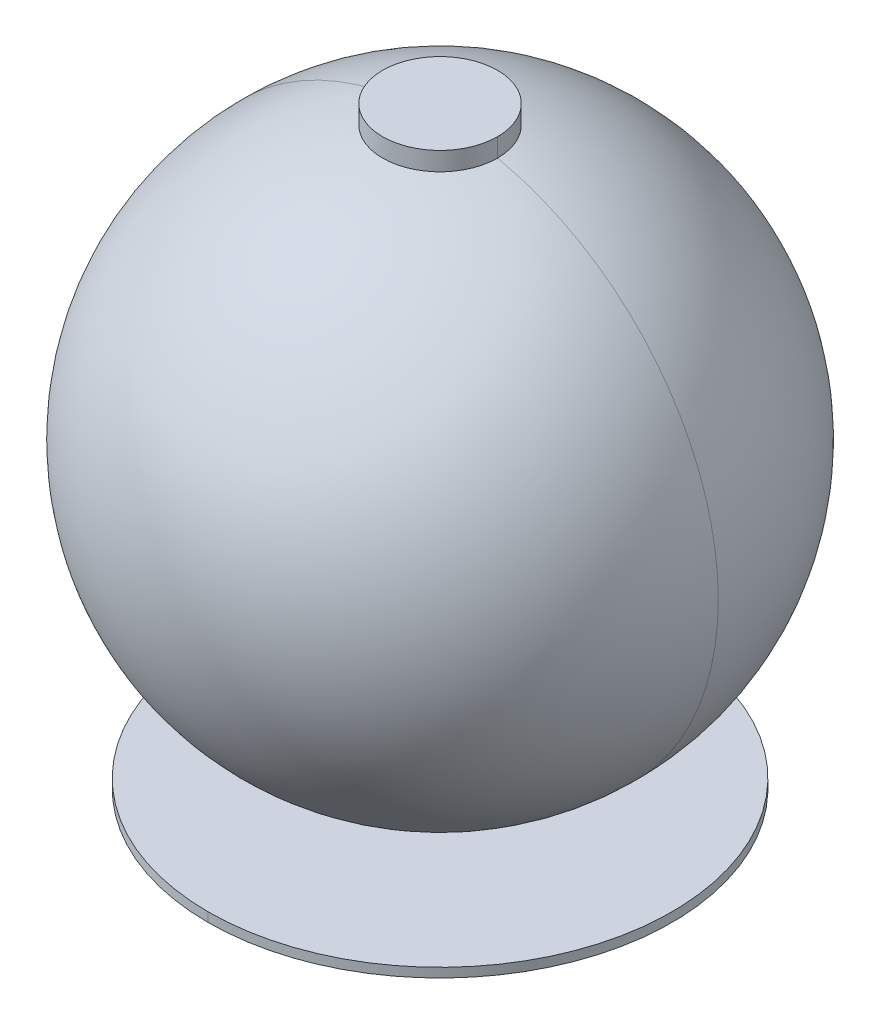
ISO-10303-21;
HEADER;
FILE_DESCRIPTION(('STEP AP214'),'2;1');
FILE_NAME('part.step','',(''),(''),'','','');
FILE_SCHEMA(('AUTOMOTIVE_DESIGN { 1 0 10303 214 1 1 1 1 }'));
ENDSEC;
DATA;
#1=APPLICATION_CONTEXT('core data for automotive mechanical design processes');
#2=APPLICATION_PROTOCOL_DEFINITION('international standard','automotive_design',2000,#1);
#3=PRODUCT_CONTEXT('',#1,'mechanical');
#4=PRODUCT('Part','Part','',(#3));
#5=PRODUCT_RELATED_PRODUCT_CATEGORY('part','',(#4));
#6=PRODUCT_DEFINITION_FORMATION('','',#4);
#7=PRODUCT_DEFINITION_CONTEXT('part definition',#1,'design');
#8=PRODUCT_DEFINITION('design','',#6,#7);
#9=PRODUCT_DEFINITION_SHAPE('','',#8);
#10=(LENGTH_UNIT() NAMED_UNIT(*) SI_UNIT(.MILLI.,.METRE.));
#11=(NAMED_UNIT(*) PLANE_ANGLE_UNIT() SI_UNIT($,.RADIAN.));
#12=(NAMED_UNIT(*) SI_UNIT($,.STERADIAN.) SOLID_ANGLE_UNIT());
#13=UNCERTAINTY_MEASURE_WITH_UNIT(LENGTH_MEASURE(1.E-05),#10,'distance_accuracy_value','');
#14=(GEOMETRIC_REPRESENTATION_CONTEXT(3) GLOBAL_UNCERTAINTY_ASSIGNED_CONTEXT((#13)) GLOBAL_UNIT_ASSIGNED_CONTEXT((#10,
#11,#12)) REPRESENTATION_CONTEXT('',''));
#15=CARTESIAN_POINT('',(0.,0.,0.));
#16=DIRECTION('',(0.,0.,1.));
#17=DIRECTION('',(1.,0.,0.));
#18=AXIS2_PLACEMENT_3D('',#15,#16,#17);
#19=CARTESIAN_POINT('',(-5.495630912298,-32.961497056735,0.));
#20=DIRECTION('',(0.,1.,0.));
#21=DIRECTION('',(1.,0.,0.));
#22=AXIS2_PLACEMENT_3D('',#19,#20,#21);
#23=PLANE('',#22);
#24=CARTESIAN_POINT('',(-5.495630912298,-32.961497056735,0.));
#25=DIRECTION('',(0.,1.,0.));
#26=DIRECTION('',(0.,0.,1.));
#27=AXIS2_PLACEMENT_3D('',#24,#25,#26);
#28=CIRCLE('',#27,125.);
#29=CARTESIAN_POINT('',(-5.495630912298,-32.961497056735,-125.));
#30=VERTEX_POINT('',#29);
#31=CARTESIAN_POINT('',(-5.49563091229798,-32.961497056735,125.));
#32=VERTEX_POINT('',#31);
#33=EDGE_CURVE('P0_E10',#30,#32,#28,.T.);
#34=ORIENTED_EDGE('',*,*,#33,.F.);
#35=CARTESIAN_POINT('',(-5.495630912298,-32.961497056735,0.));
#36=DIRECTION('',(0.,1.,0.));
#37=DIRECTION('',(0.,0.,1.));
#38=AXIS2_PLACEMENT_3D('',#35,#36,#37);
#39=CIRCLE('',#38,125.);
#40=EDGE_CURVE('P0_E19',#32,#30,#39,.T.);
#41=ORIENTED_EDGE('',*,*,#40,.F.);
#42=EDGE_LOOP('',(#34,#41));
#43=FACE_BOUND('',#42,.T.);
#44=ADVANCED_FACE('P0_F16',(#43),#23,.F.);
#45=CARTESIAN_POINT('',(-5.495630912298,-27.961497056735,0.));
#46=DIRECTION('',(0.,1.,0.));
#47=DIRECTION('',(1.,0.,0.));
#48=AXIS2_PLACEMENT_3D('',#45,#46,#47);
#49=PLANE('',#48);
#50=CARTESIAN_POINT('',(-5.495630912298,-27.961497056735,0.));
#51=DIRECTION('',(0.,1.,0.));
#52=DIRECTION('',(0.,0.,1.));
#53=AXIS2_PLACEMENT_3D('',#50,#51,#52);
#54=CIRCLE('',#53,125.);
#55=CARTESIAN_POINT('',(-5.495630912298,-27.961497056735,-125.));
#56=VERTEX_POINT('',#55);
#57=CARTESIAN_POINT('',(-5.49563091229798,-27.961497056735,125.));
#58=VERTEX_POINT('',#57);
#59=EDGE_CURVE('P0_E25',#56,#58,#54,.T.);
#60=ORIENTED_EDGE('',*,*,#59,.T.);
#61=CARTESIAN_POINT('',(-5.495630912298,-27.961497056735,0.));
#62=DIRECTION('',(0.,1.,0.));
#63=DIRECTION('',(0.,0.,1.));
#64=AXIS2_PLACEMENT_3D('',#61,#62,#63);
#65=CIRCLE('',#64,125.);
#66=EDGE_CURVE('P0_E57',#58,#56,#65,.T.);
#67=ORIENTED_EDGE('',*,*,#66,.T.);
#68=EDGE_LOOP('',(#60,#67));
#69=FACE_BOUND('',#68,.T.);
#70=ADVANCED_FACE('P0_F55',(#69),#49,.T.);
#71=CARTESIAN_POINT('',(-5.495630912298,-27.961497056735,0.));
#72=DIRECTION('',(0.,-1.,0.));
#73=DIRECTION('',(0.,0.,-1.));
#74=AXIS2_PLACEMENT_3D('',#71,#72,#73);
#75=CYLINDRICAL_SURFACE('',#74,125.);
#76=DIRECTION('',(0.,-1.,0.));
#77=VECTOR('',#76,1.);
#78=CARTESIAN_POINT('',(-5.49563091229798,-27.961497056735,125.));
#79=LINE('',#78,#77);
#80=EDGE_CURVE('P0_E63',#58,#32,#79,.T.);
#81=ORIENTED_EDGE('',*,*,#80,.F.);
#82=ORIENTED_EDGE('',*,*,#59,.F.);
#83=DIRECTION('',(0.,-1.,0.));
#84=VECTOR('',#83,1.);
#85=CARTESIAN_POINT('',(-5.495630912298,-27.961497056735,-125.));
#86=LINE('',#85,#84);
#87=EDGE_CURVE('P0_E60',#56,#30,#86,.T.);
#88=ORIENTED_EDGE('',*,*,#87,.T.);
#89=ORIENTED_EDGE('',*,*,#33,.T.);
#90=EDGE_LOOP('',(#81,#82,#88,#89));
#91=FACE_BOUND('',#90,.T.);
#92=ADVANCED_FACE('P0_F64',(#91),#75,.T.);
#93=CARTESIAN_POINT('',(-5.495630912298,-27.961497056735,0.));
#94=DIRECTION('',(0.,-1.,0.));
#95=DIRECTION('',(0.,0.,-1.));
#96=AXIS2_PLACEMENT_3D('',#93,#94,#95);
#97=CYLINDRICAL_SURFACE('',#96,125.);
#98=ORIENTED_EDGE('',*,*,#66,.F.);
#99=ORIENTED_EDGE('',*,*,#80,.T.);
#100=ORIENTED_EDGE('',*,*,#40,.T.);
#101=ORIENTED_EDGE('',*,*,#87,.F.);
#102=EDGE_LOOP('',(#98,#99,#100,#101));
#103=FACE_BOUND('',#102,.T.);
#104=ADVANCED_FACE('P0_F69',(#103),#97,.T.);
#105=CLOSED_SHELL('',(#44,#70,#92,#104));
#106=MANIFOLD_SOLID_BREP('P0_B1',#105);
#107=CARTESIAN_POINT('',(-5.495630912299,130.276791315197,0.));
#108=DIRECTION('',(0.,0.,1.));
#109=DIRECTION('',(1.,0.,0.));
#110=AXIS2_PLACEMENT_3D('',#107,#108,#109);
#111=SPHERICAL_SURFACE('',#110,150.);
#112=CARTESIAN_POINT('',(-5.495630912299,130.276791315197,0.));
#113=DIRECTION('',(0.,0.,1.));
#114=DIRECTION('',(1.,0.,0.));
#115=AXIS2_PLACEMENT_3D('',#112,#113,#114);
#116=CIRCLE('',#115,150.);
#117=CARTESIAN_POINT('',(-5.49563091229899,280.276791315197,0.));
#118=VERTEX_POINT('',#117);
#119=CARTESIAN_POINT('',(-5.49563091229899,-19.723208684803,0.));
#120=VERTEX_POINT('',#119);
#121=EDGE_CURVE('P1_E11',#118,#120,#116,.T.);
#122=ORIENTED_EDGE('',*,*,#121,.F.);
#123=CARTESIAN_POINT('',(-5.495630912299,130.276791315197,0.));
#124=DIRECTION('',(0.,0.,-1.));
#125=DIRECTION('',(-1.,0.,0.));
#126=AXIS2_PLACEMENT_3D('',#123,#124,#125);
#127=CIRCLE('',#126,150.);
#128=EDGE_CURVE('P1_E20',#118,#120,#127,.T.);
#129=ORIENTED_EDGE('',*,*,#128,.T.);
#130=EDGE_LOOP('',(#122,#129));
#131=FACE_BOUND('',#130,.T.);
#132=ADVANCED_FACE('P1_F17',(#131),#111,.T.);
#133=CARTESIAN_POINT('',(-5.495630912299,130.276791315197,0.));
#134=DIRECTION('',(0.,0.,1.));
#135=DIRECTION('',(1.,0.,0.));
#136=AXIS2_PLACEMENT_3D('',#133,#134,#135);
#137=SPHERICAL_SURFACE('',#136,150.);
#138=ORIENTED_EDGE('',*,*,#128,.F.);
#139=ORIENTED_EDGE('',*,*,#121,.T.);
#140=EDGE_LOOP('',(#138,#139));
#141=FACE_BOUND('',#140,.T.);
#142=ADVANCED_FACE('P1_F41',(#141),#137,.T.);
#143=CLOSED_SHELL('',(#132,#142));
#144=MANIFOLD_SOLID_BREP('P1_B1',#143);
#145=CARTESIAN_POINT('',(-5.49563091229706,-17.961497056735,0.));
#146=DIRECTION('',(0.,-1.,0.));
#147=DIRECTION('',(-1.,0.,0.));
#148=AXIS2_PLACEMENT_3D('',#145,#146,#147);
#149=PLANE('',#148);
#150=DIRECTION('',(0.969400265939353,0.,0.24548548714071));
#151=VECTOR('',#150,1.);
#152=CARTESIAN_POINT('',(-5.4956309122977,-17.961497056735,2.51405389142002E-12));
#153=LINE('',#152,#151);
#154=CARTESIAN_POINT('',(22.6169767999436,-17.9614970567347,7.11907912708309));
#155=VERTEX_POINT('',#154);
#156=CARTESIAN_POINT('',(23.5863770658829,-17.9614970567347,7.3645646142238));
#157=VERTEX_POINT('',#156);
#158=EDGE_CURVE('P2_E797',#155,#157,#153,.T.);
#159=ORIENTED_EDGE('',*,*,#158,.F.);
#160=CARTESIAN_POINT('',(-5.49563091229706,-17.961497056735,0.));
#161=DIRECTION('',(0.,-1.,0.));
#162=DIRECTION('',(1.,0.,0.));
#163=AXIS2_PLACEMENT_3D('',#160,#161,#162);
#164=CIRCLE('',#163,29.);
#165=CARTESIAN_POINT('',(21.1126469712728,-17.9614970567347,11.5325430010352));
#166=VERTEX_POINT('',#165);
#167=EDGE_CURVE('P2_E917',#155,#166,#164,.T.);
#168=ORIENTED_EDGE('',*,*,#167,.T.);
#169=DIRECTION('',(-0.91752682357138,0.,-0.397673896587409));
#170=VECTOR('',#169,1.);
#171=CARTESIAN_POINT('',(-5.49563091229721,-17.961497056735,3.54939136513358E-13));
#172=LINE('',#171,#170);
#173=CARTESIAN_POINT('',(22.0301737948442,-17.9614970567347,11.9302168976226));
#174=VERTEX_POINT('',#173);
#175=EDGE_CURVE('P2_E847',#174,#166,#172,.T.);
#176=ORIENTED_EDGE('',*,*,#175,.F.);
#177=CARTESIAN_POINT('',(-5.49563091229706,-17.961497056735,0.));
#178=DIRECTION('',(0.,1.,0.));
#179=DIRECTION('',(1.,0.,0.));
#180=AXIS2_PLACEMENT_3D('',#177,#178,#179);
#181=CIRCLE('',#180,30.);
#182=CARTESIAN_POINT('',(19.6193634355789,-17.9614970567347,16.4084447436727));
#183=VERTEX_POINT('',#182);
#184=EDGE_CURVE('P2_E1317',#183,#174,#181,.T.);
#185=ORIENTED_EDGE('',*,*,#184,.F.);
#186=DIRECTION('',(0.837166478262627,0.,0.546948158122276));
#187=VECTOR('',#186,1.);
#188=CARTESIAN_POINT('',(-5.49563091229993,-17.961497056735,4.38725432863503E-12));
#189=LINE('',#188,#187);
#190=CARTESIAN_POINT('',(18.7821969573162,-17.9614970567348,15.8614965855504));
#191=VERTEX_POINT('',#190);
#192=EDGE_CURVE('P2_E716',#191,#183,#189,.T.);
#193=ORIENTED_EDGE('',*,*,#192,.F.);
#194=CARTESIAN_POINT('',(-5.49563091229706,-17.961497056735,0.));
#195=DIRECTION('',(0.,-1.,0.));
#196=DIRECTION('',(1.,0.,0.));
#197=AXIS2_PLACEMENT_3D('',#194,#195,#196);
#198=CIRCLE('',#197,29.);
#199=CARTESIAN_POINT('',(15.9263264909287,-17.9614970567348,19.5473717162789));
#200=VERTEX_POINT('',#199);
#201=EDGE_CURVE('P2_E700',#191,#200,#198,.T.);
#202=ORIENTED_EDGE('',*,*,#201,.T.);
#203=DIRECTION('',(-0.738688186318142,0.,-0.674047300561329));
#204=VECTOR('',#203,1.);
#205=CARTESIAN_POINT('',(-5.49563091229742,-17.961497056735,3.98521538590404E-13));
#206=LINE('',#205,#204);
#207=CARTESIAN_POINT('',(16.6650146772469,-17.9614970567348,20.2214190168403));
#208=VERTEX_POINT('',#207);
#209=EDGE_CURVE('P2_E706',#208,#200,#206,.T.);
#210=ORIENTED_EDGE('',*,*,#209,.F.);
#211=CARTESIAN_POINT('',(-5.49563091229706,-17.961497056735,0.));
#212=DIRECTION('',(0.,1.,0.));
#213=DIRECTION('',(1.,0.,0.));
#214=AXIS2_PLACEMENT_3D('',#211,#212,#213);
#215=CIRCLE('',#214,30.);
#216=CARTESIAN_POINT('',(12.9307504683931,-17.9614970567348,23.6742152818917));
#217=VERTEX_POINT('',#216);
#218=EDGE_CURVE('P2_E1025',#217,#208,#215,.T.);
#219=ORIENTED_EDGE('',*,*,#218,.F.);
#220=DIRECTION('',(0.614212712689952,0.,0.789140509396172));
#221=VECTOR('',#220,1.);
#222=CARTESIAN_POINT('',(-5.4956309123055,-17.961497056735,6.56874099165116E-12));
#223=LINE('',#222,#221);
#224=CARTESIAN_POINT('',(12.3165377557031,-17.9614970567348,22.8850747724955));
#225=VERTEX_POINT('',#224);
#226=EDGE_CURVE('P2_E869',#225,#217,#223,.T.);
#227=ORIENTED_EDGE('',*,*,#226,.F.);
#228=CARTESIAN_POINT('',(-5.49563091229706,-17.961497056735,0.));
#229=DIRECTION('',(0.,-1.,0.));
#230=DIRECTION('',(1.,0.,0.));
#231=AXIS2_PLACEMENT_3D('',#228,#229,#230);
#232=CIRCLE('',#231,29.);
#233=CARTESIAN_POINT('',(8.41860453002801,-17.9614970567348,25.4439393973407));
#234=VERTEX_POINT('',#233);
#235=EDGE_CURVE('P2_E737',#225,#234,#232,.T.);
#236=ORIENTED_EDGE('',*,*,#235,.T.);
#237=DIRECTION('',(-0.479801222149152,0.,-0.877377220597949));
#238=VECTOR('',#237,1.);
#239=CARTESIAN_POINT('',(-5.4956309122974,-17.961497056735,1.83943260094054E-13));
#240=LINE('',#239,#238);
#241=CARTESIAN_POINT('',(8.89840575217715,-17.9614970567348,26.3213166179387));
#242=VERTEX_POINT('',#241);
#243=EDGE_CURVE('P2_E905',#242,#234,#240,.T.);
#244=ORIENTED_EDGE('',*,*,#243,.F.);
#245=CARTESIAN_POINT('',(-5.49563091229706,-17.961497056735,0.));
#246=DIRECTION('',(0.,1.,0.));
#247=DIRECTION('',(1.,0.,0.));
#248=AXIS2_PLACEMENT_3D('',#245,#246,#247);
#249=CIRCLE('',#248,30.);
#250=CARTESIAN_POINT('',(4.24535316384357,-17.9614970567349,28.374517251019));
#251=VERTEX_POINT('',#250);
#252=EDGE_CURVE('P2_E997',#251,#242,#249,.T.);
#253=ORIENTED_EDGE('',*,*,#252,.F.);
#254=DIRECTION('',(0.324699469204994,0.,0.945817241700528));
#255=VECTOR('',#254,1.);
#256=CARTESIAN_POINT('',(-5.49563091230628,-17.961497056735,3.16385271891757E-12));
#257=LINE('',#256,#255);
#258=CARTESIAN_POINT('',(3.92065369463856,-17.9614970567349,27.4287000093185));
#259=VERTEX_POINT('',#258);
#260=EDGE_CURVE('P2_E1154',#259,#251,#257,.T.);
#261=ORIENTED_EDGE('',*,*,#260,.F.);
#262=CARTESIAN_POINT('',(-5.49563091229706,-17.961497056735,0.));
#263=DIRECTION('',(0.,-1.,0.));
#264=DIRECTION('',(1.,0.,0.));
#265=AXIS2_PLACEMENT_3D('',#262,#263,#264);
#266=CIRCLE('',#265,29.);
#267=CARTESIAN_POINT('',(-0.596940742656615,-17.9614970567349,28.5832614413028));
#268=VERTEX_POINT('',#267);
#269=EDGE_CURVE('P2_E1217',#259,#268,#266,.T.);
#270=ORIENTED_EDGE('',*,*,#269,.T.);
#271=DIRECTION('',(-0.168920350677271,0.,-0.985629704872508));
#272=VECTOR('',#271,1.);
#273=CARTESIAN_POINT('',(-5.49563091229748,-17.961497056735,0.));
#274=LINE('',#273,#272);
#275=CARTESIAN_POINT('',(-0.428020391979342,-17.9614970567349,29.5688911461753));
#276=VERTEX_POINT('',#275);
#277=EDGE_CURVE('P2_E1186',#276,#268,#274,.T.);
#278=ORIENTED_EDGE('',*,*,#277,.F.);
#279=CARTESIAN_POINT('',(-5.49563091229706,-17.961497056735,0.));
#280=DIRECTION('',(0.,1.,0.));
#281=DIRECTION('',(1.,0.,0.));
#282=AXIS2_PLACEMENT_3D('',#279,#280,#281);
#283=CIRCLE('',#282,30.);
#284=CARTESIAN_POINT('',(-5.49563091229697,-17.961497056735,30.));
#285=VERTEX_POINT('',#284);
#286=EDGE_CURVE('P2_E881',#285,#276,#283,.T.);
#287=ORIENTED_EDGE('',*,*,#286,.F.);
#288=DIRECTION('',(0.,0.,1.));
#289=VECTOR('',#288,1.);
#290=CARTESIAN_POINT('',(-5.49563091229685,-17.961497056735,0.));
#291=LINE('',#290,#289);
#292=CARTESIAN_POINT('',(-5.49563091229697,-17.961497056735,29.));
#293=VERTEX_POINT('',#292);
#294=EDGE_CURVE('P2_E1002',#293,#285,#291,.T.);
#295=ORIENTED_EDGE('',*,*,#294,.F.);
#296=CARTESIAN_POINT('',(-5.49563091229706,-17.961497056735,0.));
#297=DIRECTION('',(0.,-1.,0.));
#298=DIRECTION('',(1.,0.,0.));
#299=AXIS2_PLACEMENT_3D('',#296,#297,#298);
#300=CIRCLE('',#299,29.);
#301=CARTESIAN_POINT('',(-10.1433351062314,-17.9614970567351,28.6251435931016));
#302=VERTEX_POINT('',#301);
#303=EDGE_CURVE('P2_E834',#293,#302,#300,.T.);
#304=ORIENTED_EDGE('',*,*,#303,.T.);
#305=DIRECTION('',(0.160265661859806,0.,-0.987073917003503));
#306=VECTOR('',#305,1.);
#307=CARTESIAN_POINT('',(-5.49563091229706,-17.961497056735,0.));
#308=LINE('',#307,#306);
#309=CARTESIAN_POINT('',(-10.3036007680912,-17.9614970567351,29.6122175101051));
#310=VERTEX_POINT('',#309);
#311=EDGE_CURVE('P2_E743',#310,#302,#308,.T.);
#312=ORIENTED_EDGE('',*,*,#311,.F.);
#313=CARTESIAN_POINT('',(-5.49563091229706,-17.961497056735,0.));
#314=DIRECTION('',(0.,1.,0.));
#315=DIRECTION('',(1.,0.,0.));
#316=AXIS2_PLACEMENT_3D('',#313,#314,#315);
#317=CIRCLE('',#316,30.);
#318=CARTESIAN_POINT('',(-15.2366149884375,-17.9614970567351,28.3745172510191));
#319=VERTEX_POINT('',#318);
#320=EDGE_CURVE('P2_E1202',#319,#310,#317,.T.);
#321=ORIENTED_EDGE('',*,*,#320,.F.);
#322=DIRECTION('',(-0.324699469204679,0.,0.945817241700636));
#323=VECTOR('',#322,1.);
#324=CARTESIAN_POINT('',(-5.49563091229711,-17.961497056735,0.));
#325=LINE('',#324,#323);
#326=CARTESIAN_POINT('',(-14.9119155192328,-17.9614970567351,27.4287000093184));
#327=VERTEX_POINT('',#326);
#328=EDGE_CURVE('P2_E1068',#327,#319,#325,.T.);
#329=ORIENTED_EDGE('',*,*,#328,.F.);
#330=CARTESIAN_POINT('',(-5.49563091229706,-17.961497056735,0.));
#331=DIRECTION('',(0.,-1.,0.));
#332=DIRECTION('',(1.,0.,0.));
#333=AXIS2_PLACEMENT_3D('',#330,#331,#332);
#334=CIRCLE('',#333,29.);
#335=CARTESIAN_POINT('',(-19.1860786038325,-17.9614970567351,25.5650472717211));
#336=VERTEX_POINT('',#335);
#337=EDGE_CURVE('P2_E864',#327,#336,#334,.T.);
#338=ORIENTED_EDGE('',*,*,#337,.T.);
#339=DIRECTION('',(0.472084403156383,0.,-0.881553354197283));
#340=VECTOR('',#339,1.);
#341=CARTESIAN_POINT('',(-5.49563091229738,-17.961497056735,-1.71157602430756E-13));
#342=LINE('',#341,#340);
#343=CARTESIAN_POINT('',(-19.6581630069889,-17.9614970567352,26.4466006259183));
#344=VERTEX_POINT('',#343);
#345=EDGE_CURVE('P2_E1435',#344,#336,#342,.T.);
#346=ORIENTED_EDGE('',*,*,#345,.F.);
#347=CARTESIAN_POINT('',(-5.49563091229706,-17.961497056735,0.));
#348=DIRECTION('',(0.,1.,0.));
#349=DIRECTION('',(1.,0.,0.));
#350=AXIS2_PLACEMENT_3D('',#347,#348,#349);
#351=CIRCLE('',#350,30.);
#352=CARTESIAN_POINT('',(-23.9220122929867,-17.9614970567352,23.6742152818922));
#353=VERTEX_POINT('',#352);
#354=EDGE_CURVE('P2_E966',#353,#344,#351,.T.);
#355=ORIENTED_EDGE('',*,*,#354,.F.);
#356=DIRECTION('',(-0.614212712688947,0.,0.789140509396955));
#357=VECTOR('',#356,1.);
#358=CARTESIAN_POINT('',(-5.49563091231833,-17.961497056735,-1.65555713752E-11));
#359=LINE('',#358,#357);
#360=CARTESIAN_POINT('',(-23.3077995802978,-17.9614970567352,22.8850747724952));
#361=VERTEX_POINT('',#360);
#362=EDGE_CURVE('P2_E840',#361,#353,#359,.T.);
#363=ORIENTED_EDGE('',*,*,#362,.F.);
#364=CARTESIAN_POINT('',(-5.49563091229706,-17.961497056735,0.));
#365=DIRECTION('',(0.,-1.,0.));
#366=DIRECTION('',(1.,0.,0.));
#367=AXIS2_PLACEMENT_3D('',#364,#365,#366);
#368=CIRCLE('',#367,29.);
#369=CARTESIAN_POINT('',(-26.7452496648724,-17.9614970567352,19.7345813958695));
#370=VERTEX_POINT('',#369);
#371=EDGE_CURVE('P2_E727',#361,#370,#368,.T.);
#372=ORIENTED_EDGE('',*,*,#371,.T.);
#373=DIRECTION('',(0.732745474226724,0.,-0.680502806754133));
#374=VECTOR('',#373,1.);
#375=CARTESIAN_POINT('',(-5.49563091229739,-17.961497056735,-3.60995460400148E-13));
#376=LINE('',#375,#374);
#377=CARTESIAN_POINT('',(-27.4779951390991,-17.9614970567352,20.4150842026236));
#378=VERTEX_POINT('',#377);
#379=EDGE_CURVE('P2_E757',#378,#370,#376,.T.);
#380=ORIENTED_EDGE('',*,*,#379,.F.);
#381=CARTESIAN_POINT('',(-5.49563091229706,-17.961497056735,0.));
#382=DIRECTION('',(0.,1.,0.));
#383=DIRECTION('',(1.,0.,0.));
#384=AXIS2_PLACEMENT_3D('',#381,#382,#383);
#385=CIRCLE('',#384,30.);
#386=CARTESIAN_POINT('',(-30.6106252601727,-17.9614970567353,16.4084447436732));
#387=VERTEX_POINT('',#386);
#388=EDGE_CURVE('P2_E1294',#387,#378,#385,.T.);
#389=ORIENTED_EDGE('',*,*,#388,.F.);
#390=DIRECTION('',(-0.837166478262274,0.,0.546948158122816));
#391=VECTOR('',#390,1.);
#392=CARTESIAN_POINT('',(-5.49563091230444,-17.961497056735,-1.12956187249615E-11));
#393=LINE('',#392,#391);
#394=CARTESIAN_POINT('',(-29.7734587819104,-17.9614970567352,15.8614965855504));
#395=VERTEX_POINT('',#394);
#396=EDGE_CURVE('P2_E1398',#395,#387,#393,.T.);
#397=ORIENTED_EDGE('',*,*,#396,.F.);
#398=CARTESIAN_POINT('',(-5.49563091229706,-17.961497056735,0.));
#399=DIRECTION('',(0.,-1.,0.));
#400=DIRECTION('',(1.,0.,0.));
#401=AXIS2_PLACEMENT_3D('',#398,#399,#400);
#402=CIRCLE('',#401,29.);
#403=CARTESIAN_POINT('',(-32.0016948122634,-17.9614970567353,11.7655674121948));
#404=VERTEX_POINT('',#403);
#405=EDGE_CURVE('P2_E958',#395,#404,#402,.T.);
#406=ORIENTED_EDGE('',*,*,#405,.T.);
#407=DIRECTION('',(0.914002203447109,0.,-0.405709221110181));
#408=VECTOR('',#407,1.);
#409=CARTESIAN_POINT('',(-5.49563091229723,-17.961497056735,-3.83700941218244E-13));
#410=LINE('',#409,#408);
#411=CARTESIAN_POINT('',(-32.9156970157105,-17.9614970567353,12.171276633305));
#412=VERTEX_POINT('',#411);
#413=EDGE_CURVE('P2_E1284',#412,#404,#410,.T.);
#414=ORIENTED_EDGE('',*,*,#413,.F.);
#415=CARTESIAN_POINT('',(-5.49563091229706,-17.961497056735,0.));
#416=DIRECTION('',(0.,1.,0.));
#417=DIRECTION('',(1.,0.,0.));
#418=AXIS2_PLACEMENT_3D('',#415,#416,#417);
#419=CIRCLE('',#418,30.);
#420=CARTESIAN_POINT('',(-34.5776388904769,-17.9614970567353,7.36456461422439));
#421=VERTEX_POINT('',#420);
#422=EDGE_CURVE('P2_E782',#421,#412,#419,.T.);
#423=ORIENTED_EDGE('',*,*,#422,.F.);
#424=DIRECTION('',(-0.969400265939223,0.,0.245485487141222));
#425=VECTOR('',#424,1.);
#426=CARTESIAN_POINT('',(-5.49563091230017,-17.961497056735,-1.22692556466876E-11));
#427=LINE('',#426,#425);
#428=CARTESIAN_POINT('',(-33.6082386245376,-17.9614970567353,7.11907912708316));
#429=VERTEX_POINT('',#428);
#430=EDGE_CURVE('P2_E1005',#429,#421,#427,.T.);
#431=ORIENTED_EDGE('',*,*,#430,.F.);
#432=CARTESIAN_POINT('',(-5.49563091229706,-17.961497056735,0.));
#433=DIRECTION('',(0.,-1.,0.));
#434=DIRECTION('',(1.,0.,0.));
#435=AXIS2_PLACEMENT_3D('',#432,#433,#434);
#436=CIRCLE('',#435,29.);
#437=CARTESIAN_POINT('',(-34.3857966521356,-17.9614970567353,2.52157163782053));
#438=VERTEX_POINT('',#437);
#439=EDGE_CURVE('P2_E765',#429,#438,#436,.T.);
#440=ORIENTED_EDGE('',*,*,#439,.T.);
#441=DIRECTION('',(0.996212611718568,0.,-0.0869507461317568));
#442=VECTOR('',#441,1.);
#443=CARTESIAN_POINT('',(-5.4956309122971,-17.961497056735,-4.22101469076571E-13));
#444=LINE('',#443,#442);
#445=CARTESIAN_POINT('',(-35.3820092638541,-17.9614970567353,2.60852238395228));
#446=VERTEX_POINT('',#445);
#447=EDGE_CURVE('P2_E1246',#446,#438,#444,.T.);
#448=ORIENTED_EDGE('',*,*,#447,.F.);
#449=CARTESIAN_POINT('',(-5.49563091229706,-17.961497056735,0.));
#450=DIRECTION('',(0.,1.,0.));
#451=DIRECTION('',(1.,0.,0.));
#452=AXIS2_PLACEMENT_3D('',#449,#450,#451);
#453=CIRCLE('',#452,30.);
#454=CARTESIAN_POINT('',(-35.4956309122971,-17.9614970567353,0.));
#455=VERTEX_POINT('',#454);
#456=EDGE_CURVE('P2_E1243',#455,#446,#453,.T.);
#457=ORIENTED_EDGE('',*,*,#456,.F.);
#458=CARTESIAN_POINT('',(-5.49563091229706,-17.961497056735,0.));
#459=DIRECTION('',(0.,1.,0.));
#460=DIRECTION('',(1.,0.,0.));
#461=AXIS2_PLACEMENT_3D('',#458,#459,#460);
#462=CIRCLE('',#461,30.);
#463=CARTESIAN_POINT('',(-35.3931657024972,-17.9614970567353,-2.47738036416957));
#464=VERTEX_POINT('',#463);
#465=EDGE_CURVE('P2_E1178',#464,#455,#462,.T.);
#466=ORIENTED_EDGE('',*,*,#465,.F.);
#467=DIRECTION('',(-0.996584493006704,0.,-0.0825793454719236));
#468=VECTOR('',#467,1.);
#469=CARTESIAN_POINT('',(-5.49563091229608,-17.961497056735,-1.18669052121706E-11));
#470=LINE('',#469,#468);
#471=CARTESIAN_POINT('',(-34.3965812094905,-17.9614970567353,-2.39480101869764));
#472=VERTEX_POINT('',#471);
#473=EDGE_CURVE('P2_E845',#472,#464,#470,.T.);
#474=ORIENTED_EDGE('',*,*,#473,.F.);
#475=CARTESIAN_POINT('',(-5.49563091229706,-17.961497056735,0.));
#476=DIRECTION('',(0.,-1.,0.));
#477=DIRECTION('',(1.,0.,0.));
#478=AXIS2_PLACEMENT_3D('',#475,#476,#477);
#479=CIRCLE('',#478,29.);
#480=CARTESIAN_POINT('',(-33.6392007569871,-17.9614970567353,-6.99567554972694));
#481=VERTEX_POINT('',#480);
#482=EDGE_CURVE('P2_E1190',#472,#481,#479,.T.);
#483=ORIENTED_EDGE('',*,*,#482,.T.);
#484=DIRECTION('',(0.970467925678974,0.,0.241230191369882));
#485=VECTOR('',#484,1.);
#486=CARTESIAN_POINT('',(-5.49563091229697,-17.961497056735,-3.73735555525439E-13));
#487=LINE('',#486,#485);
#488=CARTESIAN_POINT('',(-34.6096686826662,-17.9614970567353,-7.23690574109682));
#489=VERTEX_POINT('',#488);
#490=EDGE_CURVE('P2_E1165',#489,#481,#487,.T.);
#491=ORIENTED_EDGE('',*,*,#490,.F.);
#492=CARTESIAN_POINT('',(-5.49563091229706,-17.961497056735,0.));
#493=DIRECTION('',(0.,1.,0.));
#494=DIRECTION('',(1.,0.,0.));
#495=AXIS2_PLACEMENT_3D('',#492,#493,#494);
#496=CIRCLE('',#495,30.);
#497=CARTESIAN_POINT('',(-32.9688307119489,-17.9614970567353,-12.0508627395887));
#498=VERTEX_POINT('',#497);
#499=EDGE_CURVE('P2_E933',#498,#489,#496,.T.);
#500=ORIENTED_EDGE('',*,*,#499,.F.);
#501=DIRECTION('',(-0.915773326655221,0.,-0.401695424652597));
#502=VECTOR('',#501,1.);
#503=CARTESIAN_POINT('',(-5.49563091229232,-17.961497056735,-1.08121034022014E-11));
#504=LINE('',#503,#502);
#505=CARTESIAN_POINT('',(-32.0530573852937,-17.9614970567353,-11.6491673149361));
#506=VERTEX_POINT('',#505);
#507=EDGE_CURVE('P2_E895',#506,#498,#504,.T.);
#508=ORIENTED_EDGE('',*,*,#507,.F.);
#509=CARTESIAN_POINT('',(-5.49563091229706,-17.961497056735,0.));
#510=DIRECTION('',(0.,-1.,0.));
#511=DIRECTION('',(1.,0.,0.));
#512=AXIS2_PLACEMENT_3D('',#509,#510,#511);
#513=CIRCLE('',#512,29.);
#514=CARTESIAN_POINT('',(-29.8428123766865,-17.9614970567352,-15.7548327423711));
#515=VERTEX_POINT('',#514);
#516=EDGE_CURVE('P2_E813',#506,#515,#513,.T.);
#517=ORIENTED_EDGE('',*,*,#516,.T.);
#518=DIRECTION('',(0.839557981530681,0.,0.543270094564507));
#519=VECTOR('',#518,1.);
#520=CARTESIAN_POINT('',(-5.49563091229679,-17.961497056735,-4.22356272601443E-13));
#521=LINE('',#520,#519);
#522=CARTESIAN_POINT('',(-30.6823703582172,-17.9614970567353,-16.2981028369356));
#523=VERTEX_POINT('',#522);
#524=EDGE_CURVE('P2_E1132',#523,#515,#521,.T.);
#525=ORIENTED_EDGE('',*,*,#524,.F.);
#526=CARTESIAN_POINT('',(-5.49563091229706,-17.961497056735,0.));
#527=DIRECTION('',(0.,1.,0.));
#528=DIRECTION('',(1.,0.,0.));
#529=AXIS2_PLACEMENT_3D('',#526,#527,#528);
#530=CIRCLE('',#529,30.);
#531=CARTESIAN_POINT('',(-27.5673482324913,-17.9614970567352,-20.318447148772));
#532=VERTEX_POINT('',#531);
#533=EDGE_CURVE('P2_E796',#532,#523,#530,.T.);
#534=ORIENTED_EDGE('',*,*,#533,.F.);
#535=DIRECTION('',(-0.735723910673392,0.,-0.677281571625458));
#536=VECTOR('',#535,1.);
#537=CARTESIAN_POINT('',(-5.49563091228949,-17.961497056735,-8.22688502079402E-12));
#538=LINE('',#537,#536);
#539=CARTESIAN_POINT('',(-26.8316243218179,-17.9614970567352,-19.6411655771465));
#540=VERTEX_POINT('',#539);
#541=EDGE_CURVE('P2_E21',#540,#532,#538,.T.);
#542=ORIENTED_EDGE('',*,*,#541,.F.);
#543=CARTESIAN_POINT('',(-5.49563091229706,-17.961497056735,0.));
#544=DIRECTION('',(0.,-1.,0.));
#545=DIRECTION('',(1.,0.,0.));
#546=AXIS2_PLACEMENT_3D('',#543,#544,#545);
#547=CIRCLE('',#546,29.);
#548=CARTESIAN_POINT('',(-23.4080290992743,-17.9614970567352,-22.8067093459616));
#549=VERTEX_POINT('',#548);
#550=EDGE_CURVE('P2_E1033',#540,#549,#547,.T.);
#551=ORIENTED_EDGE('',*,*,#550,.T.);
#552=DIRECTION('',(0.617668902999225,0.,0.786438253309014));
#553=VECTOR('',#552,1.);
#554=CARTESIAN_POINT('',(-5.49563091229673,-17.961497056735,-2.55013369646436E-13));
#555=LINE('',#554,#553);
#556=CARTESIAN_POINT('',(-24.0256980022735,-17.9614970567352,-23.5931475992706));
#557=VERTEX_POINT('',#556);
#558=EDGE_CURVE('P2_E1123',#557,#549,#555,.T.);
#559=ORIENTED_EDGE('',*,*,#558,.F.);
#560=CARTESIAN_POINT('',(-5.49563091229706,-17.961497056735,0.));
#561=DIRECTION('',(0.,1.,0.));
#562=DIRECTION('',(1.,0.,0.));
#563=AXIS2_PLACEMENT_3D('',#560,#561,#562);
#564=CIRCLE('',#563,30.);
#565=CARTESIAN_POINT('',(-19.7740527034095,-17.9614970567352,-26.3842125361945));
#566=VERTEX_POINT('',#565);
#567=EDGE_CURVE('P2_E1212',#566,#557,#564,.T.);
#568=ORIENTED_EDGE('',*,*,#567,.F.);
#569=DIRECTION('',(-0.475947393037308,0.,-0.879473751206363));
#570=VECTOR('',#569,1.);
#571=CARTESIAN_POINT('',(-5.49563091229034,-17.961497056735,-3.63775713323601E-12));
#572=LINE('',#571,#570);
#573=CARTESIAN_POINT('',(-19.2981053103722,-17.9614970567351,-25.5047387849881));
#574=VERTEX_POINT('',#573);
#575=EDGE_CURVE('P2_E1038',#574,#566,#572,.T.);
#576=ORIENTED_EDGE('',*,*,#575,.F.);
#577=CARTESIAN_POINT('',(-5.49563091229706,-17.961497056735,0.));
#578=DIRECTION('',(0.,-1.,0.));
#579=DIRECTION('',(1.,0.,0.));
#580=AXIS2_PLACEMENT_3D('',#577,#578,#579);
#581=CIRCLE('',#580,29.);
#582=CARTESIAN_POINT('',(-15.032159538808,-17.9614970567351,-27.3871251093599));
#583=VERTEX_POINT('',#582);
#584=EDGE_CURVE('P2_E1057',#574,#583,#581,.T.);
#585=ORIENTED_EDGE('',*,*,#584,.T.);
#586=DIRECTION('',(0.328845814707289,0.,0.944383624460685));
#587=VECTOR('',#586,1.);
#588=CARTESIAN_POINT('',(-5.49563091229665,-17.961497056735,-1.41473225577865E-13));
#589=LINE('',#588,#587);
#590=CARTESIAN_POINT('',(-15.3610053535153,-17.9614970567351,-28.3315087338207));
#591=VERTEX_POINT('',#590);
#592=EDGE_CURVE('P2_E1131',#591,#583,#589,.T.);
#593=ORIENTED_EDGE('',*,*,#592,.F.);
#594=CARTESIAN_POINT('',(-5.49563091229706,-17.961497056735,0.));
#595=DIRECTION('',(0.,1.,0.));
#596=DIRECTION('',(1.,0.,0.));
#597=AXIS2_PLACEMENT_3D('',#594,#595,#596);
#598=CIRCLE('',#597,30.);
#599=CARTESIAN_POINT('',(-10.4334686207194,-17.9614970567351,-29.5908391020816));
#600=VERTEX_POINT('',#599);
#601=EDGE_CURVE('P2_E910',#600,#591,#598,.T.);
#602=ORIENTED_EDGE('',*,*,#601,.F.);
#603=DIRECTION('',(-0.164594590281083,0.,-0.986361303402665));
#604=VECTOR('',#603,1.);
#605=CARTESIAN_POINT('',(-5.4956309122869,-17.961497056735,-1.69531121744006E-12));
#606=LINE('',#605,#604);
#607=CARTESIAN_POINT('',(-10.2688740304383,-17.9614970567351,-28.6044777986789));
#608=VERTEX_POINT('',#607);
#609=EDGE_CURVE('P2_E1101',#608,#600,#606,.T.);
#610=ORIENTED_EDGE('',*,*,#609,.F.);
#611=CARTESIAN_POINT('',(-5.49563091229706,-17.961497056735,0.));
#612=DIRECTION('',(0.,1.,0.));
#613=DIRECTION('',(1.,0.,0.));
#614=AXIS2_PLACEMENT_3D('',#611,#612,#613);
#615=CIRCLE('',#614,29.);
#616=CARTESIAN_POINT('',(-5.49563091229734,-17.961497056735,-29.));
#617=VERTEX_POINT('',#616);
#618=EDGE_CURVE('P2_E1078',#617,#608,#615,.T.);
#619=ORIENTED_EDGE('',*,*,#618,.F.);
#620=DIRECTION('',(0.,0.,-1.));
#621=VECTOR('',#620,1.);
#622=CARTESIAN_POINT('',(-5.49563091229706,-17.961497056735,0.));
#623=LINE('',#622,#621);
#624=CARTESIAN_POINT('',(-5.49563091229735,-17.961497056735,-30.));
#625=VERTEX_POINT('',#624);
#626=EDGE_CURVE('P2_E1269',#617,#625,#623,.T.);
#627=ORIENTED_EDGE('',*,*,#626,.T.);
#628=CARTESIAN_POINT('',(-5.49563091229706,-17.961497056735,0.));
#629=DIRECTION('',(0.,1.,0.));
#630=DIRECTION('',(1.,0.,0.));
#631=AXIS2_PLACEMENT_3D('',#628,#629,#630);
#632=CIRCLE('',#631,30.);
#633=CARTESIAN_POINT('',(-0.557793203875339,-17.9614970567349,-29.5908391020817));
#634=VERTEX_POINT('',#633);
#635=EDGE_CURVE('P2_E770',#634,#625,#632,.T.);
#636=ORIENTED_EDGE('',*,*,#635,.F.);
#637=DIRECTION('',(0.164594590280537,0.,-0.986361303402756));
#638=VECTOR('',#637,1.);
#639=CARTESIAN_POINT('',(-5.49563091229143,-17.961497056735,9.3866705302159E-13));
#640=LINE('',#639,#638);
#641=CARTESIAN_POINT('',(-0.722387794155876,-17.9614970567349,-28.604477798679));
#642=VERTEX_POINT('',#641);
#643=EDGE_CURVE('P2_E942',#642,#634,#640,.T.);
#644=ORIENTED_EDGE('',*,*,#643,.F.);
#645=CARTESIAN_POINT('',(-5.49563091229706,-17.961497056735,0.));
#646=DIRECTION('',(0.,-1.,0.));
#647=DIRECTION('',(1.,0.,0.));
#648=AXIS2_PLACEMENT_3D('',#645,#646,#647);
#649=CIRCLE('',#648,29.);
#650=CARTESIAN_POINT('',(3.8002284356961,-17.9614970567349,-27.469746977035));
#651=VERTEX_POINT('',#650);
#652=EDGE_CURVE('P2_E928',#642,#651,#649,.T.);
#653=ORIENTED_EDGE('',*,*,#652,.T.);
#654=DIRECTION('',(-0.320546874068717,0.,0.947232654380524));
#655=VECTOR('',#654,1.);
#656=CARTESIAN_POINT('',(-5.4956309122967,-17.961497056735,1.20109000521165E-13));
#657=LINE('',#656,#655);
#658=CARTESIAN_POINT('',(4.12077530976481,-17.9614970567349,-28.4169796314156));
#659=VERTEX_POINT('',#658);
#660=EDGE_CURVE('P2_E1014',#659,#651,#657,.T.);
#661=ORIENTED_EDGE('',*,*,#660,.F.);
#662=CARTESIAN_POINT('',(-5.49563091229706,-17.961497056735,0.));
#663=DIRECTION('',(0.,1.,0.));
#664=DIRECTION('',(1.,0.,0.));
#665=AXIS2_PLACEMENT_3D('',#662,#663,#664);
#666=CIRCLE('',#665,30.);
#667=CARTESIAN_POINT('',(8.78279087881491,-17.9614970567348,-26.3842125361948));
#668=VERTEX_POINT('',#667);
#669=EDGE_CURVE('P2_E1197',#668,#659,#666,.T.);
#670=ORIENTED_EDGE('',*,*,#669,.F.);
#671=DIRECTION('',(0.475947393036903,0.,-0.879473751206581));
#672=VECTOR('',#671,1.);
#673=CARTESIAN_POINT('',(-5.4956309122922,-17.961497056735,2.63047985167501E-12));
#674=LINE('',#673,#672);
#675=CARTESIAN_POINT('',(8.30684348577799,-17.9614970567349,-25.5047387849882));
#676=VERTEX_POINT('',#675);
#677=EDGE_CURVE('P2_E725',#676,#668,#674,.T.);
#678=ORIENTED_EDGE('',*,*,#677,.F.);
#679=CARTESIAN_POINT('',(-5.49563091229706,-17.961497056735,0.));
#680=DIRECTION('',(0.,-1.,0.));
#681=DIRECTION('',(1.,0.,0.));
#682=AXIS2_PLACEMENT_3D('',#679,#680,#681);
#683=CIRCLE('',#682,29.);
#684=CARTESIAN_POINT('',(12.2159653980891,-17.9614970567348,-22.9629997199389));
#685=VERTEX_POINT('',#684);
#686=EDGE_CURVE('P2_E772',#676,#685,#683,.T.);
#687=ORIENTED_EDGE('',*,*,#686,.T.);
#688=DIRECTION('',(-0.610744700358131,0.,0.791827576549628));
#689=VECTOR('',#688,1.);
#690=CARTESIAN_POINT('',(-5.49563091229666,-17.961497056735,3.08306692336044E-13));
#691=LINE('',#690,#689);
#692=CARTESIAN_POINT('',(12.8267100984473,-17.9614970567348,-23.7548272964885));
#693=VERTEX_POINT('',#692);
#694=EDGE_CURVE('P2_E953',#693,#685,#691,.T.);
#695=ORIENTED_EDGE('',*,*,#694,.F.);
#696=CARTESIAN_POINT('',(-5.49563091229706,-17.961497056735,0.));
#697=DIRECTION('',(0.,1.,0.));
#698=DIRECTION('',(1.,0.,0.));
#699=AXIS2_PLACEMENT_3D('',#696,#697,#698);
#700=CIRCLE('',#699,30.);
#701=CARTESIAN_POINT('',(16.5760864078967,-17.9614970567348,-20.3184471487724));
#702=VERTEX_POINT('',#701);
#703=EDGE_CURVE('P2_E1088',#702,#693,#700,.T.);
#704=ORIENTED_EDGE('',*,*,#703,.F.);
#705=DIRECTION('',(0.735723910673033,0.,-0.677281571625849));
#706=VECTOR('',#705,1.);
#707=CARTESIAN_POINT('',(-5.49563091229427,-17.961497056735,3.03371171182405E-12));
#708=LINE('',#707,#706);
#709=CARTESIAN_POINT('',(15.8403624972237,-17.9614970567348,-19.6411655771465));
#710=VERTEX_POINT('',#709);
#711=EDGE_CURVE('P2_E1182',#710,#702,#708,.T.);
#712=ORIENTED_EDGE('',*,*,#711,.F.);
#713=CARTESIAN_POINT('',(-5.49563091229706,-17.961497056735,0.));
#714=DIRECTION('',(0.,-1.,0.));
#715=DIRECTION('',(1.,0.,0.));
#716=AXIS2_PLACEMENT_3D('',#713,#714,#715);
#717=CIRCLE('',#716,29.);
#718=CARTESIAN_POINT('',(18.712376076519,-17.9614970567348,-15.967855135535));
#719=VERTEX_POINT('',#718);
#720=EDGE_CURVE('P2_E807',#710,#719,#717,.T.);
#721=ORIENTED_EDGE('',*,*,#720,.T.);
#722=DIRECTION('',(-0.834758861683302,0.,0.55061569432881));
#723=VECTOR('',#722,1.);
#724=CARTESIAN_POINT('',(-5.49563091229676,-17.961497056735,4.48903496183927E-13));
#725=LINE('',#724,#723);
#726=CARTESIAN_POINT('',(19.5471349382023,-17.9614970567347,-16.5184708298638));
#727=VERTEX_POINT('',#726);
#728=EDGE_CURVE('P2_E1096',#727,#719,#725,.T.);
#729=ORIENTED_EDGE('',*,*,#728,.F.);
#730=CARTESIAN_POINT('',(-5.49563091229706,-17.961497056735,0.));
#731=DIRECTION('',(0.,1.,0.));
#732=DIRECTION('',(1.,0.,0.));
#733=AXIS2_PLACEMENT_3D('',#730,#731,#732);
#734=CIRCLE('',#733,30.);
#735=CARTESIAN_POINT('',(21.9775688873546,-17.9614970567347,-12.0508627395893));
#736=VERTEX_POINT('',#735);
#737=EDGE_CURVE('P2_E1058',#736,#727,#734,.T.);
#738=ORIENTED_EDGE('',*,*,#737,.F.);
#739=DIRECTION('',(0.915773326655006,0.,-0.401695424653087));
#740=VECTOR('',#739,1.);
#741=CARTESIAN_POINT('',(-5.4956309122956,-17.961497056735,3.31861357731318E-12));
#742=LINE('',#741,#740);
#743=CARTESIAN_POINT('',(21.0617955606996,-17.9614970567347,-11.6491673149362));
#744=VERTEX_POINT('',#743);
#745=EDGE_CURVE('P2_E1118',#744,#736,#742,.T.);
#746=ORIENTED_EDGE('',*,*,#745,.F.);
#747=CARTESIAN_POINT('',(-5.49563091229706,-17.961497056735,0.));
#748=DIRECTION('',(0.,-1.,0.));
#749=DIRECTION('',(1.,0.,0.));
#750=AXIS2_PLACEMENT_3D('',#747,#748,#749);
#751=CIRCLE('',#750,29.);
#752=CARTESIAN_POINT('',(22.5854735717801,-17.9614970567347,-7.2423456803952));
#753=VERTEX_POINT('',#752);
#754=EDGE_CURVE('P2_E901',#744,#753,#751,.T.);
#755=ORIENTED_EDGE('',*,*,#754,.T.);
#756=DIRECTION('',(-0.968313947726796,0.,0.249736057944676));
#757=VECTOR('',#756,1.);
#758=CARTESIAN_POINT('',(-5.49563091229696,-17.961497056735,4.00622029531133E-13));
#759=LINE('',#758,#757);
#760=CARTESIAN_POINT('',(23.553787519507,-17.9614970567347,-7.49208173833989));
#761=VERTEX_POINT('',#760);
#762=EDGE_CURVE('P2_E752',#761,#753,#759,.T.);
#763=ORIENTED_EDGE('',*,*,#762,.F.);
#764=CARTESIAN_POINT('',(-5.49563091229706,-17.961497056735,0.));
#765=DIRECTION('',(0.,1.,0.));
#766=DIRECTION('',(1.,0.,0.));
#767=AXIS2_PLACEMENT_3D('',#764,#765,#766);
#768=CIRCLE('',#767,30.);
#769=CARTESIAN_POINT('',(24.401903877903,-17.9614970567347,-2.47738036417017));
#770=VERTEX_POINT('',#769);
#771=EDGE_CURVE('P2_E826',#770,#761,#768,.T.);
#772=ORIENTED_EDGE('',*,*,#771,.F.);
#773=DIRECTION('',(0.996584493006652,0.,-0.0825793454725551));
#774=VECTOR('',#773,1.);
#775=CARTESIAN_POINT('',(-5.49563091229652,-17.961497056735,6.48299443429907E-12));
#776=LINE('',#775,#774);
#777=CARTESIAN_POINT('',(23.4053193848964,-17.9614970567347,-2.39480101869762));
#778=VERTEX_POINT('',#777);
#779=EDGE_CURVE('P2_E945',#778,#770,#776,.T.);
#780=ORIENTED_EDGE('',*,*,#779,.F.);
#781=CARTESIAN_POINT('',(-5.49563091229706,-17.961497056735,0.));
#782=DIRECTION('',(0.,1.,0.));
#783=DIRECTION('',(1.,0.,0.));
#784=AXIS2_PLACEMENT_3D('',#781,#782,#783);
#785=CIRCLE('',#784,29.);
#786=CARTESIAN_POINT('',(23.4155476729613,-17.9614970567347,2.26798430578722));
#787=VERTEX_POINT('',#786);
#788=EDGE_CURVE('P2_E818',#787,#778,#785,.T.);
#789=ORIENTED_EDGE('',*,*,#788,.F.);
#790=DIRECTION('',(-0.996937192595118,0.,-0.0782063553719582));
#791=VECTOR('',#790,1.);
#792=CARTESIAN_POINT('',(-5.49563091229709,-17.961497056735,4.31055530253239E-13));
#793=LINE('',#792,#791);
#794=CARTESIAN_POINT('',(24.4124848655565,-17.9614970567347,2.34619066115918));
#795=VERTEX_POINT('',#794);
#796=EDGE_CURVE('P2_E1090',#795,#787,#793,.T.);
#797=ORIENTED_EDGE('',*,*,#796,.F.);
#798=CARTESIAN_POINT('',(-5.49563091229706,-17.961497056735,0.));
#799=DIRECTION('',(0.,1.,0.));
#800=DIRECTION('',(1.,0.,0.));
#801=AXIS2_PLACEMENT_3D('',#798,#799,#800);
#802=CIRCLE('',#801,30.);
#803=EDGE_CURVE('P2_E42',#157,#795,#802,.T.);
#804=ORIENTED_EDGE('',*,*,#803,.F.);
#805=EDGE_LOOP('',(#159,#168,#176,#185,#193,#202,#210,#219,#227,#236,#244,#253,#261,#270,#278,
#287,#295,#304,#312,#321,#329,#338,#346,#355,#363,#372,#380,#389,#397,#406,#414,#423,#431,#440,
#448,#457,#466,#474,#483,#491,#500,#508,#517,#525,#534,#542,#551,#559,#568,#576,#585,#593,#602,
#610,#619,#627,#636,#644,#653,#661,#670,#678,#687,#695,#704,#712,#721,#729,#738,#746,#755,#763,
#772,#780,#789,#797,#804));
#806=FACE_BOUND('',#805,.T.);
#807=CARTESIAN_POINT('',(-5.49563091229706,-17.961497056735,0.));
#808=DIRECTION('',(0.,-1.,0.));
#809=DIRECTION('',(1.,0.,0.));
#810=AXIS2_PLACEMENT_3D('',#807,#808,#809);
#811=CIRCLE('',#810,31.);
#812=CARTESIAN_POINT('',(-36.4956309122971,-17.9614970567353,0.));
#813=VERTEX_POINT('',#812);
#814=CARTESIAN_POINT('',(25.5043690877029,-17.9614970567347,0.));
#815=VERTEX_POINT('',#814);
#816=EDGE_CURVE('P2_E11',#813,#815,#811,.T.);
#817=ORIENTED_EDGE('',*,*,#816,.F.);
#818=CARTESIAN_POINT('',(-5.49563091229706,-17.961497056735,0.));
#819=DIRECTION('',(0.,-1.,0.));
#820=DIRECTION('',(1.,0.,0.));
#821=AXIS2_PLACEMENT_3D('',#818,#819,#820);
#822=CIRCLE('',#821,31.);
#823=EDGE_CURVE('P2_E1239',#815,#813,#822,.T.);
#824=ORIENTED_EDGE('',*,*,#823,.F.);
#825=EDGE_LOOP('',(#817,#824));
#826=FACE_BOUND('',#825,.T.);
#827=ADVANCED_FACE('P2_F17',(#806,#826),#149,.F.);
#828=CARTESIAN_POINT('',(-5.49563091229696,-27.961497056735,0.));
#829=DIRECTION('',(0.,-1.,0.));
#830=DIRECTION('',(-1.,0.,0.));
#831=AXIS2_PLACEMENT_3D('',#828,#829,#830);
#832=PLANE('',#831);
#833=CARTESIAN_POINT('',(-5.49563091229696,-27.961497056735,0.));
#834=DIRECTION('',(0.,-1.,0.));
#835=DIRECTION('',(1.,0.,0.));
#836=AXIS2_PLACEMENT_3D('',#833,#834,#835);
#837=CIRCLE('',#836,31.);
#838=CARTESIAN_POINT('',(-36.4956309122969,-27.9614970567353,0.));
#839=VERTEX_POINT('',#838);
#840=CARTESIAN_POINT('',(25.504369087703,-27.9614970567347,0.));
#841=VERTEX_POINT('',#840);
#842=EDGE_CURVE('P2_E28',#839,#841,#837,.T.);
#843=ORIENTED_EDGE('',*,*,#842,.T.);
#844=CARTESIAN_POINT('',(-5.49563091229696,-27.961497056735,0.));
#845=DIRECTION('',(0.,-1.,0.));
#846=DIRECTION('',(1.,0.,0.));
#847=AXIS2_PLACEMENT_3D('',#844,#845,#846);
#848=CIRCLE('',#847,31.);
#849=EDGE_CURVE('P2_E1405',#841,#839,#848,.T.);
#850=ORIENTED_EDGE('',*,*,#849,.T.);
#851=EDGE_LOOP('',(#843,#850));
#852=FACE_BOUND('',#851,.T.);
#853=ADVANCED_FACE('P2_F2117',(#852),#832,.T.);
#854=CARTESIAN_POINT('',(-5.49563091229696,-27.961497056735,0.));
#855=DIRECTION('',(0.,1.,0.));
#856=DIRECTION('',(-1.,0.,0.));
#857=AXIS2_PLACEMENT_3D('',#854,#855,#856);
#858=CYLINDRICAL_SURFACE('',#857,31.);
#859=DIRECTION('',(0.,1.,0.));
#860=VECTOR('',#859,1.);
#861=CARTESIAN_POINT('',(25.504369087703,-27.9614970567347,0.));
#862=LINE('',#861,#860);
#863=EDGE_CURVE('P2_E1253',#841,#815,#862,.T.);
#864=ORIENTED_EDGE('',*,*,#863,.F.);
#865=ORIENTED_EDGE('',*,*,#842,.F.);
#866=DIRECTION('',(0.,1.,0.));
#867=VECTOR('',#866,1.);
#868=CARTESIAN_POINT('',(-36.4956309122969,-27.9614970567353,0.));
#869=LINE('',#868,#867);
#870=EDGE_CURVE('P2_E855',#839,#813,#869,.T.);
#871=ORIENTED_EDGE('',*,*,#870,.T.);
#872=ORIENTED_EDGE('',*,*,#816,.T.);
#873=EDGE_LOOP('',(#864,#865,#871,#872));
#874=FACE_BOUND('',#873,.T.);
#875=ADVANCED_FACE('P2_F2122',(#874),#858,.T.);
#876=CARTESIAN_POINT('',(-5.4956309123,277.038502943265,0.));
#877=DIRECTION('',(0.,1.,0.));
#878=DIRECTION('',(-1.,0.,0.));
#879=AXIS2_PLACEMENT_3D('',#876,#877,#878);
#880=PLANE('',#879);
#881=DIRECTION('',(0.969400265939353,0.,0.24548548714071));
#882=VECTOR('',#881,1.);
#883=CARTESIAN_POINT('',(-5.49563091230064,277.038502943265,2.51405389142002E-12));
#884=LINE('',#883,#882);
#885=CARTESIAN_POINT('',(22.6169767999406,277.038502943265,7.11907912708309));
#886=VERTEX_POINT('',#885);
#887=CARTESIAN_POINT('',(23.58637706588,277.038502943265,7.3645646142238));
#888=VERTEX_POINT('',#887);
#889=EDGE_CURVE('P2_E870',#886,#888,#884,.T.);
#890=ORIENTED_EDGE('',*,*,#889,.T.);
#891=CARTESIAN_POINT('',(-5.4956309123,277.038502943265,0.));
#892=DIRECTION('',(0.,1.,0.));
#893=DIRECTION('',(1.,0.,0.));
#894=AXIS2_PLACEMENT_3D('',#891,#892,#893);
#895=CIRCLE('',#894,30.);
#896=CARTESIAN_POINT('',(24.4124848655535,277.038502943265,2.34619066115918));
#897=VERTEX_POINT('',#896);
#898=EDGE_CURVE('P2_E1048',#888,#897,#895,.T.);
#899=ORIENTED_EDGE('',*,*,#898,.T.);
#900=DIRECTION('',(-0.996937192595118,0.,-0.0782063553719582));
#901=VECTOR('',#900,1.);
#902=CARTESIAN_POINT('',(-5.49563091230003,277.038502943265,4.31055530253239E-13));
#903=LINE('',#902,#901);
#904=CARTESIAN_POINT('',(23.4155476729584,277.038502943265,2.26798430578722));
#905=VERTEX_POINT('',#904);
#906=EDGE_CURVE('P2_E1281',#897,#905,#903,.T.);
#907=ORIENTED_EDGE('',*,*,#906,.T.);
#908=CARTESIAN_POINT('',(-5.4956309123,277.038502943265,0.));
#909=DIRECTION('',(0.,1.,0.));
#910=DIRECTION('',(1.,0.,0.));
#911=AXIS2_PLACEMENT_3D('',#908,#909,#910);
#912=CIRCLE('',#911,29.);
#913=CARTESIAN_POINT('',(23.4053193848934,277.038502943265,-2.39480101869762));
#914=VERTEX_POINT('',#913);
#915=EDGE_CURVE('P2_E819',#905,#914,#912,.T.);
#916=ORIENTED_EDGE('',*,*,#915,.T.);
#917=DIRECTION('',(0.996584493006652,0.,-0.0825793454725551));
#918=VECTOR('',#917,1.);
#919=CARTESIAN_POINT('',(-5.49563091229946,277.038502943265,6.48299443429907E-12));
#920=LINE('',#919,#918);
#921=CARTESIAN_POINT('',(24.4019038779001,277.038502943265,-2.47738036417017));
#922=VERTEX_POINT('',#921);
#923=EDGE_CURVE('P2_E829',#914,#922,#920,.T.);
#924=ORIENTED_EDGE('',*,*,#923,.T.);
#925=CARTESIAN_POINT('',(-5.4956309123,277.038502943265,0.));
#926=DIRECTION('',(0.,1.,0.));
#927=DIRECTION('',(1.,0.,0.));
#928=AXIS2_PLACEMENT_3D('',#925,#926,#927);
#929=CIRCLE('',#928,30.);
#930=CARTESIAN_POINT('',(23.553787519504,277.038502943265,-7.49208173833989));
#931=VERTEX_POINT('',#930);
#932=EDGE_CURVE('P2_E748',#922,#931,#929,.T.);
#933=ORIENTED_EDGE('',*,*,#932,.T.);
#934=DIRECTION('',(-0.968313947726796,0.,0.249736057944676));
#935=VECTOR('',#934,1.);
#936=CARTESIAN_POINT('',(-5.4956309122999,277.038502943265,4.00622029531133E-13));
#937=LINE('',#936,#935);
#938=CARTESIAN_POINT('',(22.5854735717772,277.038502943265,-7.24234568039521));
#939=VERTEX_POINT('',#938);
#940=EDGE_CURVE('P2_E897',#931,#939,#937,.T.);
#941=ORIENTED_EDGE('',*,*,#940,.T.);
#942=CARTESIAN_POINT('',(-5.4956309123,277.038502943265,0.));
#943=DIRECTION('',(0.,-1.,0.));
#944=DIRECTION('',(1.,0.,0.));
#945=AXIS2_PLACEMENT_3D('',#942,#943,#944);
#946=CIRCLE('',#945,29.);
#947=CARTESIAN_POINT('',(21.0617955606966,277.038502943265,-11.6491673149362));
#948=VERTEX_POINT('',#947);
#949=EDGE_CURVE('P2_E1274',#948,#939,#946,.T.);
#950=ORIENTED_EDGE('',*,*,#949,.F.);
#951=DIRECTION('',(0.915773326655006,0.,-0.401695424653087));
#952=VECTOR('',#951,1.);
#953=CARTESIAN_POINT('',(-5.49563091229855,277.038502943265,3.31861357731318E-12));
#954=LINE('',#953,#952);
#955=CARTESIAN_POINT('',(21.9775688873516,277.038502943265,-12.0508627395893));
#956=VERTEX_POINT('',#955);
#957=EDGE_CURVE('P2_E1061',#948,#956,#954,.T.);
#958=ORIENTED_EDGE('',*,*,#957,.T.);
#959=CARTESIAN_POINT('',(-5.4956309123,277.038502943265,0.));
#960=DIRECTION('',(0.,1.,0.));
#961=DIRECTION('',(1.,0.,0.));
#962=AXIS2_PLACEMENT_3D('',#959,#960,#961);
#963=CIRCLE('',#962,30.);
#964=CARTESIAN_POINT('',(19.5471349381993,277.038502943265,-16.5184708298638));
#965=VERTEX_POINT('',#964);
#966=EDGE_CURVE('P2_E1099',#956,#965,#963,.T.);
#967=ORIENTED_EDGE('',*,*,#966,.T.);
#968=DIRECTION('',(-0.834758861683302,0.,0.55061569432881));
#969=VECTOR('',#968,1.);
#970=CARTESIAN_POINT('',(-5.49563091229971,277.038502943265,4.48903496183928E-13));
#971=LINE('',#970,#969);
#972=CARTESIAN_POINT('',(18.7123760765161,277.038502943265,-15.967855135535));
#973=VERTEX_POINT('',#972);
#974=EDGE_CURVE('P2_E1298',#965,#973,#971,.T.);
#975=ORIENTED_EDGE('',*,*,#974,.T.);
#976=CARTESIAN_POINT('',(-5.4956309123,277.038502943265,0.));
#977=DIRECTION('',(0.,-1.,0.));
#978=DIRECTION('',(1.,0.,0.));
#979=AXIS2_PLACEMENT_3D('',#976,#977,#978);
#980=CIRCLE('',#979,29.);
#981=CARTESIAN_POINT('',(15.8403624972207,277.038502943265,-19.6411655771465));
#982=VERTEX_POINT('',#981);
#983=EDGE_CURVE('P2_E808',#982,#973,#980,.T.);
#984=ORIENTED_EDGE('',*,*,#983,.F.);
#985=DIRECTION('',(0.735723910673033,0.,-0.677281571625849));
#986=VECTOR('',#985,1.);
#987=CARTESIAN_POINT('',(-5.49563091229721,277.038502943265,3.03371171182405E-12));
#988=LINE('',#987,#986);
#989=CARTESIAN_POINT('',(16.5760864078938,277.038502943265,-20.3184471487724));
#990=VERTEX_POINT('',#989);
#991=EDGE_CURVE('P2_E1085',#982,#990,#988,.T.);
#992=ORIENTED_EDGE('',*,*,#991,.T.);
#993=CARTESIAN_POINT('',(-5.4956309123,277.038502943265,0.));
#994=DIRECTION('',(0.,1.,0.));
#995=DIRECTION('',(1.,0.,0.));
#996=AXIS2_PLACEMENT_3D('',#993,#994,#995);
#997=CIRCLE('',#996,30.);
#998=CARTESIAN_POINT('',(12.8267100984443,277.038502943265,-23.7548272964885));
#999=VERTEX_POINT('',#998);
#1000=EDGE_CURVE('P2_E1173',#990,#999,#997,.T.);
#1001=ORIENTED_EDGE('',*,*,#1000,.T.);
#1002=DIRECTION('',(-0.610744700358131,0.,0.791827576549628));
#1003=VECTOR('',#1002,1.);
#1004=CARTESIAN_POINT('',(-5.4956309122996,277.038502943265,3.08306692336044E-13));
#1005=LINE('',#1004,#1003);
#1006=CARTESIAN_POINT('',(12.2159653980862,277.038502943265,-22.9629997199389));
#1007=VERTEX_POINT('',#1006);
#1008=EDGE_CURVE('P2_E776',#999,#1007,#1005,.T.);
#1009=ORIENTED_EDGE('',*,*,#1008,.T.);
#1010=CARTESIAN_POINT('',(-5.4956309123,277.038502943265,0.));
#1011=DIRECTION('',(0.,-1.,0.));
#1012=DIRECTION('',(1.,0.,0.));
#1013=AXIS2_PLACEMENT_3D('',#1010,#1011,#1012);
#1014=CIRCLE('',#1013,29.);
#1015=CARTESIAN_POINT('',(8.30684348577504,277.038502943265,-25.5047387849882));
#1016=VERTEX_POINT('',#1015);
#1017=EDGE_CURVE('P2_E1326',#1016,#1007,#1014,.T.);
#1018=ORIENTED_EDGE('',*,*,#1017,.F.);
#1019=DIRECTION('',(0.475947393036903,0.,-0.879473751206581));
#1020=VECTOR('',#1019,1.);
#1021=CARTESIAN_POINT('',(-5.49563091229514,277.038502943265,2.63047985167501E-12));
#1022=LINE('',#1021,#1020);
#1023=CARTESIAN_POINT('',(8.78279087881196,277.038502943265,-26.3842125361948));
#1024=VERTEX_POINT('',#1023);
#1025=EDGE_CURVE('P2_E1193',#1016,#1024,#1022,.T.);
#1026=ORIENTED_EDGE('',*,*,#1025,.T.);
#1027=CARTESIAN_POINT('',(-5.4956309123,277.038502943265,0.));
#1028=DIRECTION('',(0.,1.,0.));
#1029=DIRECTION('',(1.,0.,0.));
#1030=AXIS2_PLACEMENT_3D('',#1027,#1028,#1029);
#1031=CIRCLE('',#1030,30.);
#1032=CARTESIAN_POINT('',(4.12077530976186,277.038502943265,-28.4169796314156));
#1033=VERTEX_POINT('',#1032);
#1034=EDGE_CURVE('P2_E1017',#1024,#1033,#1031,.T.);
#1035=ORIENTED_EDGE('',*,*,#1034,.T.);
#1036=DIRECTION('',(-0.320546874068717,0.,0.947232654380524));
#1037=VECTOR('',#1036,1.);
#1038=CARTESIAN_POINT('',(-5.49563091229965,277.038502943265,1.20109000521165E-13));
#1039=LINE('',#1038,#1037);
#1040=CARTESIAN_POINT('',(3.80022843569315,277.038502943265,-27.469746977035));
#1041=VERTEX_POINT('',#1040);
#1042=EDGE_CURVE('P2_E924',#1033,#1041,#1039,.T.);
#1043=ORIENTED_EDGE('',*,*,#1042,.T.);
#1044=CARTESIAN_POINT('',(-5.4956309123,277.038502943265,0.));
#1045=DIRECTION('',(0.,-1.,0.));
#1046=DIRECTION('',(1.,0.,0.));
#1047=AXIS2_PLACEMENT_3D('',#1044,#1045,#1046);
#1048=CIRCLE('',#1047,29.);
#1049=CARTESIAN_POINT('',(-0.722387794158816,277.038502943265,-28.604477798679));
#1050=VERTEX_POINT('',#1049);
#1051=EDGE_CURVE('P2_E1139',#1050,#1041,#1048,.T.);
#1052=ORIENTED_EDGE('',*,*,#1051,.F.);
#1053=DIRECTION('',(0.164594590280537,0.,-0.986361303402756));
#1054=VECTOR('',#1053,1.);
#1055=CARTESIAN_POINT('',(-5.49563091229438,277.038502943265,9.38667053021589E-13));
#1056=LINE('',#1055,#1054);
#1057=CARTESIAN_POINT('',(-0.557793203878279,277.038502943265,-29.5908391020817));
#1058=VERTEX_POINT('',#1057);
#1059=EDGE_CURVE('P2_E783',#1050,#1058,#1056,.T.);
#1060=ORIENTED_EDGE('',*,*,#1059,.T.);
#1061=CARTESIAN_POINT('',(-5.4956309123,277.038502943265,0.));
#1062=DIRECTION('',(0.,1.,0.));
#1063=DIRECTION('',(1.,0.,0.));
#1064=AXIS2_PLACEMENT_3D('',#1061,#1062,#1063);
#1065=CIRCLE('',#1064,30.);
#1066=CARTESIAN_POINT('',(-5.4956309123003,277.038502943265,-30.));
#1067=VERTEX_POINT('',#1066);
#1068=EDGE_CURVE('P2_E771',#1058,#1067,#1065,.T.);
#1069=ORIENTED_EDGE('',*,*,#1068,.T.);
#1070=DIRECTION('',(0.,0.,-1.));
#1071=VECTOR('',#1070,1.);
#1072=CARTESIAN_POINT('',(-5.4956309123,277.038502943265,0.));
#1073=LINE('',#1072,#1071);
#1074=CARTESIAN_POINT('',(-5.49563091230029,277.038502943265,-29.));
#1075=VERTEX_POINT('',#1074);
#1076=EDGE_CURVE('P2_E1081',#1075,#1067,#1073,.T.);
#1077=ORIENTED_EDGE('',*,*,#1076,.F.);
#1078=CARTESIAN_POINT('',(-5.4956309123,277.038502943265,0.));
#1079=DIRECTION('',(0.,1.,0.));
#1080=DIRECTION('',(1.,0.,0.));
#1081=AXIS2_PLACEMENT_3D('',#1078,#1079,#1080);
#1082=CIRCLE('',#1081,29.);
#1083=CARTESIAN_POINT('',(-10.2688740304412,277.038502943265,-28.6044777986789));
#1084=VERTEX_POINT('',#1083);
#1085=EDGE_CURVE('P2_E1104',#1075,#1084,#1082,.T.);
#1086=ORIENTED_EDGE('',*,*,#1085,.T.);
#1087=DIRECTION('',(-0.164594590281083,0.,-0.986361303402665));
#1088=VECTOR('',#1087,1.);
#1089=CARTESIAN_POINT('',(-5.49563091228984,277.038502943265,-1.69531121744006E-12));
#1090=LINE('',#1089,#1088);
#1091=CARTESIAN_POINT('',(-10.4334686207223,277.038502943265,-29.5908391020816));
#1092=VERTEX_POINT('',#1091);
#1093=EDGE_CURVE('P2_E1169',#1084,#1092,#1090,.T.);
#1094=ORIENTED_EDGE('',*,*,#1093,.T.);
#1095=CARTESIAN_POINT('',(-5.4956309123,277.038502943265,0.));
#1096=DIRECTION('',(0.,1.,0.));
#1097=DIRECTION('',(1.,0.,0.));
#1098=AXIS2_PLACEMENT_3D('',#1095,#1096,#1097);
#1099=CIRCLE('',#1098,30.);
#1100=CARTESIAN_POINT('',(-15.3610053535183,277.038502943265,-28.3315087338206));
#1101=VERTEX_POINT('',#1100);
#1102=EDGE_CURVE('P2_E911',#1092,#1101,#1099,.T.);
#1103=ORIENTED_EDGE('',*,*,#1102,.T.);
#1104=DIRECTION('',(0.328845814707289,0.,0.944383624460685));
#1105=VECTOR('',#1104,1.);
#1106=CARTESIAN_POINT('',(-5.4956309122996,277.038502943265,-1.41473225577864E-13));
#1107=LINE('',#1106,#1105);
#1108=CARTESIAN_POINT('',(-15.032159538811,277.038502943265,-27.3871251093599));
#1109=VERTEX_POINT('',#1108);
#1110=EDGE_CURVE('P2_E1053',#1101,#1109,#1107,.T.);
#1111=ORIENTED_EDGE('',*,*,#1110,.T.);
#1112=CARTESIAN_POINT('',(-5.4956309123,277.038502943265,0.));
#1113=DIRECTION('',(0.,-1.,0.));
#1114=DIRECTION('',(1.,0.,0.));
#1115=AXIS2_PLACEMENT_3D('',#1112,#1113,#1114);
#1116=CIRCLE('',#1115,29.);
#1117=CARTESIAN_POINT('',(-19.2981053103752,277.038502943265,-25.5047387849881));
#1118=VERTEX_POINT('',#1117);
#1119=EDGE_CURVE('P2_E1042',#1118,#1109,#1116,.T.);
#1120=ORIENTED_EDGE('',*,*,#1119,.F.);
#1121=DIRECTION('',(-0.475947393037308,0.,-0.879473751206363));
#1122=VECTOR('',#1121,1.);
#1123=CARTESIAN_POINT('',(-5.49563091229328,277.038502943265,-3.63775713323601E-12));
#1124=LINE('',#1123,#1122);
#1125=CARTESIAN_POINT('',(-19.7740527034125,277.038502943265,-26.3842125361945));
#1126=VERTEX_POINT('',#1125);
#1127=EDGE_CURVE('P2_E1039',#1118,#1126,#1124,.T.);
#1128=ORIENTED_EDGE('',*,*,#1127,.T.);
#1129=CARTESIAN_POINT('',(-5.4956309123,277.038502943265,0.));
#1130=DIRECTION('',(0.,1.,0.));
#1131=DIRECTION('',(1.,0.,0.));
#1132=AXIS2_PLACEMENT_3D('',#1129,#1130,#1131);
#1133=CIRCLE('',#1132,30.);
#1134=CARTESIAN_POINT('',(-24.0256980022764,277.038502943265,-23.5931475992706));
#1135=VERTEX_POINT('',#1134);
#1136=EDGE_CURVE('P2_E1119',#1126,#1135,#1133,.T.);
#1137=ORIENTED_EDGE('',*,*,#1136,.T.);
#1138=DIRECTION('',(0.617668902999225,0.,0.786438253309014));
#1139=VECTOR('',#1138,1.);
#1140=CARTESIAN_POINT('',(-5.49563091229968,277.038502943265,-2.55013369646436E-13));
#1141=LINE('',#1140,#1139);
#1142=CARTESIAN_POINT('',(-23.4080290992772,277.038502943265,-22.8067093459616));
#1143=VERTEX_POINT('',#1142);
#1144=EDGE_CURVE('P2_E1153',#1135,#1143,#1141,.T.);
#1145=ORIENTED_EDGE('',*,*,#1144,.T.);
#1146=CARTESIAN_POINT('',(-5.4956309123,277.038502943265,0.));
#1147=DIRECTION('',(0.,-1.,0.));
#1148=DIRECTION('',(1.,0.,0.));
#1149=AXIS2_PLACEMENT_3D('',#1146,#1147,#1148);
#1150=CIRCLE('',#1149,29.);
#1151=CARTESIAN_POINT('',(-26.8316243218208,277.038502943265,-19.6411655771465));
#1152=VERTEX_POINT('',#1151);
#1153=EDGE_CURVE('P2_E959',#1152,#1143,#1150,.T.);
#1154=ORIENTED_EDGE('',*,*,#1153,.F.);
#1155=DIRECTION('',(-0.735723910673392,0.,-0.677281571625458));
#1156=VECTOR('',#1155,1.);
#1157=CARTESIAN_POINT('',(-5.49563091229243,277.038502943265,-8.22688502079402E-12));
#1158=LINE('',#1157,#1156);
#1159=CARTESIAN_POINT('',(-27.5673482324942,277.038502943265,-20.318447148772));
#1160=VERTEX_POINT('',#1159);
#1161=EDGE_CURVE('P2_E792',#1152,#1160,#1158,.T.);
#1162=ORIENTED_EDGE('',*,*,#1161,.T.);
#1163=CARTESIAN_POINT('',(-5.4956309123,277.038502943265,0.));
#1164=DIRECTION('',(0.,1.,0.));
#1165=DIRECTION('',(1.,0.,0.));
#1166=AXIS2_PLACEMENT_3D('',#1163,#1164,#1165);
#1167=CIRCLE('',#1166,30.);
#1168=CARTESIAN_POINT('',(-30.6823703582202,277.038502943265,-16.2981028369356));
#1169=VERTEX_POINT('',#1168);
#1170=EDGE_CURVE('P2_E1135',#1160,#1169,#1167,.T.);
#1171=ORIENTED_EDGE('',*,*,#1170,.T.);
#1172=DIRECTION('',(0.839557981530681,0.,0.543270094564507));
#1173=VECTOR('',#1172,1.);
#1174=CARTESIAN_POINT('',(-5.49563091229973,277.038502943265,-4.22356272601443E-13));
#1175=LINE('',#1174,#1173);
#1176=CARTESIAN_POINT('',(-29.8428123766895,277.038502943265,-15.7548327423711));
#1177=VERTEX_POINT('',#1176);
#1178=EDGE_CURVE('P2_E809',#1169,#1177,#1175,.T.);
#1179=ORIENTED_EDGE('',*,*,#1178,.T.);
#1180=CARTESIAN_POINT('',(-5.4956309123,277.038502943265,0.));
#1181=DIRECTION('',(0.,-1.,0.));
#1182=DIRECTION('',(1.,0.,0.));
#1183=AXIS2_PLACEMENT_3D('',#1180,#1181,#1182);
#1184=CIRCLE('',#1183,29.);
#1185=CARTESIAN_POINT('',(-32.0530573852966,277.038502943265,-11.6491673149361));
#1186=VERTEX_POINT('',#1185);
#1187=EDGE_CURVE('P2_E1203',#1186,#1177,#1184,.T.);
#1188=ORIENTED_EDGE('',*,*,#1187,.F.);
#1189=DIRECTION('',(-0.915773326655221,0.,-0.401695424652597));
#1190=VECTOR('',#1189,1.);
#1191=CARTESIAN_POINT('',(-5.49563091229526,277.038502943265,-1.08121034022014E-11));
#1192=LINE('',#1191,#1190);
#1193=CARTESIAN_POINT('',(-32.9688307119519,277.038502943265,-12.0508627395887));
#1194=VERTEX_POINT('',#1193);
#1195=EDGE_CURVE('P2_E896',#1186,#1194,#1192,.T.);
#1196=ORIENTED_EDGE('',*,*,#1195,.T.);
#1197=CARTESIAN_POINT('',(-5.4956309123,277.038502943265,0.));
#1198=DIRECTION('',(0.,1.,0.));
#1199=DIRECTION('',(1.,0.,0.));
#1200=AXIS2_PLACEMENT_3D('',#1197,#1198,#1199);
#1201=CIRCLE('',#1200,30.);
#1202=CARTESIAN_POINT('',(-34.6096686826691,277.038502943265,-7.23690574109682));
#1203=VERTEX_POINT('',#1202);
#1204=EDGE_CURVE('P2_E934',#1194,#1203,#1201,.T.);
#1205=ORIENTED_EDGE('',*,*,#1204,.T.);
#1206=DIRECTION('',(0.970467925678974,0.,0.241230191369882));
#1207=VECTOR('',#1206,1.);
#1208=CARTESIAN_POINT('',(-5.49563091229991,277.038502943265,-3.73735555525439E-13));
#1209=LINE('',#1208,#1207);
#1210=CARTESIAN_POINT('',(-33.6392007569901,277.038502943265,-6.99567554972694));
#1211=VERTEX_POINT('',#1210);
#1212=EDGE_CURVE('P2_E1166',#1203,#1211,#1209,.T.);
#1213=ORIENTED_EDGE('',*,*,#1212,.T.);
#1214=CARTESIAN_POINT('',(-5.4956309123,277.038502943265,0.));
#1215=DIRECTION('',(0.,-1.,0.));
#1216=DIRECTION('',(1.,0.,0.));
#1217=AXIS2_PLACEMENT_3D('',#1214,#1215,#1216);
#1218=CIRCLE('',#1217,29.);
#1219=CARTESIAN_POINT('',(-34.3965812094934,277.038502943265,-2.39480101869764));
#1220=VERTEX_POINT('',#1219);
#1221=EDGE_CURVE('P2_E886',#1220,#1211,#1218,.T.);
#1222=ORIENTED_EDGE('',*,*,#1221,.F.);
#1223=DIRECTION('',(-0.996584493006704,0.,-0.0825793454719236));
#1224=VECTOR('',#1223,1.);
#1225=CARTESIAN_POINT('',(-5.49563091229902,277.038502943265,-1.18669052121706E-11));
#1226=LINE('',#1225,#1224);
#1227=CARTESIAN_POINT('',(-35.3931657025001,277.038502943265,-2.47738036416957));
#1228=VERTEX_POINT('',#1227);
#1229=EDGE_CURVE('P2_E846',#1220,#1228,#1226,.T.);
#1230=ORIENTED_EDGE('',*,*,#1229,.T.);
#1231=CARTESIAN_POINT('',(-5.4956309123,277.038502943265,0.));
#1232=DIRECTION('',(0.,1.,0.));
#1233=DIRECTION('',(1.,0.,0.));
#1234=AXIS2_PLACEMENT_3D('',#1231,#1232,#1233);
#1235=CIRCLE('',#1234,30.);
#1236=CARTESIAN_POINT('',(-35.4956309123,277.038502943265,0.));
#1237=VERTEX_POINT('',#1236);
#1238=EDGE_CURVE('P2_E880',#1228,#1237,#1235,.T.);
#1239=ORIENTED_EDGE('',*,*,#1238,.T.);
#1240=CARTESIAN_POINT('',(-5.4956309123,277.038502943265,0.));
#1241=DIRECTION('',(0.,1.,0.));
#1242=DIRECTION('',(1.,0.,0.));
#1243=AXIS2_PLACEMENT_3D('',#1240,#1241,#1242);
#1244=CIRCLE('',#1243,30.);
#1245=CARTESIAN_POINT('',(-35.3820092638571,277.038502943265,2.60852238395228));
#1246=VERTEX_POINT('',#1245);
#1247=EDGE_CURVE('P2_E876',#1237,#1246,#1244,.T.);
#1248=ORIENTED_EDGE('',*,*,#1247,.T.);
#1249=DIRECTION('',(0.996212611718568,0.,-0.0869507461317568));
#1250=VECTOR('',#1249,1.);
#1251=CARTESIAN_POINT('',(-5.49563091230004,277.038502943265,-4.22101469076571E-13));
#1252=LINE('',#1251,#1250);
#1253=CARTESIAN_POINT('',(-34.3857966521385,277.038502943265,2.52157163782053));
#1254=VERTEX_POINT('',#1253);
#1255=EDGE_CURVE('P2_E761',#1246,#1254,#1252,.T.);
#1256=ORIENTED_EDGE('',*,*,#1255,.T.);
#1257=CARTESIAN_POINT('',(-5.4956309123,277.038502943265,0.));
#1258=DIRECTION('',(0.,-1.,0.));
#1259=DIRECTION('',(1.,0.,0.));
#1260=AXIS2_PLACEMENT_3D('',#1257,#1258,#1259);
#1261=CIRCLE('',#1260,29.);
#1262=CARTESIAN_POINT('',(-33.6082386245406,277.038502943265,7.11907912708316));
#1263=VERTEX_POINT('',#1262);
#1264=EDGE_CURVE('P2_E791',#1263,#1254,#1261,.T.);
#1265=ORIENTED_EDGE('',*,*,#1264,.F.);
#1266=DIRECTION('',(-0.969400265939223,0.,0.245485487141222));
#1267=VECTOR('',#1266,1.);
#1268=CARTESIAN_POINT('',(-5.49563091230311,277.038502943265,-1.22692556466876E-11));
#1269=LINE('',#1268,#1267);
#1270=CARTESIAN_POINT('',(-34.5776388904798,277.038502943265,7.36456461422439));
#1271=VERTEX_POINT('',#1270);
#1272=EDGE_CURVE('P2_E778',#1263,#1271,#1269,.T.);
#1273=ORIENTED_EDGE('',*,*,#1272,.T.);
#1274=CARTESIAN_POINT('',(-5.4956309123,277.038502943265,0.));
#1275=DIRECTION('',(0.,1.,0.));
#1276=DIRECTION('',(1.,0.,0.));
#1277=AXIS2_PLACEMENT_3D('',#1274,#1275,#1276);
#1278=CIRCLE('',#1277,30.);
#1279=CARTESIAN_POINT('',(-32.9156970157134,277.038502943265,12.171276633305));
#1280=VERTEX_POINT('',#1279);
#1281=EDGE_CURVE('P2_E1501',#1271,#1280,#1278,.T.);
#1282=ORIENTED_EDGE('',*,*,#1281,.T.);
#1283=DIRECTION('',(0.914002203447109,0.,-0.405709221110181));
#1284=VECTOR('',#1283,1.);
#1285=CARTESIAN_POINT('',(-5.49563091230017,277.038502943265,-3.83700941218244E-13));
#1286=LINE('',#1285,#1284);
#1287=CARTESIAN_POINT('',(-32.0016948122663,277.038502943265,11.7655674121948));
#1288=VERTEX_POINT('',#1287);
#1289=EDGE_CURVE('P2_E954',#1280,#1288,#1286,.T.);
#1290=ORIENTED_EDGE('',*,*,#1289,.T.);
#1291=CARTESIAN_POINT('',(-5.4956309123,277.038502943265,0.));
#1292=DIRECTION('',(0.,-1.,0.));
#1293=DIRECTION('',(1.,0.,0.));
#1294=AXIS2_PLACEMENT_3D('',#1291,#1292,#1293);
#1295=CIRCLE('',#1294,29.);
#1296=CARTESIAN_POINT('',(-29.7734587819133,277.038502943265,15.8614965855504));
#1297=VERTEX_POINT('',#1296);
#1298=EDGE_CURVE('P2_E989',#1297,#1288,#1295,.T.);
#1299=ORIENTED_EDGE('',*,*,#1298,.F.);
#1300=DIRECTION('',(-0.837166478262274,0.,0.546948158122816));
#1301=VECTOR('',#1300,1.);
#1302=CARTESIAN_POINT('',(-5.49563091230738,277.038502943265,-1.12956187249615E-11));
#1303=LINE('',#1302,#1301);
#1304=CARTESIAN_POINT('',(-30.6106252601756,277.038502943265,16.4084447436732));
#1305=VERTEX_POINT('',#1304);
#1306=EDGE_CURVE('P2_E1542',#1297,#1305,#1303,.T.);
#1307=ORIENTED_EDGE('',*,*,#1306,.T.);
#1308=CARTESIAN_POINT('',(-5.4956309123,277.038502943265,0.));
#1309=DIRECTION('',(0.,1.,0.));
#1310=DIRECTION('',(1.,0.,0.));
#1311=AXIS2_PLACEMENT_3D('',#1308,#1309,#1310);
#1312=CIRCLE('',#1311,30.);
#1313=CARTESIAN_POINT('',(-27.477995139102,277.038502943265,20.4150842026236));
#1314=VERTEX_POINT('',#1313);
#1315=EDGE_CURVE('P2_E753',#1305,#1314,#1312,.T.);
#1316=ORIENTED_EDGE('',*,*,#1315,.T.);
#1317=DIRECTION('',(0.732745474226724,0.,-0.680502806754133));
#1318=VECTOR('',#1317,1.);
#1319=CARTESIAN_POINT('',(-5.49563091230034,277.038502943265,-3.60995460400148E-13));
#1320=LINE('',#1319,#1318);
#1321=CARTESIAN_POINT('',(-26.7452496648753,277.038502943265,19.7345813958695));
#1322=VERTEX_POINT('',#1321);
#1323=EDGE_CURVE('P2_E731',#1314,#1322,#1320,.T.);
#1324=ORIENTED_EDGE('',*,*,#1323,.T.);
#1325=CARTESIAN_POINT('',(-5.4956309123,277.038502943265,0.));
#1326=DIRECTION('',(0.,-1.,0.));
#1327=DIRECTION('',(1.,0.,0.));
#1328=AXIS2_PLACEMENT_3D('',#1325,#1326,#1327);
#1329=CIRCLE('',#1328,29.);
#1330=CARTESIAN_POINT('',(-23.3077995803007,277.038502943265,22.8850747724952));
#1331=VERTEX_POINT('',#1330);
#1332=EDGE_CURVE('P2_E836',#1331,#1322,#1329,.T.);
#1333=ORIENTED_EDGE('',*,*,#1332,.F.);
#1334=DIRECTION('',(-0.614212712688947,0.,0.789140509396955));
#1335=VECTOR('',#1334,1.);
#1336=CARTESIAN_POINT('',(-5.49563091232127,277.038502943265,-1.65555713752E-11));
#1337=LINE('',#1336,#1335);
#1338=CARTESIAN_POINT('',(-23.9220122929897,277.038502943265,23.6742152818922));
#1339=VERTEX_POINT('',#1338);
#1340=EDGE_CURVE('P2_E963',#1331,#1339,#1337,.T.);
#1341=ORIENTED_EDGE('',*,*,#1340,.T.);
#1342=CARTESIAN_POINT('',(-5.4956309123,277.038502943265,0.));
#1343=DIRECTION('',(0.,1.,0.));
#1344=DIRECTION('',(1.,0.,0.));
#1345=AXIS2_PLACEMENT_3D('',#1342,#1343,#1344);
#1346=CIRCLE('',#1345,30.);
#1347=CARTESIAN_POINT('',(-19.6581630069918,277.038502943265,26.4466006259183));
#1348=VERTEX_POINT('',#1347);
#1349=EDGE_CURVE('P2_E985',#1339,#1348,#1346,.T.);
#1350=ORIENTED_EDGE('',*,*,#1349,.T.);
#1351=DIRECTION('',(0.472084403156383,0.,-0.881553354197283));
#1352=VECTOR('',#1351,1.);
#1353=CARTESIAN_POINT('',(-5.49563091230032,277.038502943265,-1.71157602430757E-13));
#1354=LINE('',#1353,#1352);
#1355=CARTESIAN_POINT('',(-19.1860786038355,277.038502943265,25.5650472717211));
#1356=VERTEX_POINT('',#1355);
#1357=EDGE_CURVE('P2_E1026',#1348,#1356,#1354,.T.);
#1358=ORIENTED_EDGE('',*,*,#1357,.T.);
#1359=CARTESIAN_POINT('',(-5.4956309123,277.038502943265,0.));
#1360=DIRECTION('',(0.,-1.,0.));
#1361=DIRECTION('',(1.,0.,0.));
#1362=AXIS2_PLACEMENT_3D('',#1359,#1360,#1361);
#1363=CIRCLE('',#1362,29.);
#1364=CARTESIAN_POINT('',(-14.9119155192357,277.038502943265,27.4287000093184));
#1365=VERTEX_POINT('',#1364);
#1366=EDGE_CURVE('P2_E865',#1365,#1356,#1363,.T.);
#1367=ORIENTED_EDGE('',*,*,#1366,.F.);
#1368=DIRECTION('',(-0.324699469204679,0.,0.945817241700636));
#1369=VECTOR('',#1368,1.);
#1370=CARTESIAN_POINT('',(-5.49563091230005,277.038502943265,0.));
#1371=LINE('',#1370,#1369);
#1372=CARTESIAN_POINT('',(-15.2366149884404,277.038502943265,28.3745172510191));
#1373=VERTEX_POINT('',#1372);
#1374=EDGE_CURVE('P2_E1225',#1365,#1373,#1371,.T.);
#1375=ORIENTED_EDGE('',*,*,#1374,.T.);
#1376=CARTESIAN_POINT('',(-5.4956309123,277.038502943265,0.));
#1377=DIRECTION('',(0.,1.,0.));
#1378=DIRECTION('',(1.,0.,0.));
#1379=AXIS2_PLACEMENT_3D('',#1376,#1377,#1378);
#1380=CIRCLE('',#1379,30.);
#1381=CARTESIAN_POINT('',(-10.3036007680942,277.038502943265,29.6122175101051));
#1382=VERTEX_POINT('',#1381);
#1383=EDGE_CURVE('P2_E746',#1373,#1382,#1380,.T.);
#1384=ORIENTED_EDGE('',*,*,#1383,.T.);
#1385=DIRECTION('',(0.160265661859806,0.,-0.987073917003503));
#1386=VECTOR('',#1385,1.);
#1387=CARTESIAN_POINT('',(-5.4956309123,277.038502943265,0.));
#1388=LINE('',#1387,#1386);
#1389=CARTESIAN_POINT('',(-10.1433351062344,277.038502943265,28.6251435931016));
#1390=VERTEX_POINT('',#1389);
#1391=EDGE_CURVE('P2_E918',#1382,#1390,#1388,.T.);
#1392=ORIENTED_EDGE('',*,*,#1391,.T.);
#1393=CARTESIAN_POINT('',(-5.4956309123,277.038502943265,0.));
#1394=DIRECTION('',(0.,-1.,0.));
#1395=DIRECTION('',(1.,0.,0.));
#1396=AXIS2_PLACEMENT_3D('',#1393,#1394,#1395);
#1397=CIRCLE('',#1396,29.);
#1398=CARTESIAN_POINT('',(-5.49563091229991,277.038502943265,29.));
#1399=VERTEX_POINT('',#1398);
#1400=EDGE_CURVE('P2_E835',#1399,#1390,#1397,.T.);
#1401=ORIENTED_EDGE('',*,*,#1400,.F.);
#1402=DIRECTION('',(0.,0.,1.));
#1403=VECTOR('',#1402,1.);
#1404=CARTESIAN_POINT('',(-5.49563091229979,277.038502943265,0.));
#1405=LINE('',#1404,#1403);
#1406=CARTESIAN_POINT('',(-5.49563091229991,277.038502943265,30.));
#1407=VERTEX_POINT('',#1406);
#1408=EDGE_CURVE('P2_E884',#1399,#1407,#1405,.T.);
#1409=ORIENTED_EDGE('',*,*,#1408,.T.);
#1410=CARTESIAN_POINT('',(-5.4956309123,277.038502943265,0.));
#1411=DIRECTION('',(0.,1.,0.));
#1412=DIRECTION('',(1.,0.,0.));
#1413=AXIS2_PLACEMENT_3D('',#1410,#1411,#1412);
#1414=CIRCLE('',#1413,30.);
#1415=CARTESIAN_POINT('',(-0.428020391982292,277.038502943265,29.5688911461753));
#1416=VERTEX_POINT('',#1415);
#1417=EDGE_CURVE('P2_E1183',#1407,#1416,#1414,.T.);
#1418=ORIENTED_EDGE('',*,*,#1417,.T.);
#1419=DIRECTION('',(-0.168920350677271,0.,-0.985629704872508));
#1420=VECTOR('',#1419,1.);
#1421=CARTESIAN_POINT('',(-5.49563091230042,277.038502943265,0.));
#1422=LINE('',#1421,#1420);
#1423=CARTESIAN_POINT('',(-0.596940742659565,277.038502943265,28.5832614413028));
#1424=VERTEX_POINT('',#1423);
#1425=EDGE_CURVE('P2_E1303',#1416,#1424,#1422,.T.);
#1426=ORIENTED_EDGE('',*,*,#1425,.T.);
#1427=CARTESIAN_POINT('',(-5.4956309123,277.038502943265,0.));
#1428=DIRECTION('',(0.,-1.,0.));
#1429=DIRECTION('',(1.,0.,0.));
#1430=AXIS2_PLACEMENT_3D('',#1427,#1428,#1429);
#1431=CIRCLE('',#1430,29.);
#1432=CARTESIAN_POINT('',(3.92065369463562,277.038502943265,27.4287000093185));
#1433=VERTEX_POINT('',#1432);
#1434=EDGE_CURVE('P2_E1157',#1433,#1424,#1431,.T.);
#1435=ORIENTED_EDGE('',*,*,#1434,.F.);
#1436=DIRECTION('',(0.324699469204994,0.,0.945817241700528));
#1437=VECTOR('',#1436,1.);
#1438=CARTESIAN_POINT('',(-5.49563091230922,277.038502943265,3.16385271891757E-12));
#1439=LINE('',#1438,#1437);
#1440=CARTESIAN_POINT('',(4.24535316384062,277.038502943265,28.374517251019));
#1441=VERTEX_POINT('',#1440);
#1442=EDGE_CURVE('P2_E1074',#1433,#1441,#1439,.T.);
#1443=ORIENTED_EDGE('',*,*,#1442,.T.);
#1444=CARTESIAN_POINT('',(-5.4956309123,277.038502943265,0.));
#1445=DIRECTION('',(0.,1.,0.));
#1446=DIRECTION('',(1.,0.,0.));
#1447=AXIS2_PLACEMENT_3D('',#1444,#1445,#1446);
#1448=CIRCLE('',#1447,30.);
#1449=CARTESIAN_POINT('',(8.8984057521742,277.038502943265,26.3213166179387));
#1450=VERTEX_POINT('',#1449);
#1451=EDGE_CURVE('P2_E998',#1441,#1450,#1448,.T.);
#1452=ORIENTED_EDGE('',*,*,#1451,.T.);
#1453=DIRECTION('',(-0.479801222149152,0.,-0.877377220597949));
#1454=VECTOR('',#1453,1.);
#1455=CARTESIAN_POINT('',(-5.49563091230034,277.038502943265,1.83943260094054E-13));
#1456=LINE('',#1455,#1454);
#1457=CARTESIAN_POINT('',(8.41860453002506,277.038502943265,25.4439393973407));
#1458=VERTEX_POINT('',#1457);
#1459=EDGE_CURVE('P2_E739',#1450,#1458,#1456,.T.);
#1460=ORIENTED_EDGE('',*,*,#1459,.T.);
#1461=CARTESIAN_POINT('',(-5.4956309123,277.038502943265,0.));
#1462=DIRECTION('',(0.,-1.,0.));
#1463=DIRECTION('',(1.,0.,0.));
#1464=AXIS2_PLACEMENT_3D('',#1461,#1462,#1463);
#1465=CIRCLE('',#1464,29.);
#1466=CARTESIAN_POINT('',(12.3165377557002,277.038502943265,22.8850747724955));
#1467=VERTEX_POINT('',#1466);
#1468=EDGE_CURVE('P2_E738',#1467,#1458,#1465,.T.);
#1469=ORIENTED_EDGE('',*,*,#1468,.F.);
#1470=DIRECTION('',(0.614212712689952,0.,0.789140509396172));
#1471=VECTOR('',#1470,1.);
#1472=CARTESIAN_POINT('',(-5.49563091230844,277.038502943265,6.56874099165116E-12));
#1473=LINE('',#1472,#1471);
#1474=CARTESIAN_POINT('',(12.9307504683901,277.038502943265,23.6742152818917));
#1475=VERTEX_POINT('',#1474);
#1476=EDGE_CURVE('P2_E1147',#1467,#1475,#1473,.T.);
#1477=ORIENTED_EDGE('',*,*,#1476,.T.);
#1478=CARTESIAN_POINT('',(-5.4956309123,277.038502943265,0.));
#1479=DIRECTION('',(0.,1.,0.));
#1480=DIRECTION('',(1.,0.,0.));
#1481=AXIS2_PLACEMENT_3D('',#1478,#1479,#1480);
#1482=CIRCLE('',#1481,30.);
#1483=CARTESIAN_POINT('',(16.6650146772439,277.038502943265,20.2214190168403));
#1484=VERTEX_POINT('',#1483);
#1485=EDGE_CURVE('P2_E694',#1475,#1484,#1482,.T.);
#1486=ORIENTED_EDGE('',*,*,#1485,.T.);
#1487=DIRECTION('',(-0.738688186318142,0.,-0.674047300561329));
#1488=VECTOR('',#1487,1.);
#1489=CARTESIAN_POINT('',(-5.49563091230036,277.038502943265,3.98521538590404E-13));
#1490=LINE('',#1489,#1488);
#1491=CARTESIAN_POINT('',(15.9263264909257,277.038502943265,19.5473717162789));
#1492=VERTEX_POINT('',#1491);
#1493=EDGE_CURVE('P2_E685',#1484,#1492,#1490,.T.);
#1494=ORIENTED_EDGE('',*,*,#1493,.T.);
#1495=CARTESIAN_POINT('',(-5.4956309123,277.038502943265,0.));
#1496=DIRECTION('',(0.,-1.,0.));
#1497=DIRECTION('',(1.,0.,0.));
#1498=AXIS2_PLACEMENT_3D('',#1495,#1496,#1497);
#1499=CIRCLE('',#1498,29.);
#1500=CARTESIAN_POINT('',(18.7821969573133,277.038502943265,15.8614965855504));
#1501=VERTEX_POINT('',#1500);
#1502=EDGE_CURVE('P2_E691',#1501,#1492,#1499,.T.);
#1503=ORIENTED_EDGE('',*,*,#1502,.F.);
#1504=DIRECTION('',(0.837166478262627,0.,0.546948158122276));
#1505=VECTOR('',#1504,1.);
#1506=CARTESIAN_POINT('',(-5.49563091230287,277.038502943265,4.38725432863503E-12));
#1507=LINE('',#1506,#1505);
#1508=CARTESIAN_POINT('',(19.6193634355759,277.038502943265,16.4084447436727));
#1509=VERTEX_POINT('',#1508);
#1510=EDGE_CURVE('P2_E1065',#1501,#1509,#1507,.T.);
#1511=ORIENTED_EDGE('',*,*,#1510,.T.);
#1512=CARTESIAN_POINT('',(-5.4956309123,277.038502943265,0.));
#1513=DIRECTION('',(0.,1.,0.));
#1514=DIRECTION('',(1.,0.,0.));
#1515=AXIS2_PLACEMENT_3D('',#1512,#1513,#1514);
#1516=CIRCLE('',#1515,30.);
#1517=CARTESIAN_POINT('',(22.0301737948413,277.038502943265,11.9302168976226));
#1518=VERTEX_POINT('',#1517);
#1519=EDGE_CURVE('P2_E850',#1509,#1518,#1516,.T.);
#1520=ORIENTED_EDGE('',*,*,#1519,.T.);
#1521=DIRECTION('',(-0.91752682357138,0.,-0.397673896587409));
#1522=VECTOR('',#1521,1.);
#1523=CARTESIAN_POINT('',(-5.49563091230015,277.038502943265,3.54939136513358E-13));
#1524=LINE('',#1523,#1522);
#1525=CARTESIAN_POINT('',(21.1126469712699,277.038502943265,11.5325430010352));
#1526=VERTEX_POINT('',#1525);
#1527=EDGE_CURVE('P2_E914',#1518,#1526,#1524,.T.);
#1528=ORIENTED_EDGE('',*,*,#1527,.T.);
#1529=CARTESIAN_POINT('',(-5.4956309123,277.038502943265,0.));
#1530=DIRECTION('',(0.,-1.,0.));
#1531=DIRECTION('',(1.,0.,0.));
#1532=AXIS2_PLACEMENT_3D('',#1529,#1530,#1531);
#1533=CIRCLE('',#1532,29.);
#1534=EDGE_CURVE('P2_E938',#886,#1526,#1533,.T.);
#1535=ORIENTED_EDGE('',*,*,#1534,.F.);
#1536=EDGE_LOOP('',(#890,#899,#907,#916,#924,#933,#941,#950,#958,#967,#975,#984,#992,#1001,
#1009,#1018,#1026,#1035,#1043,#1052,#1060,#1069,#1077,#1086,#1094,#1103,#1111,#1120,#1128,#1137,
#1145,#1154,#1162,#1171,#1179,#1188,#1196,#1205,#1213,#1222,#1230,#1239,#1248,#1256,#1265,#1273,
#1282,#1290,#1299,#1307,#1316,#1324,#1333,#1341,#1350,#1358,#1367,#1375,#1384,#1392,#1401,#1409,
#1418,#1426,#1435,#1443,#1452,#1460,#1469,#1477,#1486,#1494,#1503,#1511,#1520,#1528,#1535));
#1537=FACE_BOUND('',#1536,.T.);
#1538=CARTESIAN_POINT('',(-5.4956309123,277.038502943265,0.));
#1539=DIRECTION('',(0.,1.,0.));
#1540=DIRECTION('',(-1.,0.,0.));
#1541=AXIS2_PLACEMENT_3D('',#1538,#1539,#1540);
#1542=CIRCLE('',#1541,31.);
#1543=CARTESIAN_POINT('',(25.5043690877,277.038502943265,0.));
#1544=VERTEX_POINT('',#1543);
#1545=CARTESIAN_POINT('',(-36.4956309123,277.038502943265,0.));
#1546=VERTEX_POINT('',#1545);
#1547=EDGE_CURVE('P2_E760',#1544,#1546,#1542,.T.);
#1548=ORIENTED_EDGE('',*,*,#1547,.F.);
#1549=CARTESIAN_POINT('',(-5.4956309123,277.038502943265,0.));
#1550=DIRECTION('',(0.,1.,0.));
#1551=DIRECTION('',(-1.,0.,0.));
#1552=AXIS2_PLACEMENT_3D('',#1549,#1550,#1551);
#1553=CIRCLE('',#1552,31.);
#1554=EDGE_CURVE('P2_E824',#1546,#1544,#1553,.T.);
#1555=ORIENTED_EDGE('',*,*,#1554,.F.);
#1556=EDGE_LOOP('',(#1548,#1555));
#1557=FACE_BOUND('',#1556,.T.);
#1558=ADVANCED_FACE('P2_F688',(#1537,#1557),#880,.F.);
#1559=CARTESIAN_POINT('',(-5.49563091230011,287.038502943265,0.));
#1560=DIRECTION('',(0.,1.,0.));
#1561=DIRECTION('',(-1.,0.,0.));
#1562=AXIS2_PLACEMENT_3D('',#1559,#1560,#1561);
#1563=PLANE('',#1562);
#1564=CARTESIAN_POINT('',(-5.49563091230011,287.038502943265,0.));
#1565=DIRECTION('',(0.,1.,0.));
#1566=DIRECTION('',(-1.,0.,0.));
#1567=AXIS2_PLACEMENT_3D('',#1564,#1565,#1566);
#1568=CIRCLE('',#1567,31.);
#1569=CARTESIAN_POINT('',(25.5043690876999,287.038502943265,0.));
#1570=VERTEX_POINT('',#1569);
#1571=CARTESIAN_POINT('',(-36.4956309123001,287.038502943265,0.));
#1572=VERTEX_POINT('',#1571);
#1573=EDGE_CURVE('P2_E1047',#1570,#1572,#1568,.T.);
#1574=ORIENTED_EDGE('',*,*,#1573,.T.);
#1575=CARTESIAN_POINT('',(-5.49563091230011,287.038502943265,0.));
#1576=DIRECTION('',(0.,1.,0.));
#1577=DIRECTION('',(-1.,0.,0.));
#1578=AXIS2_PLACEMENT_3D('',#1575,#1576,#1577);
#1579=CIRCLE('',#1578,31.);
#1580=EDGE_CURVE('P2_E825',#1572,#1570,#1579,.T.);
#1581=ORIENTED_EDGE('',*,*,#1580,.T.);
#1582=EDGE_LOOP('',(#1574,#1581));
#1583=FACE_BOUND('',#1582,.T.);
#1584=ADVANCED_FACE('P2_F2145',(#1583),#1563,.T.);
#1585=CARTESIAN_POINT('',(-5.49563091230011,287.038502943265,0.));
#1586=DIRECTION('',(0.,-1.,0.));
#1587=DIRECTION('',(1.,0.,0.));
#1588=AXIS2_PLACEMENT_3D('',#1585,#1586,#1587);
#1589=CYLINDRICAL_SURFACE('',#1588,31.);
#1590=DIRECTION('',(0.,-1.,0.));
#1591=VECTOR('',#1590,1.);
#1592=CARTESIAN_POINT('',(-36.4956309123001,287.038502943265,0.));
#1593=LINE('',#1592,#1591);
#1594=EDGE_CURVE('P2_E820',#1572,#1546,#1593,.T.);
#1595=ORIENTED_EDGE('',*,*,#1594,.F.);
#1596=ORIENTED_EDGE('',*,*,#1573,.F.);
#1597=DIRECTION('',(0.,-1.,0.));
#1598=VECTOR('',#1597,1.);
#1599=CARTESIAN_POINT('',(25.5043690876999,287.038502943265,0.));
#1600=LINE('',#1599,#1598);
#1601=EDGE_CURVE('P2_E859',#1570,#1544,#1600,.T.);
#1602=ORIENTED_EDGE('',*,*,#1601,.T.);
#1603=ORIENTED_EDGE('',*,*,#1547,.T.);
#1604=EDGE_LOOP('',(#1595,#1596,#1602,#1603));
#1605=FACE_BOUND('',#1604,.T.);
#1606=ADVANCED_FACE('P2_F2308',(#1605),#1589,.T.);
#1607=CARTESIAN_POINT('',(-5.49563091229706,-17.961497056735,0.));
#1608=DIRECTION('',(0.,1.,0.));
#1609=DIRECTION('',(-1.,0.,0.));
#1610=AXIS2_PLACEMENT_3D('',#1607,#1608,#1609);
#1611=CYLINDRICAL_SURFACE('',#1610,30.);
#1612=ORIENTED_EDGE('',*,*,#898,.F.);
#1613=DIRECTION('',(0.,1.,0.));
#1614=VECTOR('',#1613,1.);
#1615=CARTESIAN_POINT('',(23.5863770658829,-17.9614970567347,7.3645646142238));
#1616=LINE('',#1615,#1614);
#1617=EDGE_CURVE('P2_E801',#157,#888,#1616,.T.);
#1618=ORIENTED_EDGE('',*,*,#1617,.F.);
#1619=ORIENTED_EDGE('',*,*,#803,.T.);
#1620=DIRECTION('',(0.,1.,0.));
#1621=VECTOR('',#1620,1.);
#1622=CARTESIAN_POINT('',(24.4124848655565,-17.9614970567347,2.34619066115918));
#1623=LINE('',#1622,#1621);
#1624=EDGE_CURVE('P2_E1093',#795,#897,#1623,.T.);
#1625=ORIENTED_EDGE('',*,*,#1624,.T.);
#1626=EDGE_LOOP('',(#1612,#1618,#1619,#1625));
#1627=FACE_BOUND('',#1626,.T.);
#1628=ADVANCED_FACE('P2_F2205',(#1627),#1611,.T.);
#1629=CARTESIAN_POINT('',(-5.49563091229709,-17.961497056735,4.31055530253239E-13));
#1630=DIRECTION('',(0.0782063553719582,0.,-0.996937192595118));
#1631=DIRECTION('',(0.996937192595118,0.,0.0782063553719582));
#1632=AXIS2_PLACEMENT_3D('',#1629,#1630,#1631);
#1633=PLANE('',#1632);
#1634=ORIENTED_EDGE('',*,*,#906,.F.);
#1635=ORIENTED_EDGE('',*,*,#1624,.F.);
#1636=ORIENTED_EDGE('',*,*,#796,.T.);
#1637=DIRECTION('',(0.,1.,0.));
#1638=VECTOR('',#1637,1.);
#1639=CARTESIAN_POINT('',(23.4155476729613,-17.9614970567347,2.26798430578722));
#1640=LINE('',#1639,#1638);
#1641=EDGE_CURVE('P2_E814',#787,#905,#1640,.T.);
#1642=ORIENTED_EDGE('',*,*,#1641,.T.);
#1643=EDGE_LOOP('',(#1634,#1635,#1636,#1642));
#1644=FACE_BOUND('',#1643,.T.);
#1645=ADVANCED_FACE('P2_F2199',(#1644),#1633,.T.);
#1646=CARTESIAN_POINT('',(-5.49563091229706,-17.961497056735,0.));
#1647=DIRECTION('',(0.,1.,0.));
#1648=DIRECTION('',(-1.,0.,0.));
#1649=AXIS2_PLACEMENT_3D('',#1646,#1647,#1648);
#1650=CYLINDRICAL_SURFACE('',#1649,29.);
#1651=ORIENTED_EDGE('',*,*,#915,.F.);
#1652=ORIENTED_EDGE('',*,*,#1641,.F.);
#1653=ORIENTED_EDGE('',*,*,#788,.T.);
#1654=DIRECTION('',(0.,1.,0.));
#1655=VECTOR('',#1654,1.);
#1656=CARTESIAN_POINT('',(23.4053193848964,-17.9614970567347,-2.39480101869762));
#1657=LINE('',#1656,#1655);
#1658=EDGE_CURVE('P2_E1229',#778,#914,#1657,.T.);
#1659=ORIENTED_EDGE('',*,*,#1658,.T.);
#1660=EDGE_LOOP('',(#1651,#1652,#1653,#1659));
#1661=FACE_BOUND('',#1660,.T.);
#1662=ADVANCED_FACE('P2_F2204',(#1661),#1650,.T.);
#1663=CARTESIAN_POINT('',(-5.49563091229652,-17.961497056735,6.48299443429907E-12));
#1664=DIRECTION('',(0.0825793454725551,0.,0.996584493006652));
#1665=DIRECTION('',(0.,1.,0.));
#1666=AXIS2_PLACEMENT_3D('',#1663,#1664,#1665);
#1667=PLANE('',#1666);
#1668=ORIENTED_EDGE('',*,*,#923,.F.);
#1669=ORIENTED_EDGE('',*,*,#1658,.F.);
#1670=ORIENTED_EDGE('',*,*,#779,.T.);
#1671=DIRECTION('',(0.,1.,0.));
#1672=VECTOR('',#1671,1.);
#1673=CARTESIAN_POINT('',(24.401903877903,-17.9614970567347,-2.47738036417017));
#1674=LINE('',#1673,#1672);
#1675=EDGE_CURVE('P2_E751',#770,#922,#1674,.T.);
#1676=ORIENTED_EDGE('',*,*,#1675,.T.);
#1677=EDGE_LOOP('',(#1668,#1669,#1670,#1676));
#1678=FACE_BOUND('',#1677,.T.);
#1679=ADVANCED_FACE('P2_F2108',(#1678),#1667,.T.);
#1680=CARTESIAN_POINT('',(-5.49563091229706,-17.961497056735,0.));
#1681=DIRECTION('',(0.,1.,0.));
#1682=DIRECTION('',(-1.,0.,0.));
#1683=AXIS2_PLACEMENT_3D('',#1680,#1681,#1682);
#1684=CYLINDRICAL_SURFACE('',#1683,30.);
#1685=ORIENTED_EDGE('',*,*,#932,.F.);
#1686=ORIENTED_EDGE('',*,*,#1675,.F.);
#1687=ORIENTED_EDGE('',*,*,#771,.T.);
#1688=DIRECTION('',(0.,1.,0.));
#1689=VECTOR('',#1688,1.);
#1690=CARTESIAN_POINT('',(23.5537875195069,-17.9614970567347,-7.49208173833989));
#1691=LINE('',#1690,#1689);
#1692=EDGE_CURVE('P2_E900',#761,#931,#1691,.T.);
#1693=ORIENTED_EDGE('',*,*,#1692,.T.);
#1694=EDGE_LOOP('',(#1685,#1686,#1687,#1693));
#1695=FACE_BOUND('',#1694,.T.);
#1696=ADVANCED_FACE('P2_F2102',(#1695),#1684,.T.);
#1697=CARTESIAN_POINT('',(-5.49563091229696,-17.961497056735,4.00622029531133E-13));
#1698=DIRECTION('',(-0.249736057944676,0.,-0.968313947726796));
#1699=DIRECTION('',(0.,1.,0.));
#1700=AXIS2_PLACEMENT_3D('',#1697,#1698,#1699);
#1701=PLANE('',#1700);
#1702=ORIENTED_EDGE('',*,*,#940,.F.);
#1703=ORIENTED_EDGE('',*,*,#1692,.F.);
#1704=ORIENTED_EDGE('',*,*,#762,.T.);
#1705=DIRECTION('',(0.,1.,0.));
#1706=VECTOR('',#1705,1.);
#1707=CARTESIAN_POINT('',(22.5854735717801,-17.9614970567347,-7.24234568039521));
#1708=LINE('',#1707,#1706);
#1709=EDGE_CURVE('P2_E1278',#753,#939,#1708,.T.);
#1710=ORIENTED_EDGE('',*,*,#1709,.T.);
#1711=EDGE_LOOP('',(#1702,#1703,#1704,#1710));
#1712=FACE_BOUND('',#1711,.T.);
#1713=ADVANCED_FACE('P2_F2107',(#1712),#1701,.T.);
#1714=CARTESIAN_POINT('',(-5.49563091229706,-17.961497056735,0.));
#1715=DIRECTION('',(0.,1.,0.));
#1716=DIRECTION('',(-1.,0.,0.));
#1717=AXIS2_PLACEMENT_3D('',#1714,#1715,#1716);
#1718=CYLINDRICAL_SURFACE('',#1717,29.);
#1719=ORIENTED_EDGE('',*,*,#949,.T.);
#1720=ORIENTED_EDGE('',*,*,#1709,.F.);
#1721=ORIENTED_EDGE('',*,*,#754,.F.);
#1722=DIRECTION('',(0.,1.,0.));
#1723=VECTOR('',#1722,1.);
#1724=CARTESIAN_POINT('',(21.0617955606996,-17.9614970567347,-11.6491673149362));
#1725=LINE('',#1724,#1723);
#1726=EDGE_CURVE('P2_E1114',#744,#948,#1725,.T.);
#1727=ORIENTED_EDGE('',*,*,#1726,.T.);
#1728=EDGE_LOOP('',(#1719,#1720,#1721,#1727));
#1729=FACE_BOUND('',#1728,.T.);
#1730=ADVANCED_FACE('P2_F2355',(#1729),#1718,.T.);
#1731=CARTESIAN_POINT('',(-5.4956309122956,-17.961497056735,3.31861357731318E-12));
#1732=DIRECTION('',(0.401695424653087,0.,0.915773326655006));
#1733=DIRECTION('',(0.,1.,0.));
#1734=AXIS2_PLACEMENT_3D('',#1731,#1732,#1733);
#1735=PLANE('',#1734);
#1736=ORIENTED_EDGE('',*,*,#957,.F.);
#1737=ORIENTED_EDGE('',*,*,#1726,.F.);
#1738=ORIENTED_EDGE('',*,*,#745,.T.);
#1739=DIRECTION('',(0.,1.,0.));
#1740=VECTOR('',#1739,1.);
#1741=CARTESIAN_POINT('',(21.9775688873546,-17.9614970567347,-12.0508627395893));
#1742=LINE('',#1741,#1740);
#1743=EDGE_CURVE('P2_E1062',#736,#956,#1742,.T.);
#1744=ORIENTED_EDGE('',*,*,#1743,.T.);
#1745=EDGE_LOOP('',(#1736,#1737,#1738,#1744));
#1746=FACE_BOUND('',#1745,.T.);
#1747=ADVANCED_FACE('P2_F2554',(#1746),#1735,.T.);
#1748=CARTESIAN_POINT('',(-5.49563091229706,-17.961497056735,0.));
#1749=DIRECTION('',(0.,1.,0.));
#1750=DIRECTION('',(-1.,0.,0.));
#1751=AXIS2_PLACEMENT_3D('',#1748,#1749,#1750);
#1752=CYLINDRICAL_SURFACE('',#1751,30.);
#1753=ORIENTED_EDGE('',*,*,#966,.F.);
#1754=ORIENTED_EDGE('',*,*,#1743,.F.);
#1755=ORIENTED_EDGE('',*,*,#737,.T.);
#1756=DIRECTION('',(0.,1.,0.));
#1757=VECTOR('',#1756,1.);
#1758=CARTESIAN_POINT('',(19.5471349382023,-17.9614970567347,-16.5184708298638));
#1759=LINE('',#1758,#1757);
#1760=EDGE_CURVE('P2_E1100',#727,#965,#1759,.T.);
#1761=ORIENTED_EDGE('',*,*,#1760,.T.);
#1762=EDGE_LOOP('',(#1753,#1754,#1755,#1761));
#1763=FACE_BOUND('',#1762,.T.);
#1764=ADVANCED_FACE('P2_F2559',(#1763),#1752,.T.);
#1765=CARTESIAN_POINT('',(-5.49563091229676,-17.961497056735,4.48903496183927E-13));
#1766=DIRECTION('',(-0.55061569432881,0.,-0.834758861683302));
#1767=DIRECTION('',(0.,1.,0.));
#1768=AXIS2_PLACEMENT_3D('',#1765,#1766,#1767);
#1769=PLANE('',#1768);
#1770=ORIENTED_EDGE('',*,*,#974,.F.);
#1771=ORIENTED_EDGE('',*,*,#1760,.F.);
#1772=ORIENTED_EDGE('',*,*,#728,.T.);
#1773=DIRECTION('',(0.,1.,0.));
#1774=VECTOR('',#1773,1.);
#1775=CARTESIAN_POINT('',(18.712376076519,-17.9614970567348,-15.967855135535));
#1776=LINE('',#1775,#1774);
#1777=EDGE_CURVE('P2_E803',#719,#973,#1776,.T.);
#1778=ORIENTED_EDGE('',*,*,#1777,.T.);
#1779=EDGE_LOOP('',(#1770,#1771,#1772,#1778));
#1780=FACE_BOUND('',#1779,.T.);
#1781=ADVANCED_FACE('P2_F2241',(#1780),#1769,.T.);
#1782=CARTESIAN_POINT('',(-5.49563091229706,-17.961497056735,0.));
#1783=DIRECTION('',(0.,1.,0.));
#1784=DIRECTION('',(-1.,0.,0.));
#1785=AXIS2_PLACEMENT_3D('',#1782,#1783,#1784);
#1786=CYLINDRICAL_SURFACE('',#1785,29.);
#1787=ORIENTED_EDGE('',*,*,#983,.T.);
#1788=ORIENTED_EDGE('',*,*,#1777,.F.);
#1789=ORIENTED_EDGE('',*,*,#720,.F.);
#1790=DIRECTION('',(0.,1.,0.));
#1791=VECTOR('',#1790,1.);
#1792=CARTESIAN_POINT('',(15.8403624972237,-17.9614970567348,-19.6411655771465));
#1793=LINE('',#1792,#1791);
#1794=EDGE_CURVE('P2_E1087',#710,#982,#1793,.T.);
#1795=ORIENTED_EDGE('',*,*,#1794,.T.);
#1796=EDGE_LOOP('',(#1787,#1788,#1789,#1795));
#1797=FACE_BOUND('',#1796,.T.);
#1798=ADVANCED_FACE('P2_F2235',(#1797),#1786,.T.);
#1799=CARTESIAN_POINT('',(-5.49563091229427,-17.961497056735,3.03371171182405E-12));
#1800=DIRECTION('',(0.677281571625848,0.,0.735723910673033));
#1801=DIRECTION('',(0.,1.,0.));
#1802=AXIS2_PLACEMENT_3D('',#1799,#1800,#1801);
#1803=PLANE('',#1802);
#1804=ORIENTED_EDGE('',*,*,#991,.F.);
#1805=ORIENTED_EDGE('',*,*,#1794,.F.);
#1806=ORIENTED_EDGE('',*,*,#711,.T.);
#1807=DIRECTION('',(0.,1.,0.));
#1808=VECTOR('',#1807,1.);
#1809=CARTESIAN_POINT('',(16.5760864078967,-17.9614970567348,-20.3184471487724));
#1810=LINE('',#1809,#1808);
#1811=EDGE_CURVE('P2_E1137',#702,#990,#1810,.T.);
#1812=ORIENTED_EDGE('',*,*,#1811,.T.);
#1813=EDGE_LOOP('',(#1804,#1805,#1806,#1812));
#1814=FACE_BOUND('',#1813,.T.);
#1815=ADVANCED_FACE('P2_F2240',(#1814),#1803,.T.);
#1816=CARTESIAN_POINT('',(-5.49563091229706,-17.961497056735,0.));
#1817=DIRECTION('',(0.,1.,0.));
#1818=DIRECTION('',(-1.,0.,0.));
#1819=AXIS2_PLACEMENT_3D('',#1816,#1817,#1818);
#1820=CYLINDRICAL_SURFACE('',#1819,30.);
#1821=ORIENTED_EDGE('',*,*,#1000,.F.);
#1822=ORIENTED_EDGE('',*,*,#1811,.F.);
#1823=ORIENTED_EDGE('',*,*,#703,.T.);
#1824=DIRECTION('',(0.,1.,0.));
#1825=VECTOR('',#1824,1.);
#1826=CARTESIAN_POINT('',(12.8267100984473,-17.9614970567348,-23.7548272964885));
#1827=LINE('',#1826,#1825);
#1828=EDGE_CURVE('P2_E949',#693,#999,#1827,.T.);
#1829=ORIENTED_EDGE('',*,*,#1828,.T.);
#1830=EDGE_LOOP('',(#1821,#1822,#1823,#1829));
#1831=FACE_BOUND('',#1830,.T.);
#1832=ADVANCED_FACE('P2_F1668',(#1831),#1820,.T.);
#1833=CARTESIAN_POINT('',(-5.49563091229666,-17.961497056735,3.08306692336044E-13));
#1834=DIRECTION('',(-0.791827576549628,0.,-0.610744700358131));
#1835=DIRECTION('',(0.,1.,0.));
#1836=AXIS2_PLACEMENT_3D('',#1833,#1834,#1835);
#1837=PLANE('',#1836);
#1838=ORIENTED_EDGE('',*,*,#1008,.F.);
#1839=ORIENTED_EDGE('',*,*,#1828,.F.);
#1840=ORIENTED_EDGE('',*,*,#694,.T.);
#1841=DIRECTION('',(0.,1.,0.));
#1842=VECTOR('',#1841,1.);
#1843=CARTESIAN_POINT('',(12.2159653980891,-17.9614970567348,-22.9629997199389));
#1844=LINE('',#1843,#1842);
#1845=EDGE_CURVE('P2_E777',#685,#1007,#1844,.T.);
#1846=ORIENTED_EDGE('',*,*,#1845,.T.);
#1847=EDGE_LOOP('',(#1838,#1839,#1840,#1846));
#1848=FACE_BOUND('',#1847,.T.);
#1849=ADVANCED_FACE('P2_F1672',(#1848),#1837,.T.);
#1850=CARTESIAN_POINT('',(-5.49563091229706,-17.961497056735,0.));
#1851=DIRECTION('',(0.,1.,0.));
#1852=DIRECTION('',(-1.,0.,0.));
#1853=AXIS2_PLACEMENT_3D('',#1850,#1851,#1852);
#1854=CYLINDRICAL_SURFACE('',#1853,29.);
#1855=ORIENTED_EDGE('',*,*,#1017,.T.);
#1856=ORIENTED_EDGE('',*,*,#1845,.F.);
#1857=ORIENTED_EDGE('',*,*,#686,.F.);
#1858=DIRECTION('',(0.,1.,0.));
#1859=VECTOR('',#1858,1.);
#1860=CARTESIAN_POINT('',(8.30684348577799,-17.9614970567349,-25.5047387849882));
#1861=LINE('',#1860,#1859);
#1862=EDGE_CURVE('P2_E1196',#676,#1016,#1861,.T.);
#1863=ORIENTED_EDGE('',*,*,#1862,.T.);
#1864=EDGE_LOOP('',(#1855,#1856,#1857,#1863));
#1865=FACE_BOUND('',#1864,.T.);
#1866=ADVANCED_FACE('P2_F1675',(#1865),#1854,.T.);
#1867=CARTESIAN_POINT('',(-5.4956309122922,-17.961497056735,2.63047985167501E-12));
#1868=DIRECTION('',(0.879473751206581,0.,0.475947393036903));
#1869=DIRECTION('',(0.,1.,0.));
#1870=AXIS2_PLACEMENT_3D('',#1867,#1868,#1869);
#1871=PLANE('',#1870);
#1872=ORIENTED_EDGE('',*,*,#1025,.F.);
#1873=ORIENTED_EDGE('',*,*,#1862,.F.);
#1874=ORIENTED_EDGE('',*,*,#677,.T.);
#1875=DIRECTION('',(0.,1.,0.));
#1876=VECTOR('',#1875,1.);
#1877=CARTESIAN_POINT('',(8.78279087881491,-17.9614970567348,-26.3842125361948));
#1878=LINE('',#1877,#1876);
#1879=EDGE_CURVE('P2_E1327',#668,#1024,#1878,.T.);
#1880=ORIENTED_EDGE('',*,*,#1879,.T.);
#1881=EDGE_LOOP('',(#1872,#1873,#1874,#1880));
#1882=FACE_BOUND('',#1881,.T.);
#1883=ADVANCED_FACE('P2_F1681',(#1882),#1871,.T.);
#1884=CARTESIAN_POINT('',(-5.49563091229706,-17.961497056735,0.));
#1885=DIRECTION('',(0.,1.,0.));
#1886=DIRECTION('',(-1.,0.,0.));
#1887=AXIS2_PLACEMENT_3D('',#1884,#1885,#1886);
#1888=CYLINDRICAL_SURFACE('',#1887,30.);
#1889=ORIENTED_EDGE('',*,*,#1034,.F.);
#1890=ORIENTED_EDGE('',*,*,#1879,.F.);
#1891=ORIENTED_EDGE('',*,*,#669,.T.);
#1892=DIRECTION('',(0.,1.,0.));
#1893=VECTOR('',#1892,1.);
#1894=CARTESIAN_POINT('',(4.12077530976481,-17.9614970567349,-28.4169796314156));
#1895=LINE('',#1894,#1893);
#1896=EDGE_CURVE('P2_E927',#659,#1033,#1895,.T.);
#1897=ORIENTED_EDGE('',*,*,#1896,.T.);
#1898=EDGE_LOOP('',(#1889,#1890,#1891,#1897));
#1899=FACE_BOUND('',#1898,.T.);
#1900=ADVANCED_FACE('P2_F1685',(#1899),#1888,.T.);
#1901=CARTESIAN_POINT('',(-5.4956309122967,-17.961497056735,1.20109000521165E-13));
#1902=DIRECTION('',(-0.947232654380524,0.,-0.320546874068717));
#1903=DIRECTION('',(0.,1.,0.));
#1904=AXIS2_PLACEMENT_3D('',#1901,#1902,#1903);
#1905=PLANE('',#1904);
#1906=ORIENTED_EDGE('',*,*,#1042,.F.);
#1907=ORIENTED_EDGE('',*,*,#1896,.F.);
#1908=ORIENTED_EDGE('',*,*,#660,.T.);
#1909=DIRECTION('',(0.,1.,0.));
#1910=VECTOR('',#1909,1.);
#1911=CARTESIAN_POINT('',(3.8002284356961,-17.9614970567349,-27.469746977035));
#1912=LINE('',#1911,#1910);
#1913=EDGE_CURVE('P2_E1052',#651,#1041,#1912,.T.);
#1914=ORIENTED_EDGE('',*,*,#1913,.T.);
#1915=EDGE_LOOP('',(#1906,#1907,#1908,#1914));
#1916=FACE_BOUND('',#1915,.T.);
#1917=ADVANCED_FACE('P2_F1690',(#1916),#1905,.T.);
#1918=CARTESIAN_POINT('',(-5.49563091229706,-17.961497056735,0.));
#1919=DIRECTION('',(0.,1.,0.));
#1920=DIRECTION('',(-1.,0.,0.));
#1921=AXIS2_PLACEMENT_3D('',#1918,#1919,#1920);
#1922=CYLINDRICAL_SURFACE('',#1921,29.);
#1923=ORIENTED_EDGE('',*,*,#1051,.T.);
#1924=ORIENTED_EDGE('',*,*,#1913,.F.);
#1925=ORIENTED_EDGE('',*,*,#652,.F.);
#1926=DIRECTION('',(0.,1.,0.));
#1927=VECTOR('',#1926,1.);
#1928=CARTESIAN_POINT('',(-0.722387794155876,-17.9614970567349,-28.604477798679));
#1929=LINE('',#1928,#1927);
#1930=EDGE_CURVE('P2_E786',#642,#1050,#1929,.T.);
#1931=ORIENTED_EDGE('',*,*,#1930,.T.);
#1932=EDGE_LOOP('',(#1923,#1924,#1925,#1931));
#1933=FACE_BOUND('',#1932,.T.);
#1934=ADVANCED_FACE('P2_F1696',(#1933),#1922,.T.);
#1935=CARTESIAN_POINT('',(-5.49563091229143,-17.961497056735,9.3866705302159E-13));
#1936=DIRECTION('',(0.986361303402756,0.,0.164594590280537));
#1937=DIRECTION('',(0.,1.,0.));
#1938=AXIS2_PLACEMENT_3D('',#1935,#1936,#1937);
#1939=PLANE('',#1938);
#1940=ORIENTED_EDGE('',*,*,#1059,.F.);
#1941=ORIENTED_EDGE('',*,*,#1930,.F.);
#1942=ORIENTED_EDGE('',*,*,#643,.T.);
#1943=DIRECTION('',(0.,1.,0.));
#1944=VECTOR('',#1943,1.);
#1945=CARTESIAN_POINT('',(-0.557793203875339,-17.9614970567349,-29.5908391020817));
#1946=LINE('',#1945,#1944);
#1947=EDGE_CURVE('P2_E766',#634,#1058,#1946,.T.);
#1948=ORIENTED_EDGE('',*,*,#1947,.T.);
#1949=EDGE_LOOP('',(#1940,#1941,#1942,#1948));
#1950=FACE_BOUND('',#1949,.T.);
#1951=ADVANCED_FACE('P2_F1699',(#1950),#1939,.T.);
#1952=CARTESIAN_POINT('',(-5.49563091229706,-17.961497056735,0.));
#1953=DIRECTION('',(0.,1.,0.));
#1954=DIRECTION('',(-1.,0.,0.));
#1955=AXIS2_PLACEMENT_3D('',#1952,#1953,#1954);
#1956=CYLINDRICAL_SURFACE('',#1955,30.);
#1957=ORIENTED_EDGE('',*,*,#1068,.F.);
#1958=ORIENTED_EDGE('',*,*,#1947,.F.);
#1959=ORIENTED_EDGE('',*,*,#635,.T.);
#1960=DIRECTION('',(0.,1.,0.));
#1961=VECTOR('',#1960,1.);
#1962=CARTESIAN_POINT('',(-5.49563091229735,-17.961497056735,-30.));
#1963=LINE('',#1962,#1961);
#1964=EDGE_CURVE('P2_E1273',#625,#1067,#1963,.T.);
#1965=ORIENTED_EDGE('',*,*,#1964,.T.);
#1966=EDGE_LOOP('',(#1957,#1958,#1959,#1965));
#1967=FACE_BOUND('',#1966,.T.);
#1968=ADVANCED_FACE('P2_F1704',(#1967),#1956,.T.);
#1969=CARTESIAN_POINT('',(-5.49563091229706,-17.961497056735,0.));
#1970=DIRECTION('',(1.,0.,0.));
#1971=DIRECTION('',(0.,0.,-1.));
#1972=AXIS2_PLACEMENT_3D('',#1969,#1970,#1971);
#1973=PLANE('',#1972);
#1974=ORIENTED_EDGE('',*,*,#1076,.T.);
#1975=ORIENTED_EDGE('',*,*,#1964,.F.);
#1976=ORIENTED_EDGE('',*,*,#626,.F.);
#1977=DIRECTION('',(0.,1.,0.));
#1978=VECTOR('',#1977,1.);
#1979=CARTESIAN_POINT('',(-5.49563091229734,-17.961497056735,-29.));
#1980=LINE('',#1979,#1978);
#1981=EDGE_CURVE('P2_E1082',#617,#1075,#1980,.T.);
#1982=ORIENTED_EDGE('',*,*,#1981,.T.);
#1983=EDGE_LOOP('',(#1974,#1975,#1976,#1982));
#1984=FACE_BOUND('',#1983,.T.);
#1985=ADVANCED_FACE('P2_F1709',(#1984),#1973,.F.);
#1986=CARTESIAN_POINT('',(-5.49563091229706,-17.961497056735,0.));
#1987=DIRECTION('',(0.,1.,0.));
#1988=DIRECTION('',(-1.,0.,0.));
#1989=AXIS2_PLACEMENT_3D('',#1986,#1987,#1988);
#1990=CYLINDRICAL_SURFACE('',#1989,29.);
#1991=ORIENTED_EDGE('',*,*,#1085,.F.);
#1992=ORIENTED_EDGE('',*,*,#1981,.F.);
#1993=ORIENTED_EDGE('',*,*,#618,.T.);
#1994=DIRECTION('',(0.,1.,0.));
#1995=VECTOR('',#1994,1.);
#1996=CARTESIAN_POINT('',(-10.2688740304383,-17.9614970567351,-28.6044777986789));
#1997=LINE('',#1996,#1995);
#1998=EDGE_CURVE('P2_E1105',#608,#1084,#1997,.T.);
#1999=ORIENTED_EDGE('',*,*,#1998,.T.);
#2000=EDGE_LOOP('',(#1991,#1992,#1993,#1999));
#2001=FACE_BOUND('',#2000,.T.);
#2002=ADVANCED_FACE('P2_F1712',(#2001),#1990,.T.);
#2003=CARTESIAN_POINT('',(-5.4956309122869,-17.961497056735,-1.69531121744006E-12));
#2004=DIRECTION('',(0.986361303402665,0.,-0.164594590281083));
#2005=DIRECTION('',(-0.164594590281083,0.,-0.986361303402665));
#2006=AXIS2_PLACEMENT_3D('',#2003,#2004,#2005);
#2007=PLANE('',#2006);
#2008=ORIENTED_EDGE('',*,*,#1093,.F.);
#2009=ORIENTED_EDGE('',*,*,#1998,.F.);
#2010=ORIENTED_EDGE('',*,*,#609,.T.);
#2011=DIRECTION('',(0.,1.,0.));
#2012=VECTOR('',#2011,1.);
#2013=CARTESIAN_POINT('',(-10.4334686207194,-17.9614970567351,-29.5908391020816));
#2014=LINE('',#2013,#2012);
#2015=EDGE_CURVE('P2_E906',#600,#1092,#2014,.T.);
#2016=ORIENTED_EDGE('',*,*,#2015,.T.);
#2017=EDGE_LOOP('',(#2008,#2009,#2010,#2016));
#2018=FACE_BOUND('',#2017,.T.);
#2019=ADVANCED_FACE('P2_F1717',(#2018),#2007,.T.);
#2020=CARTESIAN_POINT('',(-5.49563091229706,-17.961497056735,0.));
#2021=DIRECTION('',(0.,1.,0.));
#2022=DIRECTION('',(-1.,0.,0.));
#2023=AXIS2_PLACEMENT_3D('',#2020,#2021,#2022);
#2024=CYLINDRICAL_SURFACE('',#2023,30.);
#2025=ORIENTED_EDGE('',*,*,#1102,.F.);
#2026=ORIENTED_EDGE('',*,*,#2015,.F.);
#2027=ORIENTED_EDGE('',*,*,#601,.T.);
#2028=DIRECTION('',(0.,1.,0.));
#2029=VECTOR('',#2028,1.);
#2030=CARTESIAN_POINT('',(-15.3610053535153,-17.9614970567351,-28.3315087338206));
#2031=LINE('',#2030,#2029);
#2032=EDGE_CURVE('P2_E1056',#591,#1101,#2031,.T.);
#2033=ORIENTED_EDGE('',*,*,#2032,.T.);
#2034=EDGE_LOOP('',(#2025,#2026,#2027,#2033));
#2035=FACE_BOUND('',#2034,.T.);
#2036=ADVANCED_FACE('P2_F1723',(#2035),#2024,.T.);
#2037=CARTESIAN_POINT('',(-5.49563091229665,-17.961497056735,-1.41473225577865E-13));
#2038=DIRECTION('',(-0.944383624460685,0.,0.328845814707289));
#2039=DIRECTION('',(0.,-1.,0.));
#2040=AXIS2_PLACEMENT_3D('',#2037,#2038,#2039);
#2041=PLANE('',#2040);
#2042=ORIENTED_EDGE('',*,*,#1110,.F.);
#2043=ORIENTED_EDGE('',*,*,#2032,.F.);
#2044=ORIENTED_EDGE('',*,*,#592,.T.);
#2045=DIRECTION('',(0.,1.,0.));
#2046=VECTOR('',#2045,1.);
#2047=CARTESIAN_POINT('',(-15.032159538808,-17.9614970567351,-27.3871251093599));
#2048=LINE('',#2047,#2046);
#2049=EDGE_CURVE('P2_E1143',#583,#1109,#2048,.T.);
#2050=ORIENTED_EDGE('',*,*,#2049,.T.);
#2051=EDGE_LOOP('',(#2042,#2043,#2044,#2050));
#2052=FACE_BOUND('',#2051,.T.);
#2053=ADVANCED_FACE('P2_F1727',(#2052),#2041,.T.);
#2054=CARTESIAN_POINT('',(-5.49563091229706,-17.961497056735,0.));
#2055=DIRECTION('',(0.,1.,0.));
#2056=DIRECTION('',(-1.,0.,0.));
#2057=AXIS2_PLACEMENT_3D('',#2054,#2055,#2056);
#2058=CYLINDRICAL_SURFACE('',#2057,29.);
#2059=ORIENTED_EDGE('',*,*,#1119,.T.);
#2060=ORIENTED_EDGE('',*,*,#2049,.F.);
#2061=ORIENTED_EDGE('',*,*,#584,.F.);
#2062=DIRECTION('',(0.,1.,0.));
#2063=VECTOR('',#2062,1.);
#2064=CARTESIAN_POINT('',(-19.2981053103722,-17.9614970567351,-25.5047387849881));
#2065=LINE('',#2064,#2063);
#2066=EDGE_CURVE('P2_E1034',#574,#1118,#2065,.T.);
#2067=ORIENTED_EDGE('',*,*,#2066,.T.);
#2068=EDGE_LOOP('',(#2059,#2060,#2061,#2067));
#2069=FACE_BOUND('',#2068,.T.);
#2070=ADVANCED_FACE('P2_F1730',(#2069),#2058,.T.);
#2071=CARTESIAN_POINT('',(-5.49563091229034,-17.961497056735,-3.63775713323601E-12));
#2072=DIRECTION('',(0.879473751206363,0.,-0.475947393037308));
#2073=DIRECTION('',(-0.475947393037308,0.,-0.879473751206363));
#2074=AXIS2_PLACEMENT_3D('',#2071,#2072,#2073);
#2075=PLANE('',#2074);
#2076=ORIENTED_EDGE('',*,*,#1127,.F.);
#2077=ORIENTED_EDGE('',*,*,#2066,.F.);
#2078=ORIENTED_EDGE('',*,*,#575,.T.);
#2079=DIRECTION('',(0.,1.,0.));
#2080=VECTOR('',#2079,1.);
#2081=CARTESIAN_POINT('',(-19.7740527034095,-17.9614970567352,-26.3842125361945));
#2082=LINE('',#2081,#2080);
#2083=EDGE_CURVE('P2_E1122',#566,#1126,#2082,.T.);
#2084=ORIENTED_EDGE('',*,*,#2083,.T.);
#2085=EDGE_LOOP('',(#2076,#2077,#2078,#2084));
#2086=FACE_BOUND('',#2085,.T.);
#2087=ADVANCED_FACE('P2_F1736',(#2086),#2075,.T.);
#2088=CARTESIAN_POINT('',(-5.49563091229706,-17.961497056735,0.));
#2089=DIRECTION('',(0.,1.,0.));
#2090=DIRECTION('',(-1.,0.,0.));
#2091=AXIS2_PLACEMENT_3D('',#2088,#2089,#2090);
#2092=CYLINDRICAL_SURFACE('',#2091,30.);
#2093=ORIENTED_EDGE('',*,*,#1136,.F.);
#2094=ORIENTED_EDGE('',*,*,#2083,.F.);
#2095=ORIENTED_EDGE('',*,*,#567,.T.);
#2096=DIRECTION('',(0.,1.,0.));
#2097=VECTOR('',#2096,1.);
#2098=CARTESIAN_POINT('',(-24.0256980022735,-17.9614970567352,-23.5931475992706));
#2099=LINE('',#2098,#2097);
#2100=EDGE_CURVE('P2_E1322',#557,#1135,#2099,.T.);
#2101=ORIENTED_EDGE('',*,*,#2100,.T.);
#2102=EDGE_LOOP('',(#2093,#2094,#2095,#2101));
#2103=FACE_BOUND('',#2102,.T.);
#2104=ADVANCED_FACE('P2_F1740',(#2103),#2092,.T.);
#2105=CARTESIAN_POINT('',(-5.49563091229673,-17.961497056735,-2.55013369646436E-13));
#2106=DIRECTION('',(-0.786438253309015,0.,0.617668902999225));
#2107=DIRECTION('',(0.,-1.,0.));
#2108=AXIS2_PLACEMENT_3D('',#2105,#2106,#2107);
#2109=PLANE('',#2108);
#2110=ORIENTED_EDGE('',*,*,#1144,.F.);
#2111=ORIENTED_EDGE('',*,*,#2100,.F.);
#2112=ORIENTED_EDGE('',*,*,#558,.T.);
#2113=DIRECTION('',(0.,1.,0.));
#2114=VECTOR('',#2113,1.);
#2115=CARTESIAN_POINT('',(-23.4080290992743,-17.9614970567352,-22.8067093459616));
#2116=LINE('',#2115,#2114);
#2117=EDGE_CURVE('P2_E962',#549,#1143,#2116,.T.);
#2118=ORIENTED_EDGE('',*,*,#2117,.T.);
#2119=EDGE_LOOP('',(#2110,#2111,#2112,#2118));
#2120=FACE_BOUND('',#2119,.T.);
#2121=ADVANCED_FACE('P2_F1745',(#2120),#2109,.T.);
#2122=CARTESIAN_POINT('',(-5.49563091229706,-17.961497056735,0.));
#2123=DIRECTION('',(0.,1.,0.));
#2124=DIRECTION('',(-1.,0.,0.));
#2125=AXIS2_PLACEMENT_3D('',#2122,#2123,#2124);
#2126=CYLINDRICAL_SURFACE('',#2125,29.);
#2127=ORIENTED_EDGE('',*,*,#1153,.T.);
#2128=ORIENTED_EDGE('',*,*,#2117,.F.);
#2129=ORIENTED_EDGE('',*,*,#550,.F.);
#2130=DIRECTION('',(0.,1.,0.));
#2131=VECTOR('',#2130,1.);
#2132=CARTESIAN_POINT('',(-26.8316243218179,-17.9614970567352,-19.6411655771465));
#2133=LINE('',#2132,#2131);
#2134=EDGE_CURVE('P2_E795',#540,#1152,#2133,.T.);
#2135=ORIENTED_EDGE('',*,*,#2134,.T.);
#2136=EDGE_LOOP('',(#2127,#2128,#2129,#2135));
#2137=FACE_BOUND('',#2136,.T.);
#2138=ADVANCED_FACE('P2_F1747',(#2137),#2126,.T.);
#2139=CARTESIAN_POINT('',(-5.49563091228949,-17.961497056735,-8.22688502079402E-12));
#2140=DIRECTION('',(0.677281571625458,0.,-0.735723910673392));
#2141=DIRECTION('',(0.735723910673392,0.,0.677281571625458));
#2142=AXIS2_PLACEMENT_3D('',#2139,#2140,#2141);
#2143=PLANE('',#2142);
#2144=ORIENTED_EDGE('',*,*,#1161,.F.);
#2145=ORIENTED_EDGE('',*,*,#2134,.F.);
#2146=ORIENTED_EDGE('',*,*,#541,.T.);
#2147=DIRECTION('',(0.,1.,0.));
#2148=VECTOR('',#2147,1.);
#2149=CARTESIAN_POINT('',(-27.5673482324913,-17.9614970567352,-20.318447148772));
#2150=LINE('',#2149,#2148);
#2151=EDGE_CURVE('P2_E948',#532,#1160,#2150,.T.);
#2152=ORIENTED_EDGE('',*,*,#2151,.T.);
#2153=EDGE_LOOP('',(#2144,#2145,#2146,#2152));
#2154=FACE_BOUND('',#2153,.T.);
#2155=ADVANCED_FACE('P2_F1644',(#2154),#2143,.T.);
#2156=CARTESIAN_POINT('',(-5.49563091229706,-17.961497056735,0.));
#2157=DIRECTION('',(0.,1.,0.));
#2158=DIRECTION('',(-1.,0.,0.));
#2159=AXIS2_PLACEMENT_3D('',#2156,#2157,#2158);
#2160=CYLINDRICAL_SURFACE('',#2159,30.);
#2161=ORIENTED_EDGE('',*,*,#1170,.F.);
#2162=ORIENTED_EDGE('',*,*,#2151,.F.);
#2163=ORIENTED_EDGE('',*,*,#533,.T.);
#2164=DIRECTION('',(0.,1.,0.));
#2165=VECTOR('',#2164,1.);
#2166=CARTESIAN_POINT('',(-30.6823703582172,-17.9614970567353,-16.2981028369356));
#2167=LINE('',#2166,#2165);
#2168=EDGE_CURVE('P2_E812',#523,#1169,#2167,.T.);
#2169=ORIENTED_EDGE('',*,*,#2168,.T.);
#2170=EDGE_LOOP('',(#2161,#2162,#2163,#2169));
#2171=FACE_BOUND('',#2170,.T.);
#2172=ADVANCED_FACE('P2_F1641',(#2171),#2160,.T.);
#2173=CARTESIAN_POINT('',(-5.49563091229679,-17.961497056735,-4.22356272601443E-13));
#2174=DIRECTION('',(-0.543270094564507,0.,0.839557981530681));
#2175=DIRECTION('',(0.,-1.,0.));
#2176=AXIS2_PLACEMENT_3D('',#2173,#2174,#2175);
#2177=PLANE('',#2176);
#2178=ORIENTED_EDGE('',*,*,#1178,.F.);
#2179=ORIENTED_EDGE('',*,*,#2168,.F.);
#2180=ORIENTED_EDGE('',*,*,#524,.T.);
#2181=DIRECTION('',(0.,1.,0.));
#2182=VECTOR('',#2181,1.);
#2183=CARTESIAN_POINT('',(-29.8428123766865,-17.9614970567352,-15.7548327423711));
#2184=LINE('',#2183,#2182);
#2185=EDGE_CURVE('P2_E1013',#515,#1177,#2184,.T.);
#2186=ORIENTED_EDGE('',*,*,#2185,.T.);
#2187=EDGE_LOOP('',(#2178,#2179,#2180,#2186));
#2188=FACE_BOUND('',#2187,.T.);
#2189=ADVANCED_FACE('P2_F1633',(#2188),#2177,.T.);
#2190=CARTESIAN_POINT('',(-5.49563091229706,-17.961497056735,0.));
#2191=DIRECTION('',(0.,1.,0.));
#2192=DIRECTION('',(-1.,0.,0.));
#2193=AXIS2_PLACEMENT_3D('',#2190,#2191,#2192);
#2194=CYLINDRICAL_SURFACE('',#2193,29.);
#2195=ORIENTED_EDGE('',*,*,#1187,.T.);
#2196=ORIENTED_EDGE('',*,*,#2185,.F.);
#2197=ORIENTED_EDGE('',*,*,#516,.F.);
#2198=DIRECTION('',(0.,1.,0.));
#2199=VECTOR('',#2198,1.);
#2200=CARTESIAN_POINT('',(-32.0530573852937,-17.9614970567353,-11.6491673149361));
#2201=LINE('',#2200,#2199);
#2202=EDGE_CURVE('P2_E891',#506,#1186,#2201,.T.);
#2203=ORIENTED_EDGE('',*,*,#2202,.T.);
#2204=EDGE_LOOP('',(#2195,#2196,#2197,#2203));
#2205=FACE_BOUND('',#2204,.T.);
#2206=ADVANCED_FACE('P2_F1630',(#2205),#2194,.T.);
#2207=CARTESIAN_POINT('',(-5.49563091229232,-17.961497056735,-1.08121034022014E-11));
#2208=DIRECTION('',(0.401695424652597,0.,-0.915773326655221));
#2209=DIRECTION('',(0.915773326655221,0.,0.401695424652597));
#2210=AXIS2_PLACEMENT_3D('',#2207,#2208,#2209);
#2211=PLANE('',#2210);
#2212=ORIENTED_EDGE('',*,*,#1195,.F.);
#2213=ORIENTED_EDGE('',*,*,#2202,.F.);
#2214=ORIENTED_EDGE('',*,*,#507,.T.);
#2215=DIRECTION('',(0.,1.,0.));
#2216=VECTOR('',#2215,1.);
#2217=CARTESIAN_POINT('',(-32.9688307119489,-17.9614970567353,-12.0508627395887));
#2218=LINE('',#2217,#2216);
#2219=EDGE_CURVE('P2_E929',#498,#1194,#2218,.T.);
#2220=ORIENTED_EDGE('',*,*,#2219,.T.);
#2221=EDGE_LOOP('',(#2212,#2213,#2214,#2220));
#2222=FACE_BOUND('',#2221,.T.);
#2223=ADVANCED_FACE('P2_F1628',(#2222),#2211,.T.);
#2224=CARTESIAN_POINT('',(-5.49563091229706,-17.961497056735,0.));
#2225=DIRECTION('',(0.,1.,0.));
#2226=DIRECTION('',(-1.,0.,0.));
#2227=AXIS2_PLACEMENT_3D('',#2224,#2225,#2226);
#2228=CYLINDRICAL_SURFACE('',#2227,30.);
#2229=ORIENTED_EDGE('',*,*,#1204,.F.);
#2230=ORIENTED_EDGE('',*,*,#2219,.F.);
#2231=ORIENTED_EDGE('',*,*,#499,.T.);
#2232=DIRECTION('',(0.,1.,0.));
#2233=VECTOR('',#2232,1.);
#2234=CARTESIAN_POINT('',(-34.6096686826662,-17.9614970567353,-7.23690574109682));
#2235=LINE('',#2234,#2233);
#2236=EDGE_CURVE('P2_E1161',#489,#1203,#2235,.T.);
#2237=ORIENTED_EDGE('',*,*,#2236,.T.);
#2238=EDGE_LOOP('',(#2229,#2230,#2231,#2237));
#2239=FACE_BOUND('',#2238,.T.);
#2240=ADVANCED_FACE('P2_F1620',(#2239),#2228,.T.);
#2241=CARTESIAN_POINT('',(-5.49563091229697,-17.961497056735,-3.73735555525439E-13));
#2242=DIRECTION('',(-0.241230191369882,0.,0.970467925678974));
#2243=DIRECTION('',(0.,-1.,0.));
#2244=AXIS2_PLACEMENT_3D('',#2241,#2242,#2243);
#2245=PLANE('',#2244);
#2246=ORIENTED_EDGE('',*,*,#1212,.F.);
#2247=ORIENTED_EDGE('',*,*,#2236,.F.);
#2248=ORIENTED_EDGE('',*,*,#490,.T.);
#2249=DIRECTION('',(0.,1.,0.));
#2250=VECTOR('',#2249,1.);
#2251=CARTESIAN_POINT('',(-33.6392007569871,-17.9614970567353,-6.99567554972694));
#2252=LINE('',#2251,#2250);
#2253=EDGE_CURVE('P2_E890',#481,#1211,#2252,.T.);
#2254=ORIENTED_EDGE('',*,*,#2253,.T.);
#2255=EDGE_LOOP('',(#2246,#2247,#2248,#2254));
#2256=FACE_BOUND('',#2255,.T.);
#2257=ADVANCED_FACE('P2_F1617',(#2256),#2245,.T.);
#2258=CARTESIAN_POINT('',(-5.49563091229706,-17.961497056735,0.));
#2259=DIRECTION('',(0.,1.,0.));
#2260=DIRECTION('',(-1.,0.,0.));
#2261=AXIS2_PLACEMENT_3D('',#2258,#2259,#2260);
#2262=CYLINDRICAL_SURFACE('',#2261,29.);
#2263=ORIENTED_EDGE('',*,*,#1221,.T.);
#2264=ORIENTED_EDGE('',*,*,#2253,.F.);
#2265=ORIENTED_EDGE('',*,*,#482,.F.);
#2266=DIRECTION('',(0.,1.,0.));
#2267=VECTOR('',#2266,1.);
#2268=CARTESIAN_POINT('',(-34.3965812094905,-17.9614970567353,-2.39480101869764));
#2269=LINE('',#2268,#2267);
#2270=EDGE_CURVE('P2_E841',#472,#1220,#2269,.T.);
#2271=ORIENTED_EDGE('',*,*,#2270,.T.);
#2272=EDGE_LOOP('',(#2263,#2264,#2265,#2271));
#2273=FACE_BOUND('',#2272,.T.);
#2274=ADVANCED_FACE('P2_F1614',(#2273),#2262,.T.);
#2275=CARTESIAN_POINT('',(-5.49563091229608,-17.961497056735,-1.18669052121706E-11));
#2276=DIRECTION('',(0.0825793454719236,0.,-0.996584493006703));
#2277=DIRECTION('',(0.996584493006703,0.,0.0825793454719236));
#2278=AXIS2_PLACEMENT_3D('',#2275,#2276,#2277);
#2279=PLANE('',#2278);
#2280=ORIENTED_EDGE('',*,*,#1229,.F.);
#2281=ORIENTED_EDGE('',*,*,#2270,.F.);
#2282=ORIENTED_EDGE('',*,*,#473,.T.);
#2283=DIRECTION('',(0.,1.,0.));
#2284=VECTOR('',#2283,1.);
#2285=CARTESIAN_POINT('',(-35.3931657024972,-17.9614970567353,-2.47738036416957));
#2286=LINE('',#2285,#2284);
#2287=EDGE_CURVE('P2_E873',#464,#1228,#2286,.T.);
#2288=ORIENTED_EDGE('',*,*,#2287,.T.);
#2289=EDGE_LOOP('',(#2280,#2281,#2282,#2288));
#2290=FACE_BOUND('',#2289,.T.);
#2291=ADVANCED_FACE('P2_F2094',(#2290),#2279,.T.);
#2292=CARTESIAN_POINT('',(-5.49563091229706,-17.961497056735,0.));
#2293=DIRECTION('',(0.,1.,0.));
#2294=DIRECTION('',(-1.,0.,0.));
#2295=AXIS2_PLACEMENT_3D('',#2292,#2293,#2294);
#2296=CYLINDRICAL_SURFACE('',#2295,30.);
#2297=DIRECTION('',(0.,1.,0.));
#2298=VECTOR('',#2297,1.);
#2299=CARTESIAN_POINT('',(-35.4956309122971,-17.9614970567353,0.));
#2300=LINE('',#2299,#2298);
#2301=EDGE_CURVE('P2_E1174',#455,#1237,#2300,.T.);
#2302=ORIENTED_EDGE('',*,*,#2301,.F.);
#2303=ORIENTED_EDGE('',*,*,#456,.T.);
#2304=DIRECTION('',(0.,1.,0.));
#2305=VECTOR('',#2304,1.);
#2306=CARTESIAN_POINT('',(-35.3820092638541,-17.9614970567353,2.60852238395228));
#2307=LINE('',#2306,#2305);
#2308=EDGE_CURVE('P2_E764',#446,#1246,#2307,.T.);
#2309=ORIENTED_EDGE('',*,*,#2308,.T.);
#2310=ORIENTED_EDGE('',*,*,#1247,.F.);
#2311=EDGE_LOOP('',(#2302,#2303,#2309,#2310));
#2312=FACE_BOUND('',#2311,.T.);
#2313=ADVANCED_FACE('P2_F1480',(#2312),#2296,.T.);
#2314=CARTESIAN_POINT('',(-5.4956309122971,-17.961497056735,-4.22101469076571E-13));
#2315=DIRECTION('',(0.0869507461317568,0.,0.996212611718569));
#2316=DIRECTION('',(0.,1.,0.));
#2317=AXIS2_PLACEMENT_3D('',#2314,#2315,#2316);
#2318=PLANE('',#2317);
#2319=ORIENTED_EDGE('',*,*,#1255,.F.);
#2320=ORIENTED_EDGE('',*,*,#2308,.F.);
#2321=ORIENTED_EDGE('',*,*,#447,.T.);
#2322=DIRECTION('',(0.,1.,0.));
#2323=VECTOR('',#2322,1.);
#2324=CARTESIAN_POINT('',(-34.3857966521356,-17.9614970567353,2.52157163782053));
#2325=LINE('',#2324,#2323);
#2326=EDGE_CURVE('P2_E787',#438,#1254,#2325,.T.);
#2327=ORIENTED_EDGE('',*,*,#2326,.T.);
#2328=EDGE_LOOP('',(#2319,#2320,#2321,#2327));
#2329=FACE_BOUND('',#2328,.T.);
#2330=ADVANCED_FACE('P2_F1485',(#2329),#2318,.T.);
#2331=CARTESIAN_POINT('',(-5.49563091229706,-17.961497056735,0.));
#2332=DIRECTION('',(0.,1.,0.));
#2333=DIRECTION('',(-1.,0.,0.));
#2334=AXIS2_PLACEMENT_3D('',#2331,#2332,#2333);
#2335=CYLINDRICAL_SURFACE('',#2334,29.);
#2336=ORIENTED_EDGE('',*,*,#1264,.T.);
#2337=ORIENTED_EDGE('',*,*,#2326,.F.);
#2338=ORIENTED_EDGE('',*,*,#439,.F.);
#2339=DIRECTION('',(0.,1.,0.));
#2340=VECTOR('',#2339,1.);
#2341=CARTESIAN_POINT('',(-33.6082386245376,-17.9614970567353,7.11907912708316));
#2342=LINE('',#2341,#2340);
#2343=EDGE_CURVE('P2_E781',#429,#1263,#2342,.T.);
#2344=ORIENTED_EDGE('',*,*,#2343,.T.);
#2345=EDGE_LOOP('',(#2336,#2337,#2338,#2344));
#2346=FACE_BOUND('',#2345,.T.);
#2347=ADVANCED_FACE('P2_F1491',(#2346),#2335,.T.);
#2348=CARTESIAN_POINT('',(-5.49563091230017,-17.961497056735,-1.22692556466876E-11));
#2349=DIRECTION('',(-0.245485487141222,0.,-0.969400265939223));
#2350=DIRECTION('',(0.,1.,0.));
#2351=AXIS2_PLACEMENT_3D('',#2348,#2349,#2350);
#2352=PLANE('',#2351);
#2353=ORIENTED_EDGE('',*,*,#1272,.F.);
#2354=ORIENTED_EDGE('',*,*,#2343,.F.);
#2355=ORIENTED_EDGE('',*,*,#430,.T.);
#2356=DIRECTION('',(0.,1.,0.));
#2357=VECTOR('',#2356,1.);
#2358=CARTESIAN_POINT('',(-34.5776388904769,-17.9614970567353,7.36456461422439));
#2359=LINE('',#2358,#2357);
#2360=EDGE_CURVE('P2_E1496',#421,#1271,#2359,.T.);
#2361=ORIENTED_EDGE('',*,*,#2360,.T.);
#2362=EDGE_LOOP('',(#2353,#2354,#2355,#2361));
#2363=FACE_BOUND('',#2362,.T.);
#2364=ADVANCED_FACE('P2_F1494',(#2363),#2352,.T.);
#2365=CARTESIAN_POINT('',(-5.49563091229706,-17.961497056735,0.));
#2366=DIRECTION('',(0.,1.,0.));
#2367=DIRECTION('',(-1.,0.,0.));
#2368=AXIS2_PLACEMENT_3D('',#2365,#2366,#2367);
#2369=CYLINDRICAL_SURFACE('',#2368,30.);
#2370=ORIENTED_EDGE('',*,*,#1281,.F.);
#2371=ORIENTED_EDGE('',*,*,#2360,.F.);
#2372=ORIENTED_EDGE('',*,*,#422,.T.);
#2373=DIRECTION('',(0.,1.,0.));
#2374=VECTOR('',#2373,1.);
#2375=CARTESIAN_POINT('',(-32.9156970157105,-17.9614970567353,12.171276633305));
#2376=LINE('',#2375,#2374);
#2377=EDGE_CURVE('P2_E957',#412,#1280,#2376,.T.);
#2378=ORIENTED_EDGE('',*,*,#2377,.T.);
#2379=EDGE_LOOP('',(#2370,#2371,#2372,#2378));
#2380=FACE_BOUND('',#2379,.T.);
#2381=ADVANCED_FACE('P2_F1503',(#2380),#2369,.T.);
#2382=CARTESIAN_POINT('',(-5.49563091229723,-17.961497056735,-3.83700941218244E-13));
#2383=DIRECTION('',(0.405709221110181,0.,0.914002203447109));
#2384=DIRECTION('',(0.,1.,0.));
#2385=AXIS2_PLACEMENT_3D('',#2382,#2383,#2384);
#2386=PLANE('',#2385);
#2387=ORIENTED_EDGE('',*,*,#1289,.F.);
#2388=ORIENTED_EDGE('',*,*,#2377,.F.);
#2389=ORIENTED_EDGE('',*,*,#413,.T.);
#2390=DIRECTION('',(0.,1.,0.));
#2391=VECTOR('',#2390,1.);
#2392=CARTESIAN_POINT('',(-32.0016948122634,-17.9614970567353,11.7655674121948));
#2393=LINE('',#2392,#2391);
#2394=EDGE_CURVE('P2_E1299',#404,#1288,#2393,.T.);
#2395=ORIENTED_EDGE('',*,*,#2394,.T.);
#2396=EDGE_LOOP('',(#2387,#2388,#2389,#2395));
#2397=FACE_BOUND('',#2396,.T.);
#2398=ADVANCED_FACE('P2_F2227',(#2397),#2386,.T.);
#2399=CARTESIAN_POINT('',(-5.49563091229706,-17.961497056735,0.));
#2400=DIRECTION('',(0.,1.,0.));
#2401=DIRECTION('',(-1.,0.,0.));
#2402=AXIS2_PLACEMENT_3D('',#2399,#2400,#2401);
#2403=CYLINDRICAL_SURFACE('',#2402,29.);
#2404=ORIENTED_EDGE('',*,*,#1298,.T.);
#2405=ORIENTED_EDGE('',*,*,#2394,.F.);
#2406=ORIENTED_EDGE('',*,*,#405,.F.);
#2407=DIRECTION('',(0.,1.,0.));
#2408=VECTOR('',#2407,1.);
#2409=CARTESIAN_POINT('',(-29.7734587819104,-17.9614970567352,15.8614965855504));
#2410=LINE('',#2409,#2408);
#2411=EDGE_CURVE('P2_E1401',#395,#1297,#2410,.T.);
#2412=ORIENTED_EDGE('',*,*,#2411,.T.);
#2413=EDGE_LOOP('',(#2404,#2405,#2406,#2412));
#2414=FACE_BOUND('',#2413,.T.);
#2415=ADVANCED_FACE('P2_F2322',(#2414),#2403,.T.);
#2416=CARTESIAN_POINT('',(-5.49563091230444,-17.961497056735,-1.12956187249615E-11));
#2417=DIRECTION('',(-0.546948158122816,0.,-0.837166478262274));
#2418=DIRECTION('',(0.,1.,0.));
#2419=AXIS2_PLACEMENT_3D('',#2416,#2417,#2418);
#2420=PLANE('',#2419);
#2421=ORIENTED_EDGE('',*,*,#1306,.F.);
#2422=ORIENTED_EDGE('',*,*,#2411,.F.);
#2423=ORIENTED_EDGE('',*,*,#396,.T.);
#2424=DIRECTION('',(0.,1.,0.));
#2425=VECTOR('',#2424,1.);
#2426=CARTESIAN_POINT('',(-30.6106252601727,-17.9614970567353,16.4084447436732));
#2427=LINE('',#2426,#2425);
#2428=EDGE_CURVE('P2_E756',#387,#1305,#2427,.T.);
#2429=ORIENTED_EDGE('',*,*,#2428,.T.);
#2430=EDGE_LOOP('',(#2421,#2422,#2423,#2429));
#2431=FACE_BOUND('',#2430,.T.);
#2432=ADVANCED_FACE('P2_F2384',(#2431),#2420,.T.);
#2433=CARTESIAN_POINT('',(-5.49563091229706,-17.961497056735,0.));
#2434=DIRECTION('',(0.,1.,0.));
#2435=DIRECTION('',(-1.,0.,0.));
#2436=AXIS2_PLACEMENT_3D('',#2433,#2434,#2435);
#2437=CYLINDRICAL_SURFACE('',#2436,30.);
#2438=ORIENTED_EDGE('',*,*,#1315,.F.);
#2439=ORIENTED_EDGE('',*,*,#2428,.F.);
#2440=ORIENTED_EDGE('',*,*,#388,.T.);
#2441=DIRECTION('',(0.,1.,0.));
#2442=VECTOR('',#2441,1.);
#2443=CARTESIAN_POINT('',(-27.4779951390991,-17.9614970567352,20.4150842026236));
#2444=LINE('',#2443,#2442);
#2445=EDGE_CURVE('P2_E1160',#378,#1314,#2444,.T.);
#2446=ORIENTED_EDGE('',*,*,#2445,.T.);
#2447=EDGE_LOOP('',(#2438,#2439,#2440,#2446));
#2448=FACE_BOUND('',#2447,.T.);
#2449=ADVANCED_FACE('P2_F2499',(#2448),#2437,.T.);
#2450=CARTESIAN_POINT('',(-5.49563091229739,-17.961497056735,-3.60995460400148E-13));
#2451=DIRECTION('',(0.680502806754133,0.,0.732745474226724));
#2452=DIRECTION('',(0.,1.,0.));
#2453=AXIS2_PLACEMENT_3D('',#2450,#2451,#2452);
#2454=PLANE('',#2453);
#2455=ORIENTED_EDGE('',*,*,#1323,.F.);
#2456=ORIENTED_EDGE('',*,*,#2445,.F.);
#2457=ORIENTED_EDGE('',*,*,#379,.T.);
#2458=DIRECTION('',(0.,1.,0.));
#2459=VECTOR('',#2458,1.);
#2460=CARTESIAN_POINT('',(-26.7452496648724,-17.9614970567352,19.7345813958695));
#2461=LINE('',#2460,#2459);
#2462=EDGE_CURVE('P2_E732',#370,#1322,#2461,.T.);
#2463=ORIENTED_EDGE('',*,*,#2462,.T.);
#2464=EDGE_LOOP('',(#2455,#2456,#2457,#2463));
#2465=FACE_BOUND('',#2464,.T.);
#2466=ADVANCED_FACE('P2_F2504',(#2465),#2454,.T.);
#2467=CARTESIAN_POINT('',(-5.49563091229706,-17.961497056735,0.));
#2468=DIRECTION('',(0.,1.,0.));
#2469=DIRECTION('',(-1.,0.,0.));
#2470=AXIS2_PLACEMENT_3D('',#2467,#2468,#2469);
#2471=CYLINDRICAL_SURFACE('',#2470,29.);
#2472=ORIENTED_EDGE('',*,*,#1332,.T.);
#2473=ORIENTED_EDGE('',*,*,#2462,.F.);
#2474=ORIENTED_EDGE('',*,*,#371,.F.);
#2475=DIRECTION('',(0.,1.,0.));
#2476=VECTOR('',#2475,1.);
#2477=CARTESIAN_POINT('',(-23.3077995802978,-17.9614970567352,22.8850747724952));
#2478=LINE('',#2477,#2476);
#2479=EDGE_CURVE('P2_E965',#361,#1331,#2478,.T.);
#2480=ORIENTED_EDGE('',*,*,#2479,.T.);
#2481=EDGE_LOOP('',(#2472,#2473,#2474,#2480));
#2482=FACE_BOUND('',#2481,.T.);
#2483=ADVANCED_FACE('P2_F2651',(#2482),#2471,.T.);
#2484=CARTESIAN_POINT('',(-5.49563091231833,-17.961497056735,-1.65555713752E-11));
#2485=DIRECTION('',(-0.789140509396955,0.,-0.614212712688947));
#2486=DIRECTION('',(0.,1.,0.));
#2487=AXIS2_PLACEMENT_3D('',#2484,#2485,#2486);
#2488=PLANE('',#2487);
#2489=ORIENTED_EDGE('',*,*,#1340,.F.);
#2490=ORIENTED_EDGE('',*,*,#2479,.F.);
#2491=ORIENTED_EDGE('',*,*,#362,.T.);
#2492=DIRECTION('',(0.,1.,0.));
#2493=VECTOR('',#2492,1.);
#2494=CARTESIAN_POINT('',(-23.9220122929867,-17.9614970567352,23.6742152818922));
#2495=LINE('',#2494,#2493);
#2496=EDGE_CURVE('P2_E975',#353,#1339,#2495,.T.);
#2497=ORIENTED_EDGE('',*,*,#2496,.T.);
#2498=EDGE_LOOP('',(#2489,#2490,#2491,#2497));
#2499=FACE_BOUND('',#2498,.T.);
#2500=ADVANCED_FACE('P2_F2256',(#2499),#2488,.T.);
#2501=CARTESIAN_POINT('',(-5.49563091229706,-17.961497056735,0.));
#2502=DIRECTION('',(0.,1.,0.));
#2503=DIRECTION('',(-1.,0.,0.));
#2504=AXIS2_PLACEMENT_3D('',#2501,#2502,#2503);
#2505=CYLINDRICAL_SURFACE('',#2504,30.);
#2506=ORIENTED_EDGE('',*,*,#1349,.F.);
#2507=ORIENTED_EDGE('',*,*,#2496,.F.);
#2508=ORIENTED_EDGE('',*,*,#354,.T.);
#2509=DIRECTION('',(0.,1.,0.));
#2510=VECTOR('',#2509,1.);
#2511=CARTESIAN_POINT('',(-19.6581630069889,-17.9614970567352,26.4466006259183));
#2512=LINE('',#2511,#2510);
#2513=EDGE_CURVE('P2_E1029',#344,#1348,#2512,.T.);
#2514=ORIENTED_EDGE('',*,*,#2513,.T.);
#2515=EDGE_LOOP('',(#2506,#2507,#2508,#2514));
#2516=FACE_BOUND('',#2515,.T.);
#2517=ADVANCED_FACE('P2_F2250',(#2516),#2505,.T.);
#2518=CARTESIAN_POINT('',(-5.49563091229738,-17.961497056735,-1.71157602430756E-13));
#2519=DIRECTION('',(0.881553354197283,0.,0.472084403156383));
#2520=DIRECTION('',(0.,1.,0.));
#2521=AXIS2_PLACEMENT_3D('',#2518,#2519,#2520);
#2522=PLANE('',#2521);
#2523=ORIENTED_EDGE('',*,*,#1357,.F.);
#2524=ORIENTED_EDGE('',*,*,#2513,.F.);
#2525=ORIENTED_EDGE('',*,*,#345,.T.);
#2526=DIRECTION('',(0.,1.,0.));
#2527=VECTOR('',#2526,1.);
#2528=CARTESIAN_POINT('',(-19.1860786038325,-17.9614970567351,25.5650472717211));
#2529=LINE('',#2528,#2527);
#2530=EDGE_CURVE('P2_E860',#336,#1356,#2529,.T.);
#2531=ORIENTED_EDGE('',*,*,#2530,.T.);
#2532=EDGE_LOOP('',(#2523,#2524,#2525,#2531));
#2533=FACE_BOUND('',#2532,.T.);
#2534=ADVANCED_FACE('P2_F2255',(#2533),#2522,.T.);
#2535=CARTESIAN_POINT('',(-5.49563091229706,-17.961497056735,0.));
#2536=DIRECTION('',(0.,1.,0.));
#2537=DIRECTION('',(-1.,0.,0.));
#2538=AXIS2_PLACEMENT_3D('',#2535,#2536,#2537);
#2539=CYLINDRICAL_SURFACE('',#2538,29.);
#2540=ORIENTED_EDGE('',*,*,#1366,.T.);
#2541=ORIENTED_EDGE('',*,*,#2530,.F.);
#2542=ORIENTED_EDGE('',*,*,#337,.F.);
#2543=DIRECTION('',(0.,1.,0.));
#2544=VECTOR('',#2543,1.);
#2545=CARTESIAN_POINT('',(-14.9119155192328,-17.9614970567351,27.4287000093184));
#2546=LINE('',#2545,#2544);
#2547=EDGE_CURVE('P2_E1071',#327,#1365,#2546,.T.);
#2548=ORIENTED_EDGE('',*,*,#2547,.T.);
#2549=EDGE_LOOP('',(#2540,#2541,#2542,#2548));
#2550=FACE_BOUND('',#2549,.T.);
#2551=ADVANCED_FACE('P2_F2462',(#2550),#2539,.T.);
#2552=CARTESIAN_POINT('',(-5.49563091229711,-17.961497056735,0.));
#2553=DIRECTION('',(-0.945817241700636,0.,-0.324699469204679));
#2554=DIRECTION('',(0.,1.,0.));
#2555=AXIS2_PLACEMENT_3D('',#2552,#2553,#2554);
#2556=PLANE('',#2555);
#2557=ORIENTED_EDGE('',*,*,#1374,.F.);
#2558=ORIENTED_EDGE('',*,*,#2547,.F.);
#2559=ORIENTED_EDGE('',*,*,#328,.T.);
#2560=DIRECTION('',(0.,1.,0.));
#2561=VECTOR('',#2560,1.);
#2562=CARTESIAN_POINT('',(-15.2366149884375,-17.9614970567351,28.3745172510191));
#2563=LINE('',#2562,#2561);
#2564=EDGE_CURVE('P2_E1198',#319,#1373,#2563,.T.);
#2565=ORIENTED_EDGE('',*,*,#2564,.T.);
#2566=EDGE_LOOP('',(#2557,#2558,#2559,#2565));
#2567=FACE_BOUND('',#2566,.T.);
#2568=ADVANCED_FACE('P2_F2470',(#2567),#2556,.T.);
#2569=CARTESIAN_POINT('',(-5.49563091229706,-17.961497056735,0.));
#2570=DIRECTION('',(0.,1.,0.));
#2571=DIRECTION('',(-1.,0.,0.));
#2572=AXIS2_PLACEMENT_3D('',#2569,#2570,#2571);
#2573=CYLINDRICAL_SURFACE('',#2572,30.);
#2574=ORIENTED_EDGE('',*,*,#1383,.F.);
#2575=ORIENTED_EDGE('',*,*,#2564,.F.);
#2576=ORIENTED_EDGE('',*,*,#320,.T.);
#2577=DIRECTION('',(0.,1.,0.));
#2578=VECTOR('',#2577,1.);
#2579=CARTESIAN_POINT('',(-10.3036007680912,-17.9614970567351,29.6122175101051));
#2580=LINE('',#2579,#2578);
#2581=EDGE_CURVE('P2_E747',#310,#1382,#2580,.T.);
#2582=ORIENTED_EDGE('',*,*,#2581,.T.);
#2583=EDGE_LOOP('',(#2574,#2575,#2576,#2582));
#2584=FACE_BOUND('',#2583,.T.);
#2585=ADVANCED_FACE('P2_F2344',(#2584),#2573,.T.);
#2586=CARTESIAN_POINT('',(-5.49563091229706,-17.961497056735,0.));
#2587=DIRECTION('',(0.987073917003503,0.,0.160265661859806));
#2588=DIRECTION('',(0.,1.,0.));
#2589=AXIS2_PLACEMENT_3D('',#2586,#2587,#2588);
#2590=PLANE('',#2589);
#2591=ORIENTED_EDGE('',*,*,#1391,.F.);
#2592=ORIENTED_EDGE('',*,*,#2581,.F.);
#2593=ORIENTED_EDGE('',*,*,#311,.T.);
#2594=DIRECTION('',(0.,1.,0.));
#2595=VECTOR('',#2594,1.);
#2596=CARTESIAN_POINT('',(-10.1433351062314,-17.9614970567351,28.6251435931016));
#2597=LINE('',#2596,#2595);
#2598=EDGE_CURVE('P2_E830',#302,#1390,#2597,.T.);
#2599=ORIENTED_EDGE('',*,*,#2598,.T.);
#2600=EDGE_LOOP('',(#2591,#2592,#2593,#2599));
#2601=FACE_BOUND('',#2600,.T.);
#2602=ADVANCED_FACE('P2_F2339',(#2601),#2590,.T.);
#2603=CARTESIAN_POINT('',(-5.49563091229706,-17.961497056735,0.));
#2604=DIRECTION('',(0.,1.,0.));
#2605=DIRECTION('',(-1.,0.,0.));
#2606=AXIS2_PLACEMENT_3D('',#2603,#2604,#2605);
#2607=CYLINDRICAL_SURFACE('',#2606,29.);
#2608=ORIENTED_EDGE('',*,*,#1400,.T.);
#2609=ORIENTED_EDGE('',*,*,#2598,.F.);
#2610=ORIENTED_EDGE('',*,*,#303,.F.);
#2611=DIRECTION('',(0.,1.,0.));
#2612=VECTOR('',#2611,1.);
#2613=CARTESIAN_POINT('',(-5.49563091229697,-17.961497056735,29.));
#2614=LINE('',#2613,#2612);
#2615=EDGE_CURVE('P2_E1111',#293,#1399,#2614,.T.);
#2616=ORIENTED_EDGE('',*,*,#2615,.T.);
#2617=EDGE_LOOP('',(#2608,#2609,#2610,#2616));
#2618=FACE_BOUND('',#2617,.T.);
#2619=ADVANCED_FACE('P2_F2158',(#2618),#2607,.T.);
#2620=CARTESIAN_POINT('',(-5.49563091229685,-17.961497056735,0.));
#2621=DIRECTION('',(-1.,0.,0.));
#2622=DIRECTION('',(0.,0.,-1.));
#2623=AXIS2_PLACEMENT_3D('',#2620,#2621,#2622);
#2624=PLANE('',#2623);
#2625=ORIENTED_EDGE('',*,*,#1408,.F.);
#2626=ORIENTED_EDGE('',*,*,#2615,.F.);
#2627=ORIENTED_EDGE('',*,*,#294,.T.);
#2628=DIRECTION('',(0.,1.,0.));
#2629=VECTOR('',#2628,1.);
#2630=CARTESIAN_POINT('',(-5.49563091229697,-17.961497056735,30.));
#2631=LINE('',#2630,#2629);
#2632=EDGE_CURVE('P2_E885',#285,#1407,#2631,.T.);
#2633=ORIENTED_EDGE('',*,*,#2632,.T.);
#2634=EDGE_LOOP('',(#2625,#2626,#2627,#2633));
#2635=FACE_BOUND('',#2634,.T.);
#2636=ADVANCED_FACE('P2_F2152',(#2635),#2624,.T.);
#2637=CARTESIAN_POINT('',(-5.49563091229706,-17.961497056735,0.));
#2638=DIRECTION('',(0.,1.,0.));
#2639=DIRECTION('',(-1.,0.,0.));
#2640=AXIS2_PLACEMENT_3D('',#2637,#2638,#2639);
#2641=CYLINDRICAL_SURFACE('',#2640,30.);
#2642=ORIENTED_EDGE('',*,*,#1417,.F.);
#2643=ORIENTED_EDGE('',*,*,#2632,.F.);
#2644=ORIENTED_EDGE('',*,*,#286,.T.);
#2645=DIRECTION('',(0.,1.,0.));
#2646=VECTOR('',#2645,1.);
#2647=CARTESIAN_POINT('',(-0.428020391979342,-17.9614970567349,29.5688911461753));
#2648=LINE('',#2647,#2646);
#2649=EDGE_CURVE('P2_E1306',#276,#1416,#2648,.T.);
#2650=ORIENTED_EDGE('',*,*,#2649,.T.);
#2651=EDGE_LOOP('',(#2642,#2643,#2644,#2650));
#2652=FACE_BOUND('',#2651,.T.);
#2653=ADVANCED_FACE('P2_F2157',(#2652),#2641,.T.);
#2654=CARTESIAN_POINT('',(-5.49563091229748,-17.961497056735,0.));
#2655=DIRECTION('',(0.985629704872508,0.,-0.168920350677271));
#2656=DIRECTION('',(-0.168920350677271,0.,-0.985629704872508));
#2657=AXIS2_PLACEMENT_3D('',#2654,#2655,#2656);
#2658=PLANE('',#2657);
#2659=ORIENTED_EDGE('',*,*,#1425,.F.);
#2660=ORIENTED_EDGE('',*,*,#2649,.F.);
#2661=ORIENTED_EDGE('',*,*,#277,.T.);
#2662=DIRECTION('',(0.,1.,0.));
#2663=VECTOR('',#2662,1.);
#2664=CARTESIAN_POINT('',(-0.596940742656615,-17.9614970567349,28.5832614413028));
#2665=LINE('',#2664,#2663);
#2666=EDGE_CURVE('P2_E1213',#268,#1424,#2665,.T.);
#2667=ORIENTED_EDGE('',*,*,#2666,.T.);
#2668=EDGE_LOOP('',(#2659,#2660,#2661,#2667));
#2669=FACE_BOUND('',#2668,.T.);
#2670=ADVANCED_FACE('P2_F1582',(#2669),#2658,.T.);
#2671=CARTESIAN_POINT('',(-5.49563091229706,-17.961497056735,0.));
#2672=DIRECTION('',(0.,1.,0.));
#2673=DIRECTION('',(-1.,0.,0.));
#2674=AXIS2_PLACEMENT_3D('',#2671,#2672,#2673);
#2675=CYLINDRICAL_SURFACE('',#2674,29.);
#2676=ORIENTED_EDGE('',*,*,#1434,.T.);
#2677=ORIENTED_EDGE('',*,*,#2666,.F.);
#2678=ORIENTED_EDGE('',*,*,#269,.F.);
#2679=DIRECTION('',(0.,1.,0.));
#2680=VECTOR('',#2679,1.);
#2681=CARTESIAN_POINT('',(3.92065369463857,-17.9614970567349,27.4287000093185));
#2682=LINE('',#2681,#2680);
#2683=EDGE_CURVE('P2_E1077',#259,#1433,#2682,.T.);
#2684=ORIENTED_EDGE('',*,*,#2683,.T.);
#2685=EDGE_LOOP('',(#2676,#2677,#2678,#2684));
#2686=FACE_BOUND('',#2685,.T.);
#2687=ADVANCED_FACE('P2_F1569',(#2686),#2675,.T.);
#2688=CARTESIAN_POINT('',(-5.49563091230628,-17.961497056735,3.16385271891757E-12));
#2689=DIRECTION('',(-0.945817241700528,0.,0.324699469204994));
#2690=DIRECTION('',(0.,-1.,0.));
#2691=AXIS2_PLACEMENT_3D('',#2688,#2689,#2690);
#2692=PLANE('',#2691);
#2693=ORIENTED_EDGE('',*,*,#1442,.F.);
#2694=ORIENTED_EDGE('',*,*,#2683,.F.);
#2695=ORIENTED_EDGE('',*,*,#260,.T.);
#2696=DIRECTION('',(0.,1.,0.));
#2697=VECTOR('',#2696,1.);
#2698=CARTESIAN_POINT('',(4.24535316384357,-17.9614970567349,28.374517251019));
#2699=LINE('',#2698,#2697);
#2700=EDGE_CURVE('P2_E993',#251,#1441,#2699,.T.);
#2701=ORIENTED_EDGE('',*,*,#2700,.T.);
#2702=EDGE_LOOP('',(#2693,#2694,#2695,#2701));
#2703=FACE_BOUND('',#2702,.T.);
#2704=ADVANCED_FACE('P2_F1574',(#2703),#2692,.T.);
#2705=CARTESIAN_POINT('',(-5.49563091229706,-17.961497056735,0.));
#2706=DIRECTION('',(0.,1.,0.));
#2707=DIRECTION('',(-1.,0.,0.));
#2708=AXIS2_PLACEMENT_3D('',#2705,#2706,#2707);
#2709=CYLINDRICAL_SURFACE('',#2708,30.);
#2710=ORIENTED_EDGE('',*,*,#1451,.F.);
#2711=ORIENTED_EDGE('',*,*,#2700,.F.);
#2712=ORIENTED_EDGE('',*,*,#252,.T.);
#2713=DIRECTION('',(0.,1.,0.));
#2714=VECTOR('',#2713,1.);
#2715=CARTESIAN_POINT('',(8.89840575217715,-17.9614970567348,26.3213166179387));
#2716=LINE('',#2715,#2714);
#2717=EDGE_CURVE('P2_E742',#242,#1450,#2716,.T.);
#2718=ORIENTED_EDGE('',*,*,#2717,.T.);
#2719=EDGE_LOOP('',(#2710,#2711,#2712,#2718));
#2720=FACE_BOUND('',#2719,.T.);
#2721=ADVANCED_FACE('P2_F2027',(#2720),#2709,.T.);
#2722=CARTESIAN_POINT('',(-5.4956309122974,-17.961497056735,1.83943260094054E-13));
#2723=DIRECTION('',(0.877377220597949,0.,-0.479801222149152));
#2724=DIRECTION('',(-0.479801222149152,0.,-0.877377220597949));
#2725=AXIS2_PLACEMENT_3D('',#2722,#2723,#2724);
#2726=PLANE('',#2725);
#2727=ORIENTED_EDGE('',*,*,#1459,.F.);
#2728=ORIENTED_EDGE('',*,*,#2717,.F.);
#2729=ORIENTED_EDGE('',*,*,#243,.T.);
#2730=DIRECTION('',(0.,1.,0.));
#2731=VECTOR('',#2730,1.);
#2732=CARTESIAN_POINT('',(8.41860453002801,-17.9614970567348,25.4439393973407));
#2733=LINE('',#2732,#2731);
#2734=EDGE_CURVE('P2_E733',#234,#1458,#2733,.T.);
#2735=ORIENTED_EDGE('',*,*,#2734,.T.);
#2736=EDGE_LOOP('',(#2727,#2728,#2729,#2735));
#2737=FACE_BOUND('',#2736,.T.);
#2738=ADVANCED_FACE('P2_F2021',(#2737),#2726,.T.);
#2739=CARTESIAN_POINT('',(-5.49563091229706,-17.961497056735,0.));
#2740=DIRECTION('',(0.,1.,0.));
#2741=DIRECTION('',(-1.,0.,0.));
#2742=AXIS2_PLACEMENT_3D('',#2739,#2740,#2741);
#2743=CYLINDRICAL_SURFACE('',#2742,29.);
#2744=ORIENTED_EDGE('',*,*,#1468,.T.);
#2745=ORIENTED_EDGE('',*,*,#2734,.F.);
#2746=ORIENTED_EDGE('',*,*,#235,.F.);
#2747=DIRECTION('',(0.,1.,0.));
#2748=VECTOR('',#2747,1.);
#2749=CARTESIAN_POINT('',(12.3165377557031,-17.9614970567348,22.8850747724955));
#2750=LINE('',#2749,#2748);
#2751=EDGE_CURVE('P2_E923',#225,#1467,#2750,.T.);
#2752=ORIENTED_EDGE('',*,*,#2751,.T.);
#2753=EDGE_LOOP('',(#2744,#2745,#2746,#2752));
#2754=FACE_BOUND('',#2753,.T.);
#2755=ADVANCED_FACE('P2_F2026',(#2754),#2743,.T.);
#2756=CARTESIAN_POINT('',(-5.4956309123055,-17.961497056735,6.56874099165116E-12));
#2757=DIRECTION('',(-0.789140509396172,0.,0.614212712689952));
#2758=DIRECTION('',(0.,-1.,0.));
#2759=AXIS2_PLACEMENT_3D('',#2756,#2757,#2758);
#2760=PLANE('',#2759);
#2761=ORIENTED_EDGE('',*,*,#1476,.F.);
#2762=ORIENTED_EDGE('',*,*,#2751,.F.);
#2763=ORIENTED_EDGE('',*,*,#226,.T.);
#2764=DIRECTION('',(0.,1.,0.));
#2765=VECTOR('',#2764,1.);
#2766=CARTESIAN_POINT('',(12.9307504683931,-17.9614970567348,23.6742152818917));
#2767=LINE('',#2766,#2765);
#2768=EDGE_CURVE('P2_E1021',#217,#1475,#2767,.T.);
#2769=ORIENTED_EDGE('',*,*,#2768,.T.);
#2770=EDGE_LOOP('',(#2761,#2762,#2763,#2769));
#2771=FACE_BOUND('',#2770,.T.);
#2772=ADVANCED_FACE('P2_F2523',(#2771),#2760,.T.);
#2773=CARTESIAN_POINT('',(-5.49563091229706,-17.961497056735,0.));
#2774=DIRECTION('',(0.,1.,0.));
#2775=DIRECTION('',(-1.,0.,0.));
#2776=AXIS2_PLACEMENT_3D('',#2773,#2774,#2775);
#2777=CYLINDRICAL_SURFACE('',#2776,30.);
#2778=ORIENTED_EDGE('',*,*,#1485,.F.);
#2779=ORIENTED_EDGE('',*,*,#2768,.F.);
#2780=ORIENTED_EDGE('',*,*,#218,.T.);
#2781=DIRECTION('',(0.,1.,0.));
#2782=VECTOR('',#2781,1.);
#2783=CARTESIAN_POINT('',(16.6650146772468,-17.9614970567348,20.2214190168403));
#2784=LINE('',#2783,#2782);
#2785=EDGE_CURVE('P2_E699',#208,#1484,#2784,.T.);
#2786=ORIENTED_EDGE('',*,*,#2785,.T.);
#2787=EDGE_LOOP('',(#2778,#2779,#2780,#2786));
#2788=FACE_BOUND('',#2787,.T.);
#2789=ADVANCED_FACE('P2_F2182',(#2788),#2777,.T.);
#2790=CARTESIAN_POINT('',(-5.49563091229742,-17.961497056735,3.98521538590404E-13));
#2791=DIRECTION('',(0.674047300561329,0.,-0.738688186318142));
#2792=DIRECTION('',(0.738688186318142,0.,0.674047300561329));
#2793=AXIS2_PLACEMENT_3D('',#2790,#2791,#2792);
#2794=PLANE('',#2793);
#2795=ORIENTED_EDGE('',*,*,#1493,.F.);
#2796=ORIENTED_EDGE('',*,*,#2785,.F.);
#2797=ORIENTED_EDGE('',*,*,#209,.T.);
#2798=DIRECTION('',(0.,1.,0.));
#2799=VECTOR('',#2798,1.);
#2800=CARTESIAN_POINT('',(15.9263264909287,-17.9614970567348,19.5473717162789));
#2801=LINE('',#2800,#2799);
#2802=EDGE_CURVE('P2_E703',#200,#1492,#2801,.T.);
#2803=ORIENTED_EDGE('',*,*,#2802,.T.);
#2804=EDGE_LOOP('',(#2795,#2796,#2797,#2803));
#2805=FACE_BOUND('',#2804,.T.);
#2806=ADVANCED_FACE('P2_F704',(#2805),#2794,.T.);
#2807=CARTESIAN_POINT('',(-5.49563091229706,-17.961497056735,0.));
#2808=DIRECTION('',(0.,1.,0.));
#2809=DIRECTION('',(-1.,0.,0.));
#2810=AXIS2_PLACEMENT_3D('',#2807,#2808,#2809);
#2811=CYLINDRICAL_SURFACE('',#2810,29.);
#2812=ORIENTED_EDGE('',*,*,#1502,.T.);
#2813=ORIENTED_EDGE('',*,*,#2802,.F.);
#2814=ORIENTED_EDGE('',*,*,#201,.F.);
#2815=DIRECTION('',(0.,1.,0.));
#2816=VECTOR('',#2815,1.);
#2817=CARTESIAN_POINT('',(18.7821969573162,-17.9614970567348,15.8614965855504));
#2818=LINE('',#2817,#2816);
#2819=EDGE_CURVE('P2_E713',#191,#1501,#2818,.T.);
#2820=ORIENTED_EDGE('',*,*,#2819,.T.);
#2821=EDGE_LOOP('',(#2812,#2813,#2814,#2820));
#2822=FACE_BOUND('',#2821,.T.);
#2823=ADVANCED_FACE('P2_F711',(#2822),#2811,.T.);
#2824=CARTESIAN_POINT('',(-5.49563091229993,-17.961497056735,4.38725432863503E-12));
#2825=DIRECTION('',(-0.546948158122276,0.,0.837166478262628));
#2826=DIRECTION('',(0.,-1.,0.));
#2827=AXIS2_PLACEMENT_3D('',#2824,#2825,#2826);
#2828=PLANE('',#2827);
#2829=ORIENTED_EDGE('',*,*,#1510,.F.);
#2830=ORIENTED_EDGE('',*,*,#2819,.F.);
#2831=ORIENTED_EDGE('',*,*,#192,.T.);
#2832=DIRECTION('',(0.,1.,0.));
#2833=VECTOR('',#2832,1.);
#2834=CARTESIAN_POINT('',(19.6193634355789,-17.9614970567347,16.4084447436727));
#2835=LINE('',#2834,#2833);
#2836=EDGE_CURVE('P2_E1411',#183,#1509,#2835,.T.);
#2837=ORIENTED_EDGE('',*,*,#2836,.T.);
#2838=EDGE_LOOP('',(#2829,#2830,#2831,#2837));
#2839=FACE_BOUND('',#2838,.T.);
#2840=ADVANCED_FACE('P2_F2570',(#2839),#2828,.T.);
#2841=CARTESIAN_POINT('',(-5.49563091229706,-17.961497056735,0.));
#2842=DIRECTION('',(0.,1.,0.));
#2843=DIRECTION('',(-1.,0.,0.));
#2844=AXIS2_PLACEMENT_3D('',#2841,#2842,#2843);
#2845=CYLINDRICAL_SURFACE('',#2844,30.);
#2846=ORIENTED_EDGE('',*,*,#1519,.F.);
#2847=ORIENTED_EDGE('',*,*,#2836,.F.);
#2848=ORIENTED_EDGE('',*,*,#184,.T.);
#2849=DIRECTION('',(0.,1.,0.));
#2850=VECTOR('',#2849,1.);
#2851=CARTESIAN_POINT('',(22.0301737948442,-17.9614970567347,11.9302168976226));
#2852=LINE('',#2851,#2850);
#2853=EDGE_CURVE('P2_E851',#174,#1518,#2852,.T.);
#2854=ORIENTED_EDGE('',*,*,#2853,.T.);
#2855=EDGE_LOOP('',(#2846,#2847,#2848,#2854));
#2856=FACE_BOUND('',#2855,.T.);
#2857=ADVANCED_FACE('P2_F2536',(#2856),#2845,.T.);
#2858=CARTESIAN_POINT('',(-5.49563091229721,-17.961497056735,3.54939136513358E-13));
#2859=DIRECTION('',(0.397673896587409,0.,-0.91752682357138));
#2860=DIRECTION('',(0.91752682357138,0.,0.397673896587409));
#2861=AXIS2_PLACEMENT_3D('',#2858,#2859,#2860);
#2862=PLANE('',#2861);
#2863=ORIENTED_EDGE('',*,*,#1527,.F.);
#2864=ORIENTED_EDGE('',*,*,#2853,.F.);
#2865=ORIENTED_EDGE('',*,*,#175,.T.);
#2866=DIRECTION('',(0.,1.,0.));
#2867=VECTOR('',#2866,1.);
#2868=CARTESIAN_POINT('',(21.1126469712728,-17.9614970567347,11.5325430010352));
#2869=LINE('',#2868,#2867);
#2870=EDGE_CURVE('P2_E1127',#166,#1526,#2869,.T.);
#2871=ORIENTED_EDGE('',*,*,#2870,.T.);
#2872=EDGE_LOOP('',(#2863,#2864,#2865,#2871));
#2873=FACE_BOUND('',#2872,.T.);
#2874=ADVANCED_FACE('P2_F2531',(#2873),#2862,.T.);
#2875=CARTESIAN_POINT('',(-5.49563091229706,-17.961497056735,0.));
#2876=DIRECTION('',(0.,1.,0.));
#2877=DIRECTION('',(-1.,0.,0.));
#2878=AXIS2_PLACEMENT_3D('',#2875,#2876,#2877);
#2879=CYLINDRICAL_SURFACE('',#2878,29.);
#2880=ORIENTED_EDGE('',*,*,#1534,.T.);
#2881=ORIENTED_EDGE('',*,*,#2870,.F.);
#2882=ORIENTED_EDGE('',*,*,#167,.F.);
#2883=DIRECTION('',(0.,1.,0.));
#2884=VECTOR('',#2883,1.);
#2885=CARTESIAN_POINT('',(22.6169767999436,-17.9614970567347,7.11907912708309));
#2886=LINE('',#2885,#2884);
#2887=EDGE_CURVE('P2_E802',#155,#886,#2886,.T.);
#2888=ORIENTED_EDGE('',*,*,#2887,.T.);
#2889=EDGE_LOOP('',(#2880,#2881,#2882,#2888));
#2890=FACE_BOUND('',#2889,.T.);
#2891=ADVANCED_FACE('P2_F19',(#2890),#2879,.T.);
#2892=CARTESIAN_POINT('',(-5.4956309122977,-17.961497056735,2.51405389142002E-12));
#2893=DIRECTION('',(-0.24548548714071,0.,0.969400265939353));
#2894=DIRECTION('',(0.,-1.,0.));
#2895=AXIS2_PLACEMENT_3D('',#2892,#2893,#2894);
#2896=PLANE('',#2895);
#2897=ORIENTED_EDGE('',*,*,#889,.F.);
#2898=ORIENTED_EDGE('',*,*,#2887,.F.);
#2899=ORIENTED_EDGE('',*,*,#158,.T.);
#2900=ORIENTED_EDGE('',*,*,#1617,.T.);
#2901=EDGE_LOOP('',(#2897,#2898,#2899,#2900));
#2902=FACE_BOUND('',#2901,.T.);
#2903=ADVANCED_FACE('P2_F2423',(#2902),#2896,.T.);
#2904=CARTESIAN_POINT('',(-5.49563091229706,-17.961497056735,0.));
#2905=DIRECTION('',(0.,1.,0.));
#2906=DIRECTION('',(-1.,0.,0.));
#2907=AXIS2_PLACEMENT_3D('',#2904,#2905,#2906);
#2908=CYLINDRICAL_SURFACE('',#2907,30.);
#2909=ORIENTED_EDGE('',*,*,#465,.T.);
#2910=ORIENTED_EDGE('',*,*,#2301,.T.);
#2911=ORIENTED_EDGE('',*,*,#1238,.F.);
#2912=ORIENTED_EDGE('',*,*,#2287,.F.);
#2913=EDGE_LOOP('',(#2909,#2910,#2911,#2912));
#2914=FACE_BOUND('',#2913,.T.);
#2915=ADVANCED_FACE('P2_F1477',(#2914),#2908,.T.);
#2916=CARTESIAN_POINT('',(-5.49563091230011,287.038502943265,0.));
#2917=DIRECTION('',(0.,-1.,0.));
#2918=DIRECTION('',(1.,0.,0.));
#2919=AXIS2_PLACEMENT_3D('',#2916,#2917,#2918);
#2920=CYLINDRICAL_SURFACE('',#2919,31.);
#2921=ORIENTED_EDGE('',*,*,#1580,.F.);
#2922=ORIENTED_EDGE('',*,*,#1594,.T.);
#2923=ORIENTED_EDGE('',*,*,#1554,.T.);
#2924=ORIENTED_EDGE('',*,*,#1601,.F.);
#2925=EDGE_LOOP('',(#2921,#2922,#2923,#2924));
#2926=FACE_BOUND('',#2925,.T.);
#2927=ADVANCED_FACE('P2_F2422',(#2926),#2920,.T.);
#2928=CARTESIAN_POINT('',(-5.49563091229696,-27.961497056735,0.));
#2929=DIRECTION('',(0.,1.,0.));
#2930=DIRECTION('',(-1.,0.,0.));
#2931=AXIS2_PLACEMENT_3D('',#2928,#2929,#2930);
#2932=CYLINDRICAL_SURFACE('',#2931,31.);
#2933=ORIENTED_EDGE('',*,*,#849,.F.);
#2934=ORIENTED_EDGE('',*,*,#863,.T.);
#2935=ORIENTED_EDGE('',*,*,#823,.T.);
#2936=ORIENTED_EDGE('',*,*,#870,.F.);
#2937=EDGE_LOOP('',(#2933,#2934,#2935,#2936));
#2938=FACE_BOUND('',#2937,.T.);
#2939=ADVANCED_FACE('P2_F2434',(#2938),#2932,.T.);
#2940=CLOSED_SHELL('',(#827,#853,#875,#1558,#1584,#1606,#1628,#1645,#1662,#1679,#1696,#1713,
#1730,#1747,#1764,#1781,#1798,#1815,#1832,#1849,#1866,#1883,#1900,#1917,#1934,#1951,#1968,#1985,
#2002,#2019,#2036,#2053,#2070,#2087,#2104,#2121,#2138,#2155,#2172,#2189,#2206,#2223,#2240,#2257,
#2274,#2291,#2313,#2330,#2347,#2364,#2381,#2398,#2415,#2432,#2449,#2466,#2483,#2500,#2517,#2534,
#2551,#2568,#2585,#2602,#2619,#2636,#2653,#2670,#2687,#2704,#2721,#2738,#2755,#2772,#2789,#2806,
#2823,#2840,#2857,#2874,#2891,#2903,#2915,#2927,#2939));
#2941=MANIFOLD_SOLID_BREP('P2_B1',#2940);
#2942=ADVANCED_BREP_SHAPE_REPRESENTATION('',(#18,#106,#144,#2941),#14);
#2943=SHAPE_DEFINITION_REPRESENTATION(#9,#2942);
ENDSEC;
END-ISO-10303-21;
